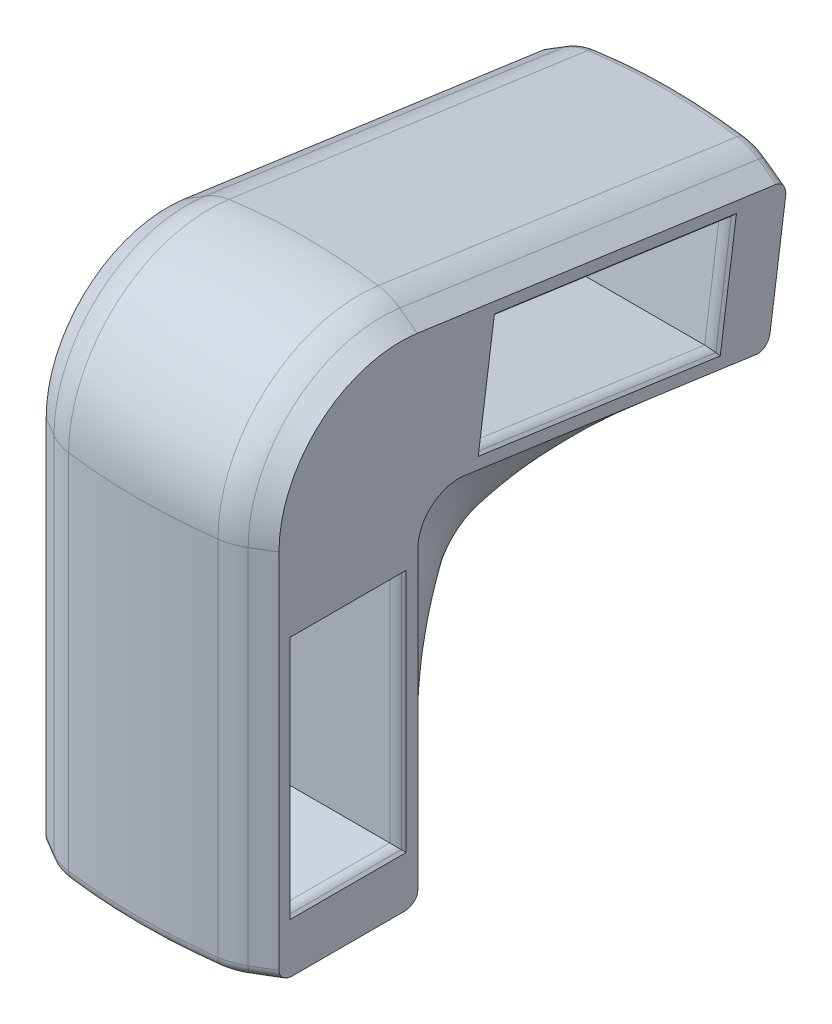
ISO-10303-21;
HEADER;
FILE_DESCRIPTION(('STEP AP214'),'2;1');
FILE_NAME('part.step','',(''),(''),'','','');
FILE_SCHEMA(('AUTOMOTIVE_DESIGN { 1 0 10303 214 1 1 1 1 }'));
ENDSEC;
DATA;
#1=APPLICATION_CONTEXT('core data for automotive mechanical design processes');
#2=APPLICATION_PROTOCOL_DEFINITION('international standard','automotive_design',2000,#1);
#3=PRODUCT_CONTEXT('',#1,'mechanical');
#4=PRODUCT('Part','Part','',(#3));
#5=PRODUCT_RELATED_PRODUCT_CATEGORY('part','',(#4));
#6=PRODUCT_DEFINITION_FORMATION('','',#4);
#7=PRODUCT_DEFINITION_CONTEXT('part definition',#1,'design');
#8=PRODUCT_DEFINITION('design','',#6,#7);
#9=PRODUCT_DEFINITION_SHAPE('','',#8);
#10=(LENGTH_UNIT() NAMED_UNIT(*) SI_UNIT(.MILLI.,.METRE.));
#11=(NAMED_UNIT(*) PLANE_ANGLE_UNIT() SI_UNIT($,.RADIAN.));
#12=(NAMED_UNIT(*) SI_UNIT($,.STERADIAN.) SOLID_ANGLE_UNIT());
#13=UNCERTAINTY_MEASURE_WITH_UNIT(LENGTH_MEASURE(1.E-05),#10,'distance_accuracy_value','');
#14=(GEOMETRIC_REPRESENTATION_CONTEXT(3) GLOBAL_UNCERTAINTY_ASSIGNED_CONTEXT((#13)) GLOBAL_UNIT_ASSIGNED_CONTEXT((#10,
#11,#12)) REPRESENTATION_CONTEXT('',''));
#15=CARTESIAN_POINT('',(0.,0.,0.));
#16=DIRECTION('',(0.,0.,1.));
#17=DIRECTION('',(1.,0.,0.));
#18=AXIS2_PLACEMENT_3D('',#15,#16,#17);
#19=CARTESIAN_POINT('',(567.683533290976,377.4,28.8541260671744));
#20=DIRECTION('',(0.858344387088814,0.,-0.513073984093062));
#21=DIRECTION('',(-0.513073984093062,0.,-0.858344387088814));
#22=AXIS2_PLACEMENT_3D('',#19,#20,#21);
#23=CYLINDRICAL_SURFACE('',#22,2.);
#24=CARTESIAN_POINT('',(600.,377.4,9.53700979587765));
#25=DIRECTION('',(-1.,0.,0.));
#26=DIRECTION('',(0.,0.,-1.));
#27=AXIS2_PLACEMENT_3D('',#24,#25,#26);
#28=ELLIPSE('',#27,2.33006708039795,2.);
#29=CARTESIAN_POINT('',(600.,377.4,11.8670768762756));
#30=VERTEX_POINT('',#29);
#31=CARTESIAN_POINT('',(600.,375.4,9.53700979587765));
#32=VERTEX_POINT('',#31);
#33=EDGE_CURVE('E1285',#30,#32,#28,.F.);
#34=ORIENTED_EDGE('',*,*,#33,.F.);
#35=DIRECTION('',(-0.858344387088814,0.,0.513073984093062));
#36=VECTOR('',#35,1.);
#37=CARTESIAN_POINT('',(600.,377.4,11.8670768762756));
#38=LINE('',#37,#36);
#39=CARTESIAN_POINT('',(596.688557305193,377.4,13.8464864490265));
#40=VERTEX_POINT('',#39);
#41=EDGE_CURVE('E1326',#40,#30,#38,.F.);
#42=ORIENTED_EDGE('',*,*,#41,.F.);
#43=CARTESIAN_POINT('',(595.662409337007,377.4,12.1297976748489));
#44=DIRECTION('',(0.858344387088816,0.,-0.51307398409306));
#45=DIRECTION('',(-0.51307398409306,0.,-0.858344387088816));
#46=AXIS2_PLACEMENT_3D('',#43,#44,#45);
#47=CIRCLE('',#46,2.);
#48=CARTESIAN_POINT('',(595.662409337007,375.4,12.1297976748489));
#49=VERTEX_POINT('',#48);
#50=EDGE_CURVE('E794',#40,#49,#47,.T.);
#51=ORIENTED_EDGE('',*,*,#50,.T.);
#52=DIRECTION('',(0.858344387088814,0.,-0.513073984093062));
#53=VECTOR('',#52,1.);
#54=CARTESIAN_POINT('',(567.683533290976,375.4,28.8541260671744));
#55=LINE('',#54,#53);
#56=EDGE_CURVE('E1312',#32,#49,#55,.F.);
#57=ORIENTED_EDGE('',*,*,#56,.F.);
#58=EDGE_LOOP('',(#34,#42,#51,#57));
#59=FACE_BOUND('',#58,.T.);
#60=ADVANCED_FACE('F49',(#59),#23,.T.);
#61=CARTESIAN_POINT('',(591.557817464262,377.4,5.26304257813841));
#62=DIRECTION('',(0.,-1.,0.));
#63=DIRECTION('',(0.,0.,-1.));
#64=AXIS2_PLACEMENT_3D('',#61,#62,#63);
#65=TOROIDAL_SURFACE('',#64,8.,2.);
#66=CARTESIAN_POINT('',(592.573889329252,377.4,13.1982551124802));
#67=DIRECTION('',(0.991901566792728,0.,-0.127008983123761));
#68=DIRECTION('',(-0.127008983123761,0.,-0.991901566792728));
#69=AXIS2_PLACEMENT_3D('',#66,#67,#68);
#70=CIRCLE('',#69,2.);
#71=CARTESIAN_POINT('',(592.8279072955,377.4,15.1820582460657));
#72=VERTEX_POINT('',#71);
#73=CARTESIAN_POINT('',(592.573889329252,375.4,13.1982551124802));
#74=VERTEX_POINT('',#73);
#75=EDGE_CURVE('E1348',#72,#74,#70,.T.);
#76=ORIENTED_EDGE('',*,*,#75,.T.);
#77=CARTESIAN_POINT('',(591.557817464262,375.4,5.26304257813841));
#78=DIRECTION('',(0.,-1.,0.));
#79=DIRECTION('',(0.,0.,-1.));
#80=AXIS2_PLACEMENT_3D('',#77,#78,#79);
#81=CIRCLE('',#80,8.);
#82=EDGE_CURVE('E1310',#49,#74,#81,.T.);
#83=ORIENTED_EDGE('',*,*,#82,.F.);
#84=ORIENTED_EDGE('',*,*,#50,.F.);
#85=CARTESIAN_POINT('',(591.557817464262,377.4,5.26304257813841));
#86=DIRECTION('',(0.,-1.,0.));
#87=DIRECTION('',(0.,0.,-1.));
#88=AXIS2_PLACEMENT_3D('',#85,#86,#87);
#89=CIRCLE('',#88,10.);
#90=EDGE_CURVE('E1328',#72,#40,#89,.F.);
#91=ORIENTED_EDGE('',*,*,#90,.F.);
#92=EDGE_LOOP('',(#76,#83,#84,#91));
#93=FACE_BOUND('',#92,.T.);
#94=ADVANCED_FACE('F565',(#93),#65,.T.);
#95=CARTESIAN_POINT('',(580.,377.4,-84.9999999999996));
#96=DIRECTION('',(0.,-1.,0.));
#97=DIRECTION('',(0.,0.,-1.));
#98=AXIS2_PLACEMENT_3D('',#95,#96,#97);
#99=TOROIDAL_SURFACE('',#98,98.9999999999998,2.);
#100=CARTESIAN_POINT('',(567.426110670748,377.4,13.1982551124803));
#101=DIRECTION('',(0.991901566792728,0.,0.127008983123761));
#102=DIRECTION('',(0.127008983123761,0.,-0.991901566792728));
#103=AXIS2_PLACEMENT_3D('',#100,#101,#102);
#104=CIRCLE('',#103,2.);
#105=CARTESIAN_POINT('',(567.1720927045,377.4,15.1820582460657));
#106=VERTEX_POINT('',#105);
#107=CARTESIAN_POINT('',(567.426110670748,375.4,13.1982551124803));
#108=VERTEX_POINT('',#107);
#109=EDGE_CURVE('E1351',#106,#108,#104,.T.);
#110=ORIENTED_EDGE('',*,*,#109,.T.);
#111=CARTESIAN_POINT('',(580.,375.4,-84.9999999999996));
#112=DIRECTION('',(0.,-1.,0.));
#113=DIRECTION('',(0.,0.,-1.));
#114=AXIS2_PLACEMENT_3D('',#111,#112,#113);
#115=CIRCLE('',#114,98.9999999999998);
#116=EDGE_CURVE('E1304',#74,#108,#115,.T.);
#117=ORIENTED_EDGE('',*,*,#116,.F.);
#118=ORIENTED_EDGE('',*,*,#75,.F.);
#119=CARTESIAN_POINT('',(580.,377.4,-84.9999999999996));
#120=DIRECTION('',(0.,-1.,0.));
#121=DIRECTION('',(0.,0.,-1.));
#122=AXIS2_PLACEMENT_3D('',#119,#120,#121);
#123=CIRCLE('',#122,101.);
#124=EDGE_CURVE('E1335',#106,#72,#123,.F.);
#125=ORIENTED_EDGE('',*,*,#124,.F.);
#126=EDGE_LOOP('',(#110,#117,#118,#125));
#127=FACE_BOUND('',#126,.T.);
#128=ADVANCED_FACE('F570',(#127),#99,.T.);
#129=CARTESIAN_POINT('',(568.442182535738,377.4,5.26304257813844));
#130=DIRECTION('',(0.,-1.,0.));
#131=DIRECTION('',(0.,0.,-1.));
#132=AXIS2_PLACEMENT_3D('',#129,#130,#131);
#133=TOROIDAL_SURFACE('',#132,8.,2.);
#134=CARTESIAN_POINT('',(564.337590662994,377.4,12.1297976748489));
#135=DIRECTION('',(0.858344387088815,0.,0.51307398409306));
#136=DIRECTION('',(0.51307398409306,0.,-0.858344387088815));
#137=AXIS2_PLACEMENT_3D('',#134,#135,#136);
#138=CIRCLE('',#137,2.);
#139=CARTESIAN_POINT('',(563.311442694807,377.4,13.8464864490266));
#140=VERTEX_POINT('',#139);
#141=CARTESIAN_POINT('',(564.337590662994,375.4,12.129797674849));
#142=VERTEX_POINT('',#141);
#143=EDGE_CURVE('E1354',#140,#142,#138,.T.);
#144=ORIENTED_EDGE('',*,*,#143,.T.);
#145=CARTESIAN_POINT('',(568.442182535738,375.4,5.26304257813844));
#146=DIRECTION('',(0.,-1.,0.));
#147=DIRECTION('',(0.,0.,-1.));
#148=AXIS2_PLACEMENT_3D('',#145,#146,#147);
#149=CIRCLE('',#148,8.);
#150=EDGE_CURVE('E1306',#108,#142,#149,.T.);
#151=ORIENTED_EDGE('',*,*,#150,.F.);
#152=ORIENTED_EDGE('',*,*,#109,.F.);
#153=CARTESIAN_POINT('',(568.442182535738,377.4,5.26304257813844));
#154=DIRECTION('',(0.,-1.,0.));
#155=DIRECTION('',(0.,0.,-1.));
#156=AXIS2_PLACEMENT_3D('',#153,#154,#155);
#157=CIRCLE('',#156,10.);
#158=EDGE_CURVE('E1238',#140,#106,#157,.F.);
#159=ORIENTED_EDGE('',*,*,#158,.F.);
#160=EDGE_LOOP('',(#144,#151,#152,#159));
#161=FACE_BOUND('',#160,.T.);
#162=ADVANCED_FACE('F574',(#161),#133,.T.);
#163=CARTESIAN_POINT('',(562.846263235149,377.4,11.2383590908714));
#164=DIRECTION('',(0.858344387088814,0.,0.513073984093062));
#165=DIRECTION('',(0.513073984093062,0.,-0.858344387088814));
#166=AXIS2_PLACEMENT_3D('',#163,#164,#165);
#167=CYLINDRICAL_SURFACE('',#166,2.);
#168=CARTESIAN_POINT('',(560.,377.4,9.53700979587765));
#169=DIRECTION('',(-1.,0.,0.));
#170=DIRECTION('',(0.,0.,1.));
#171=AXIS2_PLACEMENT_3D('',#168,#169,#170);
#172=ELLIPSE('',#171,2.33006708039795,2.);
#173=CARTESIAN_POINT('',(560.,375.4,9.53700979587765));
#174=VERTEX_POINT('',#173);
#175=CARTESIAN_POINT('',(560.,377.4,11.8670768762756));
#176=VERTEX_POINT('',#175);
#177=EDGE_CURVE('E425',#174,#176,#172,.T.);
#178=ORIENTED_EDGE('',*,*,#177,.F.);
#179=DIRECTION('',(0.858344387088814,0.,0.513073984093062));
#180=VECTOR('',#179,1.);
#181=CARTESIAN_POINT('',(562.846263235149,375.4,11.2383590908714));
#182=LINE('',#181,#180);
#183=EDGE_CURVE('E1308',#142,#174,#182,.F.);
#184=ORIENTED_EDGE('',*,*,#183,.F.);
#185=ORIENTED_EDGE('',*,*,#143,.F.);
#186=DIRECTION('',(-0.858344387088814,0.,-0.513073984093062));
#187=VECTOR('',#186,1.);
#188=CARTESIAN_POINT('',(565.053833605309,377.4,14.8879978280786));
#189=LINE('',#188,#187);
#190=EDGE_CURVE('E1330',#176,#140,#189,.F.);
#191=ORIENTED_EDGE('',*,*,#190,.F.);
#192=EDGE_LOOP('',(#178,#184,#185,#191));
#193=FACE_BOUND('',#192,.T.);
#194=ADVANCED_FACE('F578',(#193),#167,.T.);
#195=CARTESIAN_POINT('',(548.587856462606,377.4,-2.68055619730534));
#196=DIRECTION('',(-0.853358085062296,0.,0.521325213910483));
#197=DIRECTION('',(0.521325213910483,0.,0.853358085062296));
#198=AXIS2_PLACEMENT_3D('',#195,#196,#197);
#199=CYLINDRICAL_SURFACE('',#198,2.);
#200=CARTESIAN_POINT('',(560.,377.4,-9.65235183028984));
#201=DIRECTION('',(-1.,0.,0.));
#202=DIRECTION('',(0.,0.,1.));
#203=AXIS2_PLACEMENT_3D('',#200,#201,#202);
#204=ELLIPSE('',#203,2.34368201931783,2.);
#205=CARTESIAN_POINT('',(560.,377.4,-11.9960338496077));
#206=VERTEX_POINT('',#205);
#207=CARTESIAN_POINT('',(560.,375.4,-9.65235183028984));
#208=VERTEX_POINT('',#207);
#209=EDGE_CURVE('E1298',#206,#208,#204,.T.);
#210=ORIENTED_EDGE('',*,*,#209,.F.);
#211=DIRECTION('',(-0.853358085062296,0.,0.521325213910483));
#212=VECTOR('',#211,1.);
#213=CARTESIAN_POINT('',(560.,377.4,-11.9960338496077));
#214=LINE('',#213,#212);
#215=CARTESIAN_POINT('',(562.871235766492,377.4,-13.7501017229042));
#216=VERTEX_POINT('',#215);
#217=EDGE_CURVE('E1068',#216,#206,#214,.T.);
#218=ORIENTED_EDGE('',*,*,#217,.F.);
#219=CARTESIAN_POINT('',(563.913886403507,377.4,-12.0433852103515));
#220=DIRECTION('',(-0.853358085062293,0.,0.521325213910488));
#221=DIRECTION('',(0.521325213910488,0.,0.853358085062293));
#222=AXIS2_PLACEMENT_3D('',#219,#220,#221);
#223=CIRCLE('',#222,2.);
#224=CARTESIAN_POINT('',(563.913886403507,375.4,-12.0433852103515));
#225=VERTEX_POINT('',#224);
#226=EDGE_CURVE('E1357',#216,#225,#223,.T.);
#227=ORIENTED_EDGE('',*,*,#226,.T.);
#228=DIRECTION('',(-0.853358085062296,0.,0.521325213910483));
#229=VECTOR('',#228,1.);
#230=CARTESIAN_POINT('',(548.587856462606,375.4,-2.68055619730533));
#231=LINE('',#230,#229);
#232=EDGE_CURVE('E1323',#208,#225,#231,.F.);
#233=ORIENTED_EDGE('',*,*,#232,.F.);
#234=EDGE_LOOP('',(#210,#218,#227,#233));
#235=FACE_BOUND('',#234,.T.);
#236=ADVANCED_FACE('F582',(#235),#199,.T.);
#237=CARTESIAN_POINT('',(568.08448811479,377.4,-5.21652052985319));
#238=DIRECTION('',(0.,-1.,0.));
#239=DIRECTION('',(0.,0.,-1.));
#240=AXIS2_PLACEMENT_3D('',#237,#238,#239);
#241=TOROIDAL_SURFACE('',#240,8.,2.);
#242=CARTESIAN_POINT('',(567.03697058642,377.4,-13.1476432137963));
#243=DIRECTION('',(-0.991390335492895,0.,0.130939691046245));
#244=DIRECTION('',(0.130939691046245,0.,0.991390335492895));
#245=AXIS2_PLACEMENT_3D('',#242,#243,#244);
#246=CIRCLE('',#245,2.);
#247=CARTESIAN_POINT('',(566.775091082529,377.4,-15.1304248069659));
#248=VERTEX_POINT('',#247);
#249=CARTESIAN_POINT('',(567.03697058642,375.4,-13.1476432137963));
#250=VERTEX_POINT('',#249);
#251=EDGE_CURVE('E1446',#248,#250,#246,.T.);
#252=ORIENTED_EDGE('',*,*,#251,.T.);
#253=CARTESIAN_POINT('',(568.08448811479,375.4,-5.21652052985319));
#254=DIRECTION('',(0.,-1.,0.));
#255=DIRECTION('',(0.,0.,-1.));
#256=AXIS2_PLACEMENT_3D('',#253,#254,#255);
#257=CIRCLE('',#256,8.);
#258=EDGE_CURVE('E1321',#225,#250,#257,.T.);
#259=ORIENTED_EDGE('',*,*,#258,.F.);
#260=ORIENTED_EDGE('',*,*,#226,.F.);
#261=CARTESIAN_POINT('',(568.08448811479,377.4,-5.21652052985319));
#262=DIRECTION('',(0.,1.,0.));
#263=DIRECTION('',(0.,0.,-1.));
#264=AXIS2_PLACEMENT_3D('',#261,#262,#263);
#265=CIRCLE('',#264,10.);
#266=EDGE_CURVE('E1076',#248,#216,#265,.T.);
#267=ORIENTED_EDGE('',*,*,#266,.F.);
#268=EDGE_LOOP('',(#252,#259,#260,#267));
#269=FACE_BOUND('',#268,.T.);
#270=ADVANCED_FACE('F1443',(#269),#241,.T.);
#271=CARTESIAN_POINT('',(580.,377.4,85.));
#272=DIRECTION('',(0.,-1.,0.));
#273=DIRECTION('',(0.,0.,-1.));
#274=AXIS2_PLACEMENT_3D('',#271,#272,#273);
#275=TOROIDAL_SURFACE('',#274,98.9999999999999,2.);
#276=CARTESIAN_POINT('',(592.96302941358,377.4,-13.1476432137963));
#277=DIRECTION('',(-0.991390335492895,0.,-0.130939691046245));
#278=DIRECTION('',(-0.130939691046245,0.,0.991390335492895));
#279=AXIS2_PLACEMENT_3D('',#276,#277,#278);
#280=CIRCLE('',#279,2.);
#281=CARTESIAN_POINT('',(593.22490891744,377.4,-15.1304248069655));
#282=VERTEX_POINT('',#281);
#283=CARTESIAN_POINT('',(592.96302941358,375.4,-13.1476432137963));
#284=VERTEX_POINT('',#283);
#285=EDGE_CURVE('E1168',#282,#284,#280,.T.);
#286=ORIENTED_EDGE('',*,*,#285,.T.);
#287=CARTESIAN_POINT('',(580.,375.4,85.));
#288=DIRECTION('',(0.,-1.,0.));
#289=DIRECTION('',(0.,0.,-1.));
#290=AXIS2_PLACEMENT_3D('',#287,#288,#289);
#291=CIRCLE('',#290,98.9999999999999);
#292=EDGE_CURVE('E1315',#250,#284,#291,.T.);
#293=ORIENTED_EDGE('',*,*,#292,.F.);
#294=ORIENTED_EDGE('',*,*,#251,.F.);
#295=CARTESIAN_POINT('',(580.,377.4,85.));
#296=DIRECTION('',(0.,-1.,0.));
#297=DIRECTION('',(0.,0.,-1.));
#298=AXIS2_PLACEMENT_3D('',#295,#296,#297);
#299=CIRCLE('',#298,101.);
#300=EDGE_CURVE('E1425',#282,#248,#299,.F.);
#301=ORIENTED_EDGE('',*,*,#300,.F.);
#302=EDGE_LOOP('',(#286,#293,#294,#301));
#303=FACE_BOUND('',#302,.T.);
#304=ADVANCED_FACE('F1484',(#303),#275,.T.);
#305=CARTESIAN_POINT('',(591.915511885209,377.4,-5.21652052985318));
#306=DIRECTION('',(0.,-1.,0.));
#307=DIRECTION('',(0.,0.,-1.));
#308=AXIS2_PLACEMENT_3D('',#305,#306,#307);
#309=TOROIDAL_SURFACE('',#308,8.,2.);
#310=CARTESIAN_POINT('',(596.086113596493,377.4,-12.0433852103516));
#311=DIRECTION('',(-0.853358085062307,0.,-0.521325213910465));
#312=DIRECTION('',(-0.521325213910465,0.,0.853358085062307));
#313=AXIS2_PLACEMENT_3D('',#310,#311,#312);
#314=CIRCLE('',#313,2.);
#315=CARTESIAN_POINT('',(597.128764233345,377.4,-13.7501017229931));
#316=VERTEX_POINT('',#315);
#317=CARTESIAN_POINT('',(596.086113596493,375.4,-12.0433852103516));
#318=VERTEX_POINT('',#317);
#319=EDGE_CURVE('E547',#316,#318,#314,.T.);
#320=ORIENTED_EDGE('',*,*,#319,.T.);
#321=CARTESIAN_POINT('',(591.915511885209,375.4,-5.21652052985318));
#322=DIRECTION('',(0.,-1.,0.));
#323=DIRECTION('',(0.,0.,-1.));
#324=AXIS2_PLACEMENT_3D('',#321,#322,#323);
#325=CIRCLE('',#324,8.);
#326=EDGE_CURVE('E1317',#284,#318,#325,.T.);
#327=ORIENTED_EDGE('',*,*,#326,.F.);
#328=ORIENTED_EDGE('',*,*,#285,.F.);
#329=CARTESIAN_POINT('',(591.915511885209,377.4,-5.21652052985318));
#330=DIRECTION('',(0.,1.,0.));
#331=DIRECTION('',(0.,0.,-1.));
#332=AXIS2_PLACEMENT_3D('',#329,#330,#331);
#333=CIRCLE('',#332,10.);
#334=EDGE_CURVE('E1457',#316,#282,#333,.T.);
#335=ORIENTED_EDGE('',*,*,#334,.F.);
#336=EDGE_LOOP('',(#320,#327,#328,#335));
#337=FACE_BOUND('',#336,.T.);
#338=ADVANCED_FACE('F560',(#337),#309,.T.);
#339=CARTESIAN_POINT('',(582.283342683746,377.4,-20.4756396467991));
#340=DIRECTION('',(-0.853358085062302,0.,-0.521325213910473));
#341=DIRECTION('',(-0.521325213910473,0.,0.853358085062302));
#342=AXIS2_PLACEMENT_3D('',#339,#340,#341);
#343=CYLINDRICAL_SURFACE('',#342,2.);
#344=CARTESIAN_POINT('',(600.,377.4,-9.65235183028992));
#345=DIRECTION('',(-1.,0.,0.));
#346=DIRECTION('',(0.,0.,-1.));
#347=AXIS2_PLACEMENT_3D('',#344,#345,#346);
#348=ELLIPSE('',#347,2.34368201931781,2.);
#349=CARTESIAN_POINT('',(600.,375.4,-9.65235183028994));
#350=VERTEX_POINT('',#349);
#351=CARTESIAN_POINT('',(600.,377.4,-11.9960338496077));
#352=VERTEX_POINT('',#351);
#353=EDGE_CURVE('E1287',#350,#352,#348,.F.);
#354=ORIENTED_EDGE('',*,*,#353,.F.);
#355=DIRECTION('',(-0.853358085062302,0.,-0.521325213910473));
#356=VECTOR('',#355,1.);
#357=CARTESIAN_POINT('',(582.283342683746,375.4,-20.4756396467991));
#358=LINE('',#357,#356);
#359=EDGE_CURVE('E1319',#318,#350,#358,.F.);
#360=ORIENTED_EDGE('',*,*,#359,.F.);
#361=ORIENTED_EDGE('',*,*,#319,.F.);
#362=DIRECTION('',(-0.853358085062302,0.,-0.521325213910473));
#363=VECTOR('',#362,1.);
#364=CARTESIAN_POINT('',(595.371944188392,377.4,-14.8233606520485));
#365=LINE('',#364,#363);
#366=EDGE_CURVE('E541',#352,#316,#365,.T.);
#367=ORIENTED_EDGE('',*,*,#366,.F.);
#368=EDGE_LOOP('',(#354,#360,#361,#367));
#369=FACE_BOUND('',#368,.T.);
#370=ADVANCED_FACE('F549',(#369),#343,.T.);
#371=CARTESIAN_POINT('',(548.587856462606,437.24156366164,-71.5204004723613));
#372=DIRECTION('',(0.853358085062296,-0.516251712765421,0.0725544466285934));
#373=DIRECTION('',(0.517615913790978,0.855613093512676,0.));
#374=AXIS2_PLACEMENT_3D('',#371,#372,#373);
#375=CYLINDRICAL_SURFACE('',#374,2.);
#376=CARTESIAN_POINT('',(563.913886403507,427.969853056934,-70.2173465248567));
#377=DIRECTION('',(-0.853358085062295,0.516251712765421,-0.0725544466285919));
#378=DIRECTION('',(-0.517615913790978,-0.855613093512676,0.));
#379=AXIS2_PLACEMENT_3D('',#376,#377,#378);
#380=CIRCLE('',#379,2.);
#381=CARTESIAN_POINT('',(563.913886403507,427.691506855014,-72.1978826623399));
#382=VERTEX_POINT('',#381);
#383=CARTESIAN_POINT('',(562.871235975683,426.279746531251,-69.9798175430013));
#384=VERTEX_POINT('',#383);
#385=EDGE_CURVE('E1157',#382,#384,#380,.T.);
#386=ORIENTED_EDGE('',*,*,#385,.T.);
#387=DIRECTION('',(-0.853358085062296,0.516251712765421,-0.0725544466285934));
#388=VECTOR('',#387,1.);
#389=CARTESIAN_POINT('',(564.628055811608,425.216932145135,-69.8304487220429));
#390=LINE('',#389,#388);
#391=CARTESIAN_POINT('',(560.,428.01674359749,-70.2239365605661));
#392=VERTEX_POINT('',#391);
#393=EDGE_CURVE('E1202',#384,#392,#390,.T.);
#394=ORIENTED_EDGE('',*,*,#393,.T.);
#395=CARTESIAN_POINT('',(560.,430.337617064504,-70.550114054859));
#396=DIRECTION('',(-1.,0.,0.));
#397=DIRECTION('',(0.,-0.99026806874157,0.139173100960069));
#398=AXIS2_PLACEMENT_3D('',#395,#396,#397);
#399=ELLIPSE('',#398,2.34368201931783,2.);
#400=CARTESIAN_POINT('',(560.,430.059270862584,-72.5306501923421));
#401=VERTEX_POINT('',#400);
#402=EDGE_CURVE('E1302',#401,#392,#399,.T.);
#403=ORIENTED_EDGE('',*,*,#402,.F.);
#404=DIRECTION('',(0.853358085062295,-0.516251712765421,0.0725544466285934));
#405=VECTOR('',#404,1.);
#406=CARTESIAN_POINT('',(548.587856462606,436.96321745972,-73.5009366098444));
#407=LINE('',#406,#405);
#408=EDGE_CURVE('E1271',#382,#401,#407,.F.);
#409=ORIENTED_EDGE('',*,*,#408,.F.);
#410=EDGE_LOOP('',(#386,#394,#403,#409));
#411=FACE_BOUND('',#410,.T.);
#412=ADVANCED_FACE('F559',(#411),#375,.T.);
#413=CARTESIAN_POINT('',(568.084488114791,434.730279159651,-71.1674624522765));
#414=DIRECTION('',(0.,-0.139173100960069,-0.99026806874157));
#415=DIRECTION('',(0.,0.99026806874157,-0.139173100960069));
#416=AXIS2_PLACEMENT_3D('',#413,#414,#415);
#417=TOROIDAL_SURFACE('',#416,8.,2.);
#418=CARTESIAN_POINT('',(567.036970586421,426.87634161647,-70.0636635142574));
#419=DIRECTION('',(-0.991390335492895,0.12966539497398,-0.0182232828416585));
#420=DIRECTION('',(-0.129686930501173,-0.991554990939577,0.));
#421=AXIS2_PLACEMENT_3D('',#418,#419,#420);
#422=CIRCLE('',#421,2.);
#423=CARTESIAN_POINT('',(567.036970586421,426.59799541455,-72.0441996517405));
#424=VERTEX_POINT('',#423);
#425=CARTESIAN_POINT('',(566.775091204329,424.912857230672,-69.7877137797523));
#426=VERTEX_POINT('',#425);
#427=EDGE_CURVE('E1117',#424,#426,#422,.T.);
#428=ORIENTED_EDGE('',*,*,#427,.T.);
#429=CARTESIAN_POINT('',(568.084488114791,434.730279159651,-71.1674624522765));
#430=DIRECTION('',(0.,-0.139173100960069,-0.99026806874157));
#431=DIRECTION('',(0.,0.99026806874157,-0.139173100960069));
#432=AXIS2_PLACEMENT_3D('',#429,#430,#431);
#433=CIRCLE('',#432,10.);
#434=EDGE_CURVE('E1179',#426,#384,#433,.T.);
#435=ORIENTED_EDGE('',*,*,#434,.T.);
#436=ORIENTED_EDGE('',*,*,#385,.F.);
#437=CARTESIAN_POINT('',(568.084488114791,434.451932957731,-73.1479985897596));
#438=DIRECTION('',(0.,-0.139173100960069,-0.99026806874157));
#439=DIRECTION('',(0.,0.99026806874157,-0.139173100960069));
#440=AXIS2_PLACEMENT_3D('',#437,#438,#439);
#441=CIRCLE('',#440,8.);
#442=EDGE_CURVE('E1269',#424,#382,#441,.T.);
#443=ORIENTED_EDGE('',*,*,#442,.F.);
#444=EDGE_LOOP('',(#428,#435,#436,#443));
#445=FACE_BOUND('',#444,.T.);
#446=ADVANCED_FACE('F1130',(#445),#417,.T.);
#447=CARTESIAN_POINT('',(580.,524.068818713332,-83.7231753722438));
#448=DIRECTION('',(0.,-0.139173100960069,-0.99026806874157));
#449=DIRECTION('',(0.,0.99026806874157,-0.139173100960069));
#450=AXIS2_PLACEMENT_3D('',#447,#448,#449);
#451=TOROIDAL_SURFACE('',#450,98.9999999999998,2.);
#452=CARTESIAN_POINT('',(592.96302941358,426.87634161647,-70.0636635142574));
#453=DIRECTION('',(-0.991390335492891,-0.129665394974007,0.0182232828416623));
#454=DIRECTION('',(0.1296869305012,-0.991554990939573,0.));
#455=AXIS2_PLACEMENT_3D('',#452,#453,#454);
#456=CIRCLE('',#455,2.);
#457=CARTESIAN_POINT('',(592.96302941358,426.59799541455,-72.0441996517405));
#458=VERTEX_POINT('',#457);
#459=CARTESIAN_POINT('',(593.224908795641,424.912857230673,-69.7877137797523));
#460=VERTEX_POINT('',#459);
#461=EDGE_CURVE('E1145',#458,#460,#456,.T.);
#462=ORIENTED_EDGE('',*,*,#461,.T.);
#463=CARTESIAN_POINT('',(580.,524.068818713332,-83.7231753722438));
#464=DIRECTION('',(0.,-0.139173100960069,-0.99026806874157));
#465=DIRECTION('',(0.,0.99026806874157,-0.139173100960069));
#466=AXIS2_PLACEMENT_3D('',#463,#464,#465);
#467=CIRCLE('',#466,101.);
#468=EDGE_CURVE('E1111',#460,#426,#467,.T.);
#469=ORIENTED_EDGE('',*,*,#468,.T.);
#470=ORIENTED_EDGE('',*,*,#427,.F.);
#471=CARTESIAN_POINT('',(580.,523.790472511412,-85.703711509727));
#472=DIRECTION('',(0.,-0.139173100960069,-0.99026806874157));
#473=DIRECTION('',(0.,0.99026806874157,-0.139173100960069));
#474=AXIS2_PLACEMENT_3D('',#471,#472,#473);
#475=CIRCLE('',#474,98.9999999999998);
#476=EDGE_CURVE('E1262',#458,#424,#475,.T.);
#477=ORIENTED_EDGE('',*,*,#476,.F.);
#478=EDGE_LOOP('',(#462,#469,#470,#477));
#479=FACE_BOUND('',#478,.T.);
#480=ADVANCED_FACE('F1119',(#479),#451,.T.);
#481=CARTESIAN_POINT('',(591.91551188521,434.730279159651,-71.1674624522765));
#482=DIRECTION('',(0.,-0.139173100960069,-0.99026806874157));
#483=DIRECTION('',(0.,0.99026806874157,-0.139173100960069));
#484=AXIS2_PLACEMENT_3D('',#481,#482,#483);
#485=TOROIDAL_SURFACE('',#484,8.,2.);
#486=CARTESIAN_POINT('',(596.086113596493,427.969853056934,-70.2173465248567));
#487=DIRECTION('',(-0.8533580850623,-0.516251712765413,0.0725544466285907));
#488=DIRECTION('',(0.51761591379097,-0.85561309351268,0.));
#489=AXIS2_PLACEMENT_3D('',#486,#487,#488);
#490=CIRCLE('',#489,2.);
#491=CARTESIAN_POINT('',(596.086113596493,427.691506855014,-72.1978826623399));
#492=VERTEX_POINT('',#491);
#493=CARTESIAN_POINT('',(597.128764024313,426.279746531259,-69.9798175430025));
#494=VERTEX_POINT('',#493);
#495=EDGE_CURVE('E1151',#492,#494,#490,.T.);
#496=ORIENTED_EDGE('',*,*,#495,.T.);
#497=CARTESIAN_POINT('',(591.91551188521,434.730279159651,-71.1674624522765));
#498=DIRECTION('',(0.,-0.139173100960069,-0.99026806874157));
#499=DIRECTION('',(0.,0.99026806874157,-0.139173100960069));
#500=AXIS2_PLACEMENT_3D('',#497,#498,#499);
#501=CIRCLE('',#500,10.);
#502=EDGE_CURVE('E1103',#494,#460,#501,.T.);
#503=ORIENTED_EDGE('',*,*,#502,.T.);
#504=ORIENTED_EDGE('',*,*,#461,.F.);
#505=CARTESIAN_POINT('',(591.91551188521,434.451932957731,-73.1479985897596));
#506=DIRECTION('',(0.,-0.139173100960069,-0.99026806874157));
#507=DIRECTION('',(0.,0.99026806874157,-0.139173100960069));
#508=AXIS2_PLACEMENT_3D('',#505,#506,#507);
#509=CIRCLE('',#508,8.);
#510=EDGE_CURVE('E1264',#492,#458,#509,.T.);
#511=ORIENTED_EDGE('',*,*,#510,.F.);
#512=EDGE_LOOP('',(#496,#503,#504,#511));
#513=FACE_BOUND('',#512,.T.);
#514=ADVANCED_FACE('F1129',(#513),#485,.T.);
#515=CARTESIAN_POINT('',(582.283342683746,419.619660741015,-69.043803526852));
#516=DIRECTION('',(0.853358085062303,0.516251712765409,-0.0725544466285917));
#517=DIRECTION('',(-0.517615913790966,0.855613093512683,0.));
#518=AXIS2_PLACEMENT_3D('',#515,#516,#517);
#519=CYLINDRICAL_SURFACE('',#518,2.);
#520=CARTESIAN_POINT('',(600.,430.337617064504,-70.5501140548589));
#521=DIRECTION('',(-1.,0.,0.));
#522=DIRECTION('',(0.,0.99026806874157,-0.139173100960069));
#523=AXIS2_PLACEMENT_3D('',#520,#521,#522);
#524=ELLIPSE('',#523,2.34368201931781,2.);
#525=CARTESIAN_POINT('',(600.,428.01674359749,-70.2239365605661));
#526=VERTEX_POINT('',#525);
#527=CARTESIAN_POINT('',(600.,430.059270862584,-72.5306501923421));
#528=VERTEX_POINT('',#527);
#529=EDGE_CURVE('E1291',#526,#528,#524,.F.);
#530=ORIENTED_EDGE('',*,*,#529,.F.);
#531=DIRECTION('',(-0.853358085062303,-0.516251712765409,0.0725544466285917));
#532=VECTOR('',#531,1.);
#533=CARTESIAN_POINT('',(600.,428.01674359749,-70.2239365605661));
#534=LINE('',#533,#532);
#535=EDGE_CURVE('E1077',#526,#494,#534,.T.);
#536=ORIENTED_EDGE('',*,*,#535,.T.);
#537=ORIENTED_EDGE('',*,*,#495,.F.);
#538=DIRECTION('',(0.853358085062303,0.516251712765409,-0.0725544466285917));
#539=VECTOR('',#538,1.);
#540=CARTESIAN_POINT('',(582.283342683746,419.341314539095,-71.0243396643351));
#541=LINE('',#540,#539);
#542=EDGE_CURVE('E1267',#528,#492,#541,.F.);
#543=ORIENTED_EDGE('',*,*,#542,.F.);
#544=EDGE_LOOP('',(#530,#536,#537,#543));
#545=FACE_BOUND('',#544,.T.);
#546=ADVANCED_FACE('F1136',(#545),#519,.T.);
#547=CARTESIAN_POINT('',(567.683533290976,468.469352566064,-75.9091799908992));
#548=DIRECTION('',(-0.85834438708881,0.508080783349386,-0.0714060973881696));
#549=DIRECTION('',(-0.509381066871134,-0.860541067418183,0.));
#550=AXIS2_PLACEMENT_3D('',#547,#548,#549);
#551=CYLINDRICAL_SURFACE('',#550,2.);
#552=CARTESIAN_POINT('',(595.662409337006,451.907784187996,-73.5816033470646));
#553=DIRECTION('',(0.858344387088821,-0.508080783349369,0.0714060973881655));
#554=DIRECTION('',(0.509381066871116,0.860541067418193,0.));
#555=AXIS2_PLACEMENT_3D('',#552,#553,#554);
#556=CIRCLE('',#555,2.);
#557=CARTESIAN_POINT('',(595.662409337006,451.629437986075,-75.5621394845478));
#558=VERTEX_POINT('',#557);
#559=CARTESIAN_POINT('',(596.688557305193,453.607766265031,-73.8205202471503));
#560=VERTEX_POINT('',#559);
#561=EDGE_CURVE('E1155',#558,#560,#556,.T.);
#562=ORIENTED_EDGE('',*,*,#561,.T.);
#563=DIRECTION('',(0.85834438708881,-0.508080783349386,0.0714060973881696));
#564=VECTOR('',#563,1.);
#565=CARTESIAN_POINT('',(600.,451.647620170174,-73.5450396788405));
#566=LINE('',#565,#564);
#567=CARTESIAN_POINT('',(600.,451.647620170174,-73.5450396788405));
#568=VERTEX_POINT('',#567);
#569=EDGE_CURVE('E1290',#568,#560,#566,.F.);
#570=ORIENTED_EDGE('',*,*,#569,.F.);
#571=CARTESIAN_POINT('',(600.,449.34022914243,-73.2207570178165));
#572=DIRECTION('',(-1.,0.,0.));
#573=DIRECTION('',(0.,0.99026806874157,-0.139173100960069));
#574=AXIS2_PLACEMENT_3D('',#571,#572,#573);
#575=ELLIPSE('',#574,2.33006708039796,2.);
#576=CARTESIAN_POINT('',(600.,449.06188294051,-75.2012931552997));
#577=VERTEX_POINT('',#576);
#578=EDGE_CURVE('E1288',#577,#568,#575,.F.);
#579=ORIENTED_EDGE('',*,*,#578,.F.);
#580=DIRECTION('',(-0.85834438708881,0.508080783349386,-0.0714060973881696));
#581=VECTOR('',#580,1.);
#582=CARTESIAN_POINT('',(567.683533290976,468.191006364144,-77.8897161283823));
#583=LINE('',#582,#581);
#584=EDGE_CURVE('E1282',#558,#577,#583,.F.);
#585=ORIENTED_EDGE('',*,*,#584,.F.);
#586=EDGE_LOOP('',(#562,#570,#579,#585));
#587=FACE_BOUND('',#586,.T.);
#588=ADVANCED_FACE('F1531',(#587),#551,.T.);
#589=CARTESIAN_POINT('',(591.557817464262,445.107855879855,-72.6259357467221));
#590=DIRECTION('',(0.,-0.139173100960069,-0.99026806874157));
#591=DIRECTION('',(0.,0.99026806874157,-0.139173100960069));
#592=AXIS2_PLACEMENT_3D('',#589,#590,#591);
#593=TOROIDAL_SURFACE('',#592,8.,2.);
#594=CARTESIAN_POINT('',(592.573889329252,452.965843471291,-73.7303038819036));
#595=DIRECTION('',(0.991901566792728,-0.125772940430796,0.0176762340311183));
#596=DIRECTION('',(0.125792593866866,0.992056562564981,0.));
#597=AXIS2_PLACEMENT_3D('',#594,#595,#596);
#598=CIRCLE('',#597,2.);
#599=CARTESIAN_POINT('',(592.573889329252,452.687497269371,-75.7108400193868));
#600=VERTEX_POINT('',#599);
#601=CARTESIAN_POINT('',(592.827907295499,454.930340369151,-74.006395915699));
#602=VERTEX_POINT('',#601);
#603=EDGE_CURVE('E1339',#600,#602,#598,.T.);
#604=ORIENTED_EDGE('',*,*,#603,.T.);
#605=CARTESIAN_POINT('',(591.557817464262,445.107855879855,-72.6259357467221));
#606=DIRECTION('',(0.,-0.139173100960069,-0.99026806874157));
#607=DIRECTION('',(0.,0.99026806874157,-0.139173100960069));
#608=AXIS2_PLACEMENT_3D('',#605,#606,#607);
#609=CIRCLE('',#608,10.);
#610=EDGE_CURVE('E1293',#560,#602,#609,.F.);
#611=ORIENTED_EDGE('',*,*,#610,.F.);
#612=ORIENTED_EDGE('',*,*,#561,.F.);
#613=CARTESIAN_POINT('',(591.557817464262,444.829509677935,-74.6064718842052));
#614=DIRECTION('',(0.,-0.139173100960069,-0.99026806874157));
#615=DIRECTION('',(0.,0.99026806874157,-0.139173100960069));
#616=AXIS2_PLACEMENT_3D('',#613,#614,#615);
#617=CIRCLE('',#616,8.);
#618=EDGE_CURVE('E1280',#600,#558,#617,.T.);
#619=ORIENTED_EDGE('',*,*,#618,.F.);
#620=EDGE_LOOP('',(#604,#611,#612,#619));
#621=FACE_BOUND('',#620,.T.);
#622=ADVANCED_FACE('F1527',(#621),#593,.T.);
#623=CARTESIAN_POINT('',(580.,355.723247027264,-60.0637482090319));
#624=DIRECTION('',(0.,-0.139173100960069,-0.99026806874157));
#625=DIRECTION('',(0.,0.99026806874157,-0.139173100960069));
#626=AXIS2_PLACEMENT_3D('',#623,#624,#625);
#627=TOROIDAL_SURFACE('',#626,98.9999999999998,2.);
#628=CARTESIAN_POINT('',(567.426110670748,452.965843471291,-73.7303038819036));
#629=DIRECTION('',(0.991901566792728,0.125772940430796,-0.0176762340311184));
#630=DIRECTION('',(-0.125792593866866,0.992056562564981,0.));
#631=AXIS2_PLACEMENT_3D('',#628,#629,#630);
#632=CIRCLE('',#631,2.);
#633=CARTESIAN_POINT('',(567.426110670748,452.687497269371,-75.7108400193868));
#634=VERTEX_POINT('',#633);
#635=CARTESIAN_POINT('',(567.1720927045,454.93034036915,-74.006395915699));
#636=VERTEX_POINT('',#635);
#637=EDGE_CURVE('E1342',#634,#636,#632,.T.);
#638=ORIENTED_EDGE('',*,*,#637,.T.);
#639=CARTESIAN_POINT('',(580.,355.723247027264,-60.0637482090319));
#640=DIRECTION('',(0.,-0.139173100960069,-0.99026806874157));
#641=DIRECTION('',(0.,0.99026806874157,-0.139173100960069));
#642=AXIS2_PLACEMENT_3D('',#639,#640,#641);
#643=CIRCLE('',#642,101.);
#644=EDGE_CURVE('E1333',#602,#636,#643,.F.);
#645=ORIENTED_EDGE('',*,*,#644,.F.);
#646=ORIENTED_EDGE('',*,*,#603,.F.);
#647=CARTESIAN_POINT('',(580.,355.444900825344,-62.044284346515));
#648=DIRECTION('',(0.,-0.139173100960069,-0.99026806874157));
#649=DIRECTION('',(0.,0.99026806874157,-0.139173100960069));
#650=AXIS2_PLACEMENT_3D('',#647,#648,#649);
#651=CIRCLE('',#650,98.9999999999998);
#652=EDGE_CURVE('E1274',#634,#600,#651,.T.);
#653=ORIENTED_EDGE('',*,*,#652,.F.);
#654=EDGE_LOOP('',(#638,#645,#646,#653));
#655=FACE_BOUND('',#654,.T.);
#656=ADVANCED_FACE('F1523',(#655),#627,.T.);
#657=CARTESIAN_POINT('',(568.442182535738,445.107855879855,-72.6259357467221));
#658=DIRECTION('',(0.,-0.139173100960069,-0.99026806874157));
#659=DIRECTION('',(0.,0.99026806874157,-0.139173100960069));
#660=AXIS2_PLACEMENT_3D('',#657,#658,#659);
#661=TOROIDAL_SURFACE('',#660,8.,2.);
#662=CARTESIAN_POINT('',(564.337590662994,451.907784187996,-73.5816033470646));
#663=DIRECTION('',(0.858344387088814,0.508080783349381,-0.0714060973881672));
#664=DIRECTION('',(-0.509381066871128,0.860541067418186,0.));
#665=AXIS2_PLACEMENT_3D('',#662,#663,#664);
#666=CIRCLE('',#665,2.);
#667=CARTESIAN_POINT('',(564.337590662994,451.629437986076,-75.5621394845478));
#668=VERTEX_POINT('',#667);
#669=CARTESIAN_POINT('',(563.311442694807,453.607766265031,-73.8205202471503));
#670=VERTEX_POINT('',#669);
#671=EDGE_CURVE('E1259',#668,#670,#666,.T.);
#672=ORIENTED_EDGE('',*,*,#671,.T.);
#673=CARTESIAN_POINT('',(568.442182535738,445.107855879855,-72.6259357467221));
#674=DIRECTION('',(0.,-0.139173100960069,-0.99026806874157));
#675=DIRECTION('',(0.,0.99026806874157,-0.139173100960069));
#676=AXIS2_PLACEMENT_3D('',#673,#674,#675);
#677=CIRCLE('',#676,10.);
#678=EDGE_CURVE('E1301',#636,#670,#677,.F.);
#679=ORIENTED_EDGE('',*,*,#678,.F.);
#680=ORIENTED_EDGE('',*,*,#637,.F.);
#681=CARTESIAN_POINT('',(568.442182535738,444.829509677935,-74.6064718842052));
#682=DIRECTION('',(0.,-0.139173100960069,-0.99026806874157));
#683=DIRECTION('',(0.,0.99026806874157,-0.139173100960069));
#684=AXIS2_PLACEMENT_3D('',#681,#682,#683);
#685=CIRCLE('',#684,8.);
#686=EDGE_CURVE('E1276',#668,#634,#685,.T.);
#687=ORIENTED_EDGE('',*,*,#686,.F.);
#688=EDGE_LOOP('',(#672,#679,#680,#687));
#689=FACE_BOUND('',#688,.T.);
#690=ADVANCED_FACE('F1519',(#689),#661,.T.);
#691=CARTESIAN_POINT('',(562.84626323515,451.025021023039,-73.4575390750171));
#692=DIRECTION('',(-0.858344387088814,-0.50808078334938,0.0714060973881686));
#693=DIRECTION('',(0.509381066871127,-0.860541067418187,0.));
#694=AXIS2_PLACEMENT_3D('',#691,#692,#693);
#695=CYLINDRICAL_SURFACE('',#694,2.);
#696=CARTESIAN_POINT('',(560.,449.34022914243,-73.2207570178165));
#697=DIRECTION('',(-1.,0.,0.));
#698=DIRECTION('',(0.,-0.99026806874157,0.139173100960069));
#699=AXIS2_PLACEMENT_3D('',#696,#697,#698);
#700=ELLIPSE('',#699,2.33006708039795,2.);
#701=CARTESIAN_POINT('',(560.,451.647620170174,-73.5450396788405));
#702=VERTEX_POINT('',#701);
#703=CARTESIAN_POINT('',(560.,449.06188294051,-75.2012931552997));
#704=VERTEX_POINT('',#703);
#705=EDGE_CURVE('E1299',#702,#704,#700,.T.);
#706=ORIENTED_EDGE('',*,*,#705,.F.);
#707=DIRECTION('',(0.858344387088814,0.50808078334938,-0.0714060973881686));
#708=VECTOR('',#707,1.);
#709=CARTESIAN_POINT('',(565.053833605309,454.639141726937,-73.9654706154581));
#710=LINE('',#709,#708);
#711=EDGE_CURVE('E1295',#670,#702,#710,.F.);
#712=ORIENTED_EDGE('',*,*,#711,.F.);
#713=ORIENTED_EDGE('',*,*,#671,.F.);
#714=DIRECTION('',(-0.858344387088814,-0.50808078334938,0.0714060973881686));
#715=VECTOR('',#714,1.);
#716=CARTESIAN_POINT('',(562.84626323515,450.746674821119,-75.4380752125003));
#717=LINE('',#716,#715);
#718=EDGE_CURVE('E1278',#704,#668,#717,.F.);
#719=ORIENTED_EDGE('',*,*,#718,.F.);
#720=EDGE_LOOP('',(#706,#712,#713,#719));
#721=FACE_BOUND('',#720,.T.);
#722=ADVANCED_FACE('F1515',(#721),#695,.T.);
#723=CARTESIAN_POINT('',(591.557817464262,439.646684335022,5.26304257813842));
#724=DIRECTION('',(0.,-1.,0.));
#725=DIRECTION('',(0.,0.,-1.));
#726=AXIS2_PLACEMENT_3D('',#723,#724,#725);
#727=CYLINDRICAL_SURFACE('',#726,10.);
#728=DIRECTION('',(0.,-1.,0.));
#729=VECTOR('',#728,1.);
#730=CARTESIAN_POINT('',(592.8279072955,439.646684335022,15.1820582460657));
#731=LINE('',#730,#729);
#732=CARTESIAN_POINT('',(592.8279072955,439.646684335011,15.1820582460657));
#733=VERTEX_POINT('',#732);
#734=EDGE_CURVE('E1230',#72,#733,#731,.F.);
#735=ORIENTED_EDGE('',*,*,#734,.F.);
#736=ORIENTED_EDGE('',*,*,#90,.T.);
#737=DIRECTION('',(0.,1.,0.));
#738=VECTOR('',#737,1.);
#739=CARTESIAN_POINT('',(596.688557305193,439.646684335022,13.8464864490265));
#740=LINE('',#739,#738);
#741=CARTESIAN_POINT('',(596.688557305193,439.646684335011,13.8464864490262));
#742=VERTEX_POINT('',#741);
#743=EDGE_CURVE('E1578',#742,#40,#740,.F.);
#744=ORIENTED_EDGE('',*,*,#743,.F.);
#745=CARTESIAN_POINT('',(591.557817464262,439.646684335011,5.2630425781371));
#746=DIRECTION('',(0.,-1.,0.));
#747=DIRECTION('',(0.,0.,-1.));
#748=AXIS2_PLACEMENT_3D('',#745,#746,#747);
#749=CIRCLE('',#748,10.);
#750=EDGE_CURVE('E1257',#742,#733,#749,.T.);
#751=ORIENTED_EDGE('',*,*,#750,.T.);
#752=EDGE_LOOP('',(#735,#736,#744,#751));
#753=FACE_BOUND('',#752,.T.);
#754=ADVANCED_FACE('F1518',(#753),#727,.T.);
#755=CARTESIAN_POINT('',(591.557817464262,439.646684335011,-8.99999999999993));
#756=DIRECTION('',(1.,0.,0.));
#757=DIRECTION('',(0.,0.,-1.));
#758=AXIS2_PLACEMENT_3D('',#755,#756,#757);
#759=TOROIDAL_SURFACE('',#758,14.263042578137,10.);
#760=CARTESIAN_POINT('',(591.557817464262,453.770919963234,-10.9850318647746));
#761=DIRECTION('',(0.,0.139173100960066,0.99026806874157));
#762=DIRECTION('',(0.,-0.99026806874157,0.139173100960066));
#763=AXIS2_PLACEMENT_3D('',#760,#761,#762);
#764=CIRCLE('',#763,10.);
#765=CARTESIAN_POINT('',(596.688557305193,462.270830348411,-12.1796163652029));
#766=VERTEX_POINT('',#765);
#767=CARTESIAN_POINT('',(592.8279072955,463.59340445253,-12.3654920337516));
#768=VERTEX_POINT('',#767);
#769=EDGE_CURVE('E1253',#766,#768,#764,.T.);
#770=ORIENTED_EDGE('',*,*,#769,.T.);
#771=CARTESIAN_POINT('',(592.8279072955,439.646684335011,-8.99999999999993));
#772=DIRECTION('',(-1.,0.,0.));
#773=DIRECTION('',(0.,0.,1.));
#774=AXIS2_PLACEMENT_3D('',#771,#772,#773);
#775=CIRCLE('',#774,24.1820582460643);
#776=EDGE_CURVE('E1586',#733,#768,#775,.T.);
#777=ORIENTED_EDGE('',*,*,#776,.F.);
#778=ORIENTED_EDGE('',*,*,#750,.F.);
#779=CARTESIAN_POINT('',(596.688557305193,439.646684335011,-8.99999999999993));
#780=DIRECTION('',(1.,0.,0.));
#781=DIRECTION('',(0.,0.,-1.));
#782=AXIS2_PLACEMENT_3D('',#779,#780,#781);
#783=CIRCLE('',#782,22.8464864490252);
#784=EDGE_CURVE('E1265',#766,#742,#783,.T.);
#785=ORIENTED_EDGE('',*,*,#784,.F.);
#786=EDGE_LOOP('',(#770,#777,#778,#785));
#787=FACE_BOUND('',#786,.T.);
#788=ADVANCED_FACE('F1540',(#787),#759,.T.);
#789=CARTESIAN_POINT('',(591.557817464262,444.690336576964,-75.5967399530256));
#790=DIRECTION('',(0.,0.139173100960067,0.99026806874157));
#791=DIRECTION('',(0.,-0.99026806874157,0.139173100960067));
#792=AXIS2_PLACEMENT_3D('',#789,#790,#791);
#793=CYLINDRICAL_SURFACE('',#792,10.);
#794=DIRECTION('',(0.,-0.139173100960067,-0.99026806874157));
#795=VECTOR('',#794,1.);
#796=CARTESIAN_POINT('',(596.688557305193,453.19024696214,-76.7913244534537));
#797=LINE('',#796,#795);
#798=EDGE_CURVE('E1581',#560,#766,#797,.F.);
#799=ORIENTED_EDGE('',*,*,#798,.F.);
#800=ORIENTED_EDGE('',*,*,#610,.T.);
#801=DIRECTION('',(0.,0.139173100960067,0.99026806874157));
#802=VECTOR('',#801,1.);
#803=CARTESIAN_POINT('',(592.827907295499,454.512821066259,-76.9772001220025));
#804=LINE('',#803,#802);
#805=EDGE_CURVE('E1608',#768,#602,#804,.F.);
#806=ORIENTED_EDGE('',*,*,#805,.F.);
#807=ORIENTED_EDGE('',*,*,#769,.F.);
#808=EDGE_LOOP('',(#799,#800,#806,#807));
#809=FACE_BOUND('',#808,.T.);
#810=ADVANCED_FACE('F1536',(#809),#793,.T.);
#811=CARTESIAN_POINT('',(568.442182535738,444.690336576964,-75.5967399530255));
#812=DIRECTION('',(0.,0.139173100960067,0.99026806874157));
#813=DIRECTION('',(0.,-0.99026806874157,0.139173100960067));
#814=AXIS2_PLACEMENT_3D('',#811,#812,#813);
#815=CYLINDRICAL_SURFACE('',#814,10.);
#816=DIRECTION('',(0.,0.139173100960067,0.99026806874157));
#817=VECTOR('',#816,1.);
#818=CARTESIAN_POINT('',(567.1720927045,454.512821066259,-76.9772001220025));
#819=LINE('',#818,#817);
#820=CARTESIAN_POINT('',(567.1720927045,463.59340445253,-12.3654920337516));
#821=VERTEX_POINT('',#820);
#822=EDGE_CURVE('E1611',#636,#821,#819,.T.);
#823=ORIENTED_EDGE('',*,*,#822,.F.);
#824=ORIENTED_EDGE('',*,*,#678,.T.);
#825=DIRECTION('',(0.,-0.139173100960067,-0.99026806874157));
#826=VECTOR('',#825,1.);
#827=CARTESIAN_POINT('',(563.311442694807,453.19024696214,-76.7913244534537));
#828=LINE('',#827,#826);
#829=CARTESIAN_POINT('',(563.311442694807,462.270830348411,-12.1796163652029));
#830=VERTEX_POINT('',#829);
#831=EDGE_CURVE('E1616',#830,#670,#828,.T.);
#832=ORIENTED_EDGE('',*,*,#831,.F.);
#833=CARTESIAN_POINT('',(568.442182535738,453.770919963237,-10.9850318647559));
#834=DIRECTION('',(6.32338847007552E-13,-0.139173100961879,-0.990268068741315));
#835=DIRECTION('',(0.,0.990268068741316,-0.139173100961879));
#836=AXIS2_PLACEMENT_3D('',#833,#834,#835);
#837=CIRCLE('',#836,10.);
#838=EDGE_CURVE('E1247',#830,#821,#837,.T.);
#839=ORIENTED_EDGE('',*,*,#838,.T.);
#840=EDGE_LOOP('',(#823,#824,#832,#839));
#841=FACE_BOUND('',#840,.T.);
#842=ADVANCED_FACE('F1539',(#841),#815,.T.);
#843=CARTESIAN_POINT('',(568.442182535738,439.646684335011,-8.99999999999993));
#844=DIRECTION('',(-1.,0.,0.));
#845=DIRECTION('',(0.,0.,1.));
#846=AXIS2_PLACEMENT_3D('',#843,#844,#845);
#847=TOROIDAL_SURFACE('',#846,14.263042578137,10.);
#848=CARTESIAN_POINT('',(568.442182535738,439.646684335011,5.26304257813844));
#849=DIRECTION('',(0.,1.,0.));
#850=DIRECTION('',(-1.,0.,0.));
#851=AXIS2_PLACEMENT_3D('',#848,#849,#850);
#852=CIRCLE('',#851,10.);
#853=CARTESIAN_POINT('',(563.311442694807,439.646684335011,13.8464864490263));
#854=VERTEX_POINT('',#853);
#855=CARTESIAN_POINT('',(567.1720927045,439.646684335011,15.1820582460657));
#856=VERTEX_POINT('',#855);
#857=EDGE_CURVE('E1235',#854,#856,#852,.T.);
#858=ORIENTED_EDGE('',*,*,#857,.T.);
#859=CARTESIAN_POINT('',(567.1720927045,439.646684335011,-8.99999999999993));
#860=DIRECTION('',(1.,0.,0.));
#861=DIRECTION('',(0.,0.,-1.));
#862=AXIS2_PLACEMENT_3D('',#859,#860,#861);
#863=CIRCLE('',#862,24.1820582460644);
#864=EDGE_CURVE('E1244',#821,#856,#863,.T.);
#865=ORIENTED_EDGE('',*,*,#864,.F.);
#866=ORIENTED_EDGE('',*,*,#838,.F.);
#867=CARTESIAN_POINT('',(563.311442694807,439.646684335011,-8.99999999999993));
#868=DIRECTION('',(-1.,0.,0.));
#869=DIRECTION('',(0.,0.,1.));
#870=AXIS2_PLACEMENT_3D('',#867,#868,#869);
#871=CIRCLE('',#870,22.8464864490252);
#872=EDGE_CURVE('E1245',#854,#830,#871,.T.);
#873=ORIENTED_EDGE('',*,*,#872,.F.);
#874=EDGE_LOOP('',(#858,#865,#866,#873));
#875=FACE_BOUND('',#874,.T.);
#876=ADVANCED_FACE('F1242',(#875),#847,.T.);
#877=CARTESIAN_POINT('',(568.442182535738,439.646684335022,5.26304257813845));
#878=DIRECTION('',(0.,-1.,0.));
#879=DIRECTION('',(0.,0.,-1.));
#880=AXIS2_PLACEMENT_3D('',#877,#878,#879);
#881=CYLINDRICAL_SURFACE('',#880,10.);
#882=DIRECTION('',(0.,1.,0.));
#883=VECTOR('',#882,1.);
#884=CARTESIAN_POINT('',(563.311442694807,439.646684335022,13.8464864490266));
#885=LINE('',#884,#883);
#886=EDGE_CURVE('E434',#140,#854,#885,.T.);
#887=ORIENTED_EDGE('',*,*,#886,.F.);
#888=ORIENTED_EDGE('',*,*,#158,.T.);
#889=DIRECTION('',(0.,-1.,0.));
#890=VECTOR('',#889,1.);
#891=CARTESIAN_POINT('',(567.1720927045,439.646684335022,15.1820582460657));
#892=LINE('',#891,#890);
#893=EDGE_CURVE('E1227',#856,#106,#892,.T.);
#894=ORIENTED_EDGE('',*,*,#893,.F.);
#895=ORIENTED_EDGE('',*,*,#857,.F.);
#896=EDGE_LOOP('',(#887,#888,#894,#895));
#897=FACE_BOUND('',#896,.T.);
#898=ADVANCED_FACE('F1234',(#897),#881,.T.);
#899=CARTESIAN_POINT('',(600.,451.230100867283,-76.515843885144));
#900=DIRECTION('',(-0.513073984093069,-0.849991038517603,0.119458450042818));
#901=DIRECTION('',(0.,0.139173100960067,0.99026806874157));
#902=AXIS2_PLACEMENT_3D('',#899,#900,#901);
#903=PLANE('',#902);
#904=DIRECTION('',(0.,0.139173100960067,0.99026806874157));
#905=VECTOR('',#904,1.);
#906=CARTESIAN_POINT('',(600.,460.310684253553,-11.9041357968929));
#907=LINE('',#906,#905);
#908=CARTESIAN_POINT('',(600.,460.310684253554,-11.9041357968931));
#909=VERTEX_POINT('',#908);
#910=EDGE_CURVE('E1614',#568,#909,#907,.T.);
#911=ORIENTED_EDGE('',*,*,#910,.F.);
#912=ORIENTED_EDGE('',*,*,#569,.T.);
#913=ORIENTED_EDGE('',*,*,#798,.T.);
#914=DIRECTION('',(0.858344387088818,-0.508080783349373,0.0714060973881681));
#915=VECTOR('',#914,1.);
#916=CARTESIAN_POINT('',(594.946166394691,463.302205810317,-12.3245667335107));
#917=LINE('',#916,#915);
#918=EDGE_CURVE('E1246',#766,#909,#917,.T.);
#919=ORIENTED_EDGE('',*,*,#918,.T.);
#920=EDGE_LOOP('',(#911,#912,#913,#919));
#921=FACE_BOUND('',#920,.T.);
#922=ADVANCED_FACE('F1550',(#921),#903,.F.);
#923=CARTESIAN_POINT('',(600.,439.646684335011,-8.99999999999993));
#924=DIRECTION('',(-1.,0.,0.));
#925=DIRECTION('',(0.,0.,1.));
#926=AXIS2_PLACEMENT_3D('',#923,#924,#925);
#927=CONICAL_SURFACE('',#926,20.8670768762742,0.538762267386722);
#928=ORIENTED_EDGE('',*,*,#918,.F.);
#929=ORIENTED_EDGE('',*,*,#784,.T.);
#930=DIRECTION('',(0.858344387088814,0.,-0.513073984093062));
#931=VECTOR('',#930,1.);
#932=CARTESIAN_POINT('',(594.946166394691,439.646684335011,14.8879978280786));
#933=LINE('',#932,#931);
#934=CARTESIAN_POINT('',(600.,439.646684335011,11.8670768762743));
#935=VERTEX_POINT('',#934);
#936=EDGE_CURVE('E1250',#742,#935,#933,.T.);
#937=ORIENTED_EDGE('',*,*,#936,.T.);
#938=CARTESIAN_POINT('',(600.,439.646684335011,-8.99999999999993));
#939=DIRECTION('',(-1.,0.,0.));
#940=DIRECTION('',(0.,0.,1.));
#941=AXIS2_PLACEMENT_3D('',#938,#939,#940);
#942=CIRCLE('',#941,20.8670768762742);
#943=EDGE_CURVE('E455',#909,#935,#942,.F.);
#944=ORIENTED_EDGE('',*,*,#943,.F.);
#945=EDGE_LOOP('',(#928,#929,#937,#944));
#946=FACE_BOUND('',#945,.T.);
#947=ADVANCED_FACE('F1560',(#946),#927,.T.);
#948=CARTESIAN_POINT('',(600.,439.646684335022,11.8670768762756));
#949=DIRECTION('',(-0.513073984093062,0.,-0.858344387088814));
#950=DIRECTION('',(0.,-1.,0.));
#951=AXIS2_PLACEMENT_3D('',#948,#949,#950);
#952=PLANE('',#951);
#953=ORIENTED_EDGE('',*,*,#743,.T.);
#954=ORIENTED_EDGE('',*,*,#41,.T.);
#955=DIRECTION('',(0.,-1.,0.));
#956=VECTOR('',#955,1.);
#957=CARTESIAN_POINT('',(600.,375.4,11.8670768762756));
#958=LINE('',#957,#956);
#959=EDGE_CURVE('E1600',#935,#30,#958,.T.);
#960=ORIENTED_EDGE('',*,*,#959,.F.);
#961=ORIENTED_EDGE('',*,*,#936,.F.);
#962=EDGE_LOOP('',(#953,#954,#960,#961));
#963=FACE_BOUND('',#962,.T.);
#964=ADVANCED_FACE('F1556',(#963),#952,.F.);
#965=CARTESIAN_POINT('',(565.053833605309,454.221622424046,-76.9362748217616));
#966=DIRECTION('',(0.513073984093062,-0.849991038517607,0.119458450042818));
#967=DIRECTION('',(0.,0.139173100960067,0.99026806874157));
#968=AXIS2_PLACEMENT_3D('',#965,#966,#967);
#969=PLANE('',#968);
#970=ORIENTED_EDGE('',*,*,#831,.T.);
#971=ORIENTED_EDGE('',*,*,#711,.T.);
#972=DIRECTION('',(0.,-0.139173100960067,-0.99026806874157));
#973=VECTOR('',#972,1.);
#974=CARTESIAN_POINT('',(560.,453.035468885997,-63.6699829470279));
#975=LINE('',#974,#973);
#976=CARTESIAN_POINT('',(560.,460.310684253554,-11.9041357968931));
#977=VERTEX_POINT('',#976);
#978=EDGE_CURVE('E428',#977,#702,#975,.T.);
#979=ORIENTED_EDGE('',*,*,#978,.F.);
#980=DIRECTION('',(0.858344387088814,0.50808078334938,-0.0714060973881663));
#981=VECTOR('',#980,1.);
#982=CARTESIAN_POINT('',(560.,460.310684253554,-11.9041357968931));
#983=LINE('',#982,#981);
#984=EDGE_CURVE('E438',#977,#830,#983,.T.);
#985=ORIENTED_EDGE('',*,*,#984,.T.);
#986=EDGE_LOOP('',(#970,#971,#979,#985));
#987=FACE_BOUND('',#986,.T.);
#988=ADVANCED_FACE('F1559',(#987),#969,.F.);
#989=CARTESIAN_POINT('',(565.053833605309,439.646684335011,-8.99999999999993));
#990=DIRECTION('',(1.,0.,0.));
#991=DIRECTION('',(0.,0.,-1.));
#992=AXIS2_PLACEMENT_3D('',#989,#990,#991);
#993=CONICAL_SURFACE('',#992,23.8879978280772,0.538762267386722);
#994=DIRECTION('',(0.858344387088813,0.,0.513073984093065));
#995=VECTOR('',#994,1.);
#996=CARTESIAN_POINT('',(560.,439.646684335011,11.8670768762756));
#997=LINE('',#996,#995);
#998=CARTESIAN_POINT('',(560.,439.646684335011,11.8670768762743));
#999=VERTEX_POINT('',#998);
#1000=EDGE_CURVE('E431',#999,#854,#997,.T.);
#1001=ORIENTED_EDGE('',*,*,#1000,.T.);
#1002=ORIENTED_EDGE('',*,*,#872,.T.);
#1003=ORIENTED_EDGE('',*,*,#984,.F.);
#1004=CARTESIAN_POINT('',(560.,439.646684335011,-8.99999999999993));
#1005=DIRECTION('',(-1.,0.,0.));
#1006=DIRECTION('',(0.,0.,1.));
#1007=AXIS2_PLACEMENT_3D('',#1004,#1005,#1006);
#1008=CIRCLE('',#1007,20.8670768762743);
#1009=EDGE_CURVE('E421',#999,#977,#1008,.T.);
#1010=ORIENTED_EDGE('',*,*,#1009,.F.);
#1011=EDGE_LOOP('',(#1001,#1002,#1003,#1010));
#1012=FACE_BOUND('',#1011,.T.);
#1013=ADVANCED_FACE('F441',(#1012),#993,.T.);
#1014=CARTESIAN_POINT('',(565.053833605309,439.646684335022,14.8879978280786));
#1015=DIRECTION('',(0.513073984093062,0.,-0.858344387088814));
#1016=DIRECTION('',(0.,-1.,0.));
#1017=AXIS2_PLACEMENT_3D('',#1014,#1015,#1016);
#1018=PLANE('',#1017);
#1019=DIRECTION('',(0.,1.,0.));
#1020=VECTOR('',#1019,1.);
#1021=CARTESIAN_POINT('',(560.,0.,11.8670768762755));
#1022=LINE('',#1021,#1020);
#1023=EDGE_CURVE('E416',#176,#999,#1022,.T.);
#1024=ORIENTED_EDGE('',*,*,#1023,.F.);
#1025=ORIENTED_EDGE('',*,*,#190,.T.);
#1026=ORIENTED_EDGE('',*,*,#886,.T.);
#1027=ORIENTED_EDGE('',*,*,#1000,.F.);
#1028=EDGE_LOOP('',(#1024,#1025,#1026,#1027));
#1029=FACE_BOUND('',#1028,.T.);
#1030=ADVANCED_FACE('F432',(#1029),#1018,.F.);
#1031=CARTESIAN_POINT('',(560.,0.,0.));
#1032=DIRECTION('',(-1.,0.,0.));
#1033=DIRECTION('',(0.,0.,1.));
#1034=AXIS2_PLACEMENT_3D('',#1031,#1032,#1033);
#1035=PLANE('',#1034);
#1036=DIRECTION('',(0.,-1.,0.));
#1037=VECTOR('',#1036,1.);
#1038=CARTESIAN_POINT('',(560.,385.,10.));
#1039=LINE('',#1038,#1037);
#1040=CARTESIAN_POINT('',(560.,426.,10.));
#1041=VERTEX_POINT('',#1040);
#1042=CARTESIAN_POINT('',(560.,384.,10.));
#1043=VERTEX_POINT('',#1042);
#1044=EDGE_CURVE('E733',#1041,#1043,#1039,.T.);
#1045=ORIENTED_EDGE('',*,*,#1044,.T.);
#1046=DIRECTION('',(0.,0.,-1.));
#1047=VECTOR('',#1046,1.);
#1048=CARTESIAN_POINT('',(560.,384.,-8.99999999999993));
#1049=LINE('',#1048,#1047);
#1050=CARTESIAN_POINT('',(560.,384.,-9.99999999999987));
#1051=VERTEX_POINT('',#1050);
#1052=EDGE_CURVE('E760',#1043,#1051,#1049,.T.);
#1053=ORIENTED_EDGE('',*,*,#1052,.T.);
#1054=DIRECTION('',(0.,1.,0.));
#1055=VECTOR('',#1054,1.);
#1056=CARTESIAN_POINT('',(560.,425.,-9.99999999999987));
#1057=LINE('',#1056,#1055);
#1058=CARTESIAN_POINT('',(560.,426.,-9.99999999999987));
#1059=VERTEX_POINT('',#1058);
#1060=EDGE_CURVE('E757',#1051,#1059,#1057,.T.);
#1061=ORIENTED_EDGE('',*,*,#1060,.T.);
#1062=DIRECTION('',(0.,0.,1.));
#1063=VECTOR('',#1062,1.);
#1064=CARTESIAN_POINT('',(560.,426.,9.00000000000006));
#1065=LINE('',#1064,#1063);
#1066=EDGE_CURVE('E751',#1059,#1041,#1065,.T.);
#1067=ORIENTED_EDGE('',*,*,#1066,.T.);
#1068=EDGE_LOOP('',(#1045,#1053,#1061,#1067));
#1069=FACE_BOUND('',#1068,.T.);
#1070=DIRECTION('',(0.,0.99026806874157,-0.139173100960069));
#1071=VECTOR('',#1070,1.);
#1072=CARTESIAN_POINT('',(560.,449.72698795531,-66.6102504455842));
#1073=LINE('',#1072,#1071);
#1074=CARTESIAN_POINT('',(560.,430.91189464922,-63.9659615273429));
#1075=VERTEX_POINT('',#1074);
#1076=CARTESIAN_POINT('',(560.,450.717256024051,-66.7494235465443));
#1077=VERTEX_POINT('',#1076);
#1078=EDGE_CURVE('E737',#1075,#1077,#1073,.T.);
#1079=ORIENTED_EDGE('',*,*,#1078,.T.);
#1080=DIRECTION('',(0.,0.139173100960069,0.99026806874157));
#1081=VECTOR('',#1080,1.);
#1082=CARTESIAN_POINT('',(560.,456.423353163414,-26.14843272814));
#1083=LINE('',#1082,#1081);
#1084=CARTESIAN_POINT('',(560.,456.562526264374,-25.1581646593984));
#1085=VERTEX_POINT('',#1084);
#1086=EDGE_CURVE('E740',#1077,#1085,#1083,.T.);
#1087=ORIENTED_EDGE('',*,*,#1086,.T.);
#1088=DIRECTION('',(0.,-0.99026806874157,0.139173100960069));
#1089=VECTOR('',#1088,1.);
#1090=CARTESIAN_POINT('',(560.,437.747432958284,-22.5138757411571));
#1091=LINE('',#1090,#1089);
#1092=CARTESIAN_POINT('',(560.,436.757164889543,-22.374702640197));
#1093=VERTEX_POINT('',#1092);
#1094=EDGE_CURVE('E1407',#1085,#1093,#1091,.T.);
#1095=ORIENTED_EDGE('',*,*,#1094,.T.);
#1096=DIRECTION('',(0.,-0.139173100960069,-0.99026806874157));
#1097=VECTOR('',#1096,1.);
#1098=CARTESIAN_POINT('',(560.,431.05106775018,-62.9756934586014));
#1099=LINE('',#1098,#1097);
#1100=EDGE_CURVE('E742',#1093,#1075,#1099,.T.);
#1101=ORIENTED_EDGE('',*,*,#1100,.T.);
#1102=EDGE_LOOP('',(#1079,#1087,#1095,#1101));
#1103=FACE_BOUND('',#1102,.T.);
#1104=ORIENTED_EDGE('',*,*,#978,.T.);
#1105=ORIENTED_EDGE('',*,*,#705,.T.);
#1106=DIRECTION('',(0.,0.99026806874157,-0.139173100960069));
#1107=VECTOR('',#1106,1.);
#1108=CARTESIAN_POINT('',(560.,455.461975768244,-76.1007675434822));
#1109=LINE('',#1108,#1107);
#1110=EDGE_CURVE('E443',#401,#704,#1109,.T.);
#1111=ORIENTED_EDGE('',*,*,#1110,.F.);
#1112=ORIENTED_EDGE('',*,*,#402,.T.);
#1113=DIRECTION('',(0.,0.139173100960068,0.99026806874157));
#1114=VECTOR('',#1113,1.);
#1115=CARTESIAN_POINT('',(560.,433.305321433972,-32.5937499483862));
#1116=LINE('',#1115,#1114);
#1117=CARTESIAN_POINT('',(560.,433.30531759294,-32.593749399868));
#1118=VERTEX_POINT('',#1117);
#1119=EDGE_CURVE('E1009',#392,#1118,#1116,.T.);
#1120=ORIENTED_EDGE('',*,*,#1119,.T.);
#1121=CARTESIAN_POINT('',(560.,428.01674359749,-70.2239365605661));
#1122=CARTESIAN_POINT('',(560.,428.457450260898,-67.0881457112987));
#1123=CARTESIAN_POINT('',(560.,429.341017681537,-60.8012368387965));
#1124=CARTESIAN_POINT('',(560.,430.668017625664,-51.3591416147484));
#1125=CARTESIAN_POINT('',(560.000000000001,431.991742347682,-41.940234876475));
#1126=CARTESIAN_POINT('',(560.,433.01592952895,-34.6530432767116));
#1127=CARTESIAN_POINT('',(560.,433.743873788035,-29.4729853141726));
#1128=CARTESIAN_POINT('',(560.,434.183151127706,-26.34505294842));
#1129=CARTESIAN_POINT('',(560.,434.626400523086,-23.1898777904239));
#1130=CARTESIAN_POINT('',(560.,434.926382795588,-21.0541818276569));
#1131=CARTESIAN_POINT('',(560.,435.215122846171,-18.9994893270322));
#1132=CARTESIAN_POINT('',(560.000000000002,435.071912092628,-16.9706241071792));
#1133=CARTESIAN_POINT('',(559.999999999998,433.596225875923,-14.2595925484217));
#1134=CARTESIAN_POINT('',(560.000000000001,431.11691364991,-12.4209971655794));
#1135=CARTESIAN_POINT('',(560.,429.127755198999,-11.9967703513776));
#1136=CARTESIAN_POINT('',(560.,427.052873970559,-11.9967431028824));
#1137=CARTESIAN_POINT('',(560.,424.896212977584,-11.9965750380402));
#1138=CARTESIAN_POINT('',(560.,421.710055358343,-11.996396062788));
#1139=CARTESIAN_POINT('',(560.,418.551428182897,-11.9960628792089));
#1140=CARTESIAN_POINT('',(560.,413.320471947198,-11.9960073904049));
#1141=CARTESIAN_POINT('',(560.,405.961659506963,-11.9960513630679));
#1142=CARTESIAN_POINT('',(560.,396.450173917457,-11.9960338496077));
#1143=CARTESIAN_POINT('',(560.,386.915301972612,-11.9960338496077));
#1144=CARTESIAN_POINT('',(560.,380.566608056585,-11.9960338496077));
#1145=CARTESIAN_POINT('',(560.,377.4,-11.9960338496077));
#1146=B_SPLINE_CURVE_WITH_KNOTS('',3,(#1121,#1122,#1123,#1124,#1125,#1126,#1127,#1128,#1129,
#1130,#1131,#1132,#1133,#1134,#1135,#1136,#1137,#1138,#1139,#1140,#1141,#1142,#1143,#1144,
#1145),.UNSPECIFIED.,.F.,.F.,(4,1,1,1,1,1,1,1,2,1,1,1,2,1,1,1,1,1,1,1,4),(0.,0.084075,0.16815,
0.252225,0.3363,0.364491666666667,0.392683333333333,0.420875,0.449066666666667,
0.474533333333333,0.5,0.525466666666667,0.550933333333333,0.579125,0.607316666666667,
0.635508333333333,0.6637,0.747775,0.83185,0.915925,1.),.UNSPECIFIED.);
#1147=CARTESIAN_POINT('',(560.,435.078084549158,-19.9746625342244));
#1148=VERTEX_POINT('',#1147);
#1149=EDGE_CURVE('E1006',#1118,#1148,#1146,.T.);
#1150=ORIENTED_EDGE('',*,*,#1149,.T.);
#1151=CARTESIAN_POINT('',(560.,428.143000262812,-11.9967574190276));
#1152=VERTEX_POINT('',#1151);
#1153=EDGE_CURVE('E997',#1148,#1152,#1146,.T.);
#1154=ORIENTED_EDGE('',*,*,#1153,.T.);
#1155=CARTESIAN_POINT('',(560.,415.399999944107,-11.9960377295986));
#1156=VERTEX_POINT('',#1155);
#1157=EDGE_CURVE('E985',#1152,#1156,#1146,.T.);
#1158=ORIENTED_EDGE('',*,*,#1157,.T.);
#1159=DIRECTION('',(0.,-1.,0.));
#1160=VECTOR('',#1159,1.);
#1161=CARTESIAN_POINT('',(560.,0.,-11.9960338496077));
#1162=LINE('',#1161,#1160);
#1163=EDGE_CURVE('E1040',#1156,#206,#1162,.T.);
#1164=ORIENTED_EDGE('',*,*,#1163,.T.);
#1165=ORIENTED_EDGE('',*,*,#209,.T.);
#1166=DIRECTION('',(0.,0.,-1.));
#1167=VECTOR('',#1166,1.);
#1168=CARTESIAN_POINT('',(560.,375.4,16.0000000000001));
#1169=LINE('',#1168,#1167);
#1170=EDGE_CURVE('E446',#174,#208,#1169,.T.);
#1171=ORIENTED_EDGE('',*,*,#1170,.F.);
#1172=ORIENTED_EDGE('',*,*,#177,.T.);
#1173=ORIENTED_EDGE('',*,*,#1023,.T.);
#1174=ORIENTED_EDGE('',*,*,#1009,.T.);
#1175=EDGE_LOOP('',(#1104,#1105,#1111,#1112,#1120,#1150,#1154,#1158,#1164,#1165,#1171,#1172,
#1173,#1174));
#1176=FACE_BOUND('',#1175,.T.);
#1177=ADVANCED_FACE('F419',(#1069,#1103,#1176),#1035,.T.);
#1178=CARTESIAN_POINT('',(560.,455.461975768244,-76.1007675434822));
#1179=DIRECTION('',(0.,-0.139173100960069,-0.99026806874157));
#1180=DIRECTION('',(0.,0.99026806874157,-0.139173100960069));
#1181=AXIS2_PLACEMENT_3D('',#1178,#1179,#1180);
#1182=PLANE('',#1181);
#1183=ORIENTED_EDGE('',*,*,#618,.T.);
#1184=ORIENTED_EDGE('',*,*,#584,.T.);
#1185=DIRECTION('',(0.,0.99026806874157,-0.139173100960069));
#1186=VECTOR('',#1185,1.);
#1187=CARTESIAN_POINT('',(600.,455.461975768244,-76.1007675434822));
#1188=LINE('',#1187,#1186);
#1189=EDGE_CURVE('E977',#528,#577,#1188,.T.);
#1190=ORIENTED_EDGE('',*,*,#1189,.F.);
#1191=ORIENTED_EDGE('',*,*,#542,.T.);
#1192=ORIENTED_EDGE('',*,*,#510,.T.);
#1193=ORIENTED_EDGE('',*,*,#476,.T.);
#1194=ORIENTED_EDGE('',*,*,#442,.T.);
#1195=ORIENTED_EDGE('',*,*,#408,.T.);
#1196=ORIENTED_EDGE('',*,*,#1110,.T.);
#1197=ORIENTED_EDGE('',*,*,#718,.T.);
#1198=ORIENTED_EDGE('',*,*,#686,.T.);
#1199=ORIENTED_EDGE('',*,*,#652,.T.);
#1200=EDGE_LOOP('',(#1183,#1184,#1190,#1191,#1192,#1193,#1194,#1195,#1196,#1197,#1198,#1199));
#1201=FACE_BOUND('',#1200,.T.);
#1202=ADVANCED_FACE('F480',(#1201),#1182,.T.);
#1203=CARTESIAN_POINT('',(560.,375.4,16.0000000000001));
#1204=DIRECTION('',(0.,-1.,0.));
#1205=DIRECTION('',(0.,0.,-1.));
#1206=AXIS2_PLACEMENT_3D('',#1203,#1204,#1205);
#1207=PLANE('',#1206);
#1208=ORIENTED_EDGE('',*,*,#1170,.T.);
#1209=ORIENTED_EDGE('',*,*,#232,.T.);
#1210=ORIENTED_EDGE('',*,*,#258,.T.);
#1211=ORIENTED_EDGE('',*,*,#292,.T.);
#1212=ORIENTED_EDGE('',*,*,#326,.T.);
#1213=ORIENTED_EDGE('',*,*,#359,.T.);
#1214=DIRECTION('',(0.,0.,-1.));
#1215=VECTOR('',#1214,1.);
#1216=CARTESIAN_POINT('',(600.,375.4,16.0000000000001));
#1217=LINE('',#1216,#1215);
#1218=EDGE_CURVE('E970',#32,#350,#1217,.T.);
#1219=ORIENTED_EDGE('',*,*,#1218,.F.);
#1220=ORIENTED_EDGE('',*,*,#56,.T.);
#1221=ORIENTED_EDGE('',*,*,#82,.T.);
#1222=ORIENTED_EDGE('',*,*,#116,.T.);
#1223=ORIENTED_EDGE('',*,*,#150,.T.);
#1224=ORIENTED_EDGE('',*,*,#183,.T.);
#1225=EDGE_LOOP('',(#1208,#1209,#1210,#1211,#1212,#1213,#1219,#1220,#1221,#1222,#1223,#1224));
#1226=FACE_BOUND('',#1225,.T.);
#1227=ADVANCED_FACE('F476',(#1226),#1207,.T.);
#1228=CARTESIAN_POINT('',(600.,0.,0.));
#1229=DIRECTION('',(-1.,0.,0.));
#1230=DIRECTION('',(0.,0.,1.));
#1231=AXIS2_PLACEMENT_3D('',#1228,#1229,#1230);
#1232=PLANE('',#1231);
#1233=DIRECTION('',(0.,-1.,0.));
#1234=VECTOR('',#1233,1.);
#1235=CARTESIAN_POINT('',(600.,0.,-9.9999999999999));
#1236=LINE('',#1235,#1234);
#1237=CARTESIAN_POINT('',(600.,426.,-9.99999999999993));
#1238=VERTEX_POINT('',#1237);
#1239=CARTESIAN_POINT('',(600.,384.,-9.99999999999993));
#1240=VERTEX_POINT('',#1239);
#1241=EDGE_CURVE('E774',#1238,#1240,#1236,.T.);
#1242=ORIENTED_EDGE('',*,*,#1241,.T.);
#1243=DIRECTION('',(0.,0.,1.));
#1244=VECTOR('',#1243,1.);
#1245=CARTESIAN_POINT('',(600.,384.,0.));
#1246=LINE('',#1245,#1244);
#1247=CARTESIAN_POINT('',(600.,384.,10.0000000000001));
#1248=VERTEX_POINT('',#1247);
#1249=EDGE_CURVE('E779',#1240,#1248,#1246,.T.);
#1250=ORIENTED_EDGE('',*,*,#1249,.T.);
#1251=DIRECTION('',(0.,1.,0.));
#1252=VECTOR('',#1251,1.);
#1253=CARTESIAN_POINT('',(600.,0.,10.));
#1254=LINE('',#1253,#1252);
#1255=CARTESIAN_POINT('',(600.,426.,10.0000000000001));
#1256=VERTEX_POINT('',#1255);
#1257=EDGE_CURVE('E776',#1248,#1256,#1254,.T.);
#1258=ORIENTED_EDGE('',*,*,#1257,.T.);
#1259=DIRECTION('',(0.,0.,-1.));
#1260=VECTOR('',#1259,1.);
#1261=CARTESIAN_POINT('',(600.,426.,0.));
#1262=LINE('',#1261,#1260);
#1263=EDGE_CURVE('E772',#1256,#1238,#1262,.T.);
#1264=ORIENTED_EDGE('',*,*,#1263,.T.);
#1265=EDGE_LOOP('',(#1242,#1250,#1258,#1264));
#1266=FACE_BOUND('',#1265,.T.);
#1267=DIRECTION('',(0.,0.139173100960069,0.99026806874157));
#1268=VECTOR('',#1267,1.);
#1269=CARTESIAN_POINT('',(600.,431.381200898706,-60.6266740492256));
#1270=LINE('',#1269,#1268);
#1271=CARTESIAN_POINT('',(600.,430.91189464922,-63.9659615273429));
#1272=VERTEX_POINT('',#1271);
#1273=CARTESIAN_POINT('',(600.,436.757164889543,-22.374702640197));
#1274=VERTEX_POINT('',#1273);
#1275=EDGE_CURVE('E762',#1272,#1274,#1270,.T.);
#1276=ORIENTED_EDGE('',*,*,#1275,.T.);
#1277=DIRECTION('',(0.,0.99026806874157,-0.139173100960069));
#1278=VECTOR('',#1277,1.);
#1279=CARTESIAN_POINT('',(600.,5.37596399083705,38.2519714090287));
#1280=LINE('',#1279,#1278);
#1281=CARTESIAN_POINT('',(600.,456.562526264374,-25.1581646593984));
#1282=VERTEX_POINT('',#1281);
#1283=EDGE_CURVE('E769',#1274,#1282,#1280,.T.);
#1284=ORIENTED_EDGE('',*,*,#1283,.T.);
#1285=DIRECTION('',(0.,-0.139173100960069,-0.99026806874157));
#1286=VECTOR('',#1285,1.);
#1287=CARTESIAN_POINT('',(600.,451.186562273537,-63.410136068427));
#1288=LINE('',#1287,#1286);
#1289=CARTESIAN_POINT('',(600.,450.717256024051,-66.7494235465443));
#1290=VERTEX_POINT('',#1289);
#1291=EDGE_CURVE('E766',#1282,#1290,#1288,.T.);
#1292=ORIENTED_EDGE('',*,*,#1291,.T.);
#1293=DIRECTION('',(0.,-0.99026806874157,0.139173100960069));
#1294=VECTOR('',#1293,1.);
#1295=CARTESIAN_POINT('',(600.,-0.46930624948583,-3.33928747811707));
#1296=LINE('',#1295,#1294);
#1297=EDGE_CURVE('E764',#1290,#1272,#1296,.T.);
#1298=ORIENTED_EDGE('',*,*,#1297,.T.);
#1299=EDGE_LOOP('',(#1276,#1284,#1292,#1298));
#1300=FACE_BOUND('',#1299,.T.);
#1301=ORIENTED_EDGE('',*,*,#1189,.T.);
#1302=ORIENTED_EDGE('',*,*,#578,.T.);
#1303=ORIENTED_EDGE('',*,*,#910,.T.);
#1304=ORIENTED_EDGE('',*,*,#943,.T.);
#1305=ORIENTED_EDGE('',*,*,#959,.T.);
#1306=ORIENTED_EDGE('',*,*,#33,.T.);
#1307=ORIENTED_EDGE('',*,*,#1218,.T.);
#1308=ORIENTED_EDGE('',*,*,#353,.T.);
#1309=DIRECTION('',(0.,-1.,0.));
#1310=VECTOR('',#1309,1.);
#1311=CARTESIAN_POINT('',(600.,415.4,-11.9960338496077));
#1312=LINE('',#1311,#1310);
#1313=CARTESIAN_POINT('',(600.,415.399999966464,-11.9960377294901));
#1314=VERTEX_POINT('',#1313);
#1315=EDGE_CURVE('E533',#1314,#352,#1312,.T.);
#1316=ORIENTED_EDGE('',*,*,#1315,.F.);
#1317=CARTESIAN_POINT('',(600.,428.01674359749,-70.2239365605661));
#1318=CARTESIAN_POINT('',(600.,428.457450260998,-67.0881457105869));
#1319=CARTESIAN_POINT('',(600.,429.341017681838,-60.8012368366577));
#1320=CARTESIAN_POINT('',(600.,430.668017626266,-51.3591416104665));
#1321=CARTESIAN_POINT('',(600.000000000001,431.99174287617,-41.940231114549));
#1322=CARTESIAN_POINT('',(600.,433.015928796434,-34.6530484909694));
#1323=CARTESIAN_POINT('',(600.,433.743874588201,-29.4729796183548));
#1324=CARTESIAN_POINT('',(600.,434.183162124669,-26.3449746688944));
#1325=CARTESIAN_POINT('',(600.,434.626417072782,-23.1897599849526));
#1326=CARTESIAN_POINT('',(600.,434.926416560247,-21.0540202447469));
#1327=CARTESIAN_POINT('',(600.,435.215134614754,-18.9993344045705));
#1328=CARTESIAN_POINT('',(599.999999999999,435.071835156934,-16.9705680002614));
#1329=CARTESIAN_POINT('',(600.000000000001,433.596203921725,-14.2595849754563));
#1330=CARTESIAN_POINT('',(600.,431.117005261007,-12.4209998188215));
#1331=CARTESIAN_POINT('',(600.,429.12789855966,-11.9967799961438));
#1332=CARTESIAN_POINT('',(600.,427.053027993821,-11.9967324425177));
#1333=CARTESIAN_POINT('',(600.,424.896323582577,-11.9965750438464));
#1334=CARTESIAN_POINT('',(600.,421.710128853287,-11.9963960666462));
#1335=CARTESIAN_POINT('',(600.,418.551433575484,-11.9960628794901));
#1336=CARTESIAN_POINT('',(600.,413.320467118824,-11.9960073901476));
#1337=CARTESIAN_POINT('',(600.000000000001,405.961663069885,-11.9960513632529));
#1338=CARTESIAN_POINT('',(600.,396.450173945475,-11.9960338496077));
#1339=CARTESIAN_POINT('',(600.,386.915301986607,-11.9960338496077));
#1340=CARTESIAN_POINT('',(600.,380.566608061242,-11.9960338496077));
#1341=CARTESIAN_POINT('',(600.,377.4,-11.9960338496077));
#1342=B_SPLINE_CURVE_WITH_KNOTS('',3,(#1317,#1318,#1319,#1320,#1321,#1322,#1323,#1324,#1325,
#1326,#1327,#1328,#1329,#1330,#1331,#1332,#1333,#1334,#1335,#1336,#1337,#1338,#1339,#1340,
#1341),.UNSPECIFIED.,.F.,.F.,(4,1,1,1,1,1,1,1,2,1,1,1,2,1,1,1,1,1,1,1,4),(0.,0.084075,0.16815,
0.252225,0.3363,0.364491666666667,0.392683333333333,0.420875,0.449066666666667,
0.474533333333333,0.5,0.525466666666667,0.550933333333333,0.579125,0.607316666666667,
0.635508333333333,0.6637,0.747775,0.83185,0.915925,1.),.UNSPECIFIED.);
#1343=CARTESIAN_POINT('',(600.,428.143148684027,-11.9967574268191));
#1344=VERTEX_POINT('',#1343);
#1345=EDGE_CURVE('E528',#1344,#1314,#1342,.T.);
#1346=ORIENTED_EDGE('',*,*,#1345,.F.);
#1347=CARTESIAN_POINT('',(600.,435.078106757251,-19.9745044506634));
#1348=VERTEX_POINT('',#1347);
#1349=EDGE_CURVE('E509',#1348,#1344,#1342,.T.);
#1350=ORIENTED_EDGE('',*,*,#1349,.F.);
#1351=CARTESIAN_POINT('',(600.,433.30531759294,-32.5937493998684));
#1352=VERTEX_POINT('',#1351);
#1353=EDGE_CURVE('E459',#1352,#1348,#1342,.T.);
#1354=ORIENTED_EDGE('',*,*,#1353,.F.);
#1355=DIRECTION('',(0.,0.139173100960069,0.99026806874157));
#1356=VECTOR('',#1355,1.);
#1357=CARTESIAN_POINT('',(600.,429.404592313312,-60.3488798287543));
#1358=LINE('',#1357,#1356);
#1359=EDGE_CURVE('E508',#526,#1352,#1358,.T.);
#1360=ORIENTED_EDGE('',*,*,#1359,.F.);
#1361=ORIENTED_EDGE('',*,*,#529,.T.);
#1362=EDGE_LOOP('',(#1301,#1302,#1303,#1304,#1305,#1306,#1307,#1308,#1316,#1346,#1350,#1354,
#1360,#1361));
#1363=FACE_BOUND('',#1362,.T.);
#1364=ADVANCED_FACE('F466',(#1266,#1300,#1363),#1232,.F.);
#1365=CARTESIAN_POINT('',(560.,455.433085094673,-26.0092596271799));
#1366=DIRECTION('',(0.,0.139173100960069,0.99026806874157));
#1367=DIRECTION('',(0.,-0.99026806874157,0.139173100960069));
#1368=AXIS2_PLACEMENT_3D('',#1365,#1366,#1367);
#1369=PLANE('',#1368);
#1370=DIRECTION('',(1.,0.,0.));
#1371=VECTOR('',#1370,1.);
#1372=CARTESIAN_POINT('',(560.,455.433085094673,-26.0092596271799));
#1373=LINE('',#1372,#1371);
#1374=CARTESIAN_POINT('',(561.828427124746,455.433085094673,-26.0092596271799));
#1375=VERTEX_POINT('',#1374);
#1376=CARTESIAN_POINT('',(598.171572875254,455.433085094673,-26.0092596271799));
#1377=VERTEX_POINT('',#1376);
#1378=EDGE_CURVE('E967',#1375,#1377,#1373,.T.);
#1379=ORIENTED_EDGE('',*,*,#1378,.T.);
#1380=DIRECTION('',(0.,0.99026806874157,-0.139173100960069));
#1381=VECTOR('',#1380,1.);
#1382=CARTESIAN_POINT('',(598.171572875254,437.608259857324,-23.5041438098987));
#1383=LINE('',#1382,#1381);
#1384=CARTESIAN_POINT('',(598.171572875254,437.608259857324,-23.5041438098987));
#1385=VERTEX_POINT('',#1384);
#1386=EDGE_CURVE('E821',#1377,#1385,#1383,.F.);
#1387=ORIENTED_EDGE('',*,*,#1386,.T.);
#1388=DIRECTION('',(1.,0.,0.));
#1389=VECTOR('',#1388,1.);
#1390=CARTESIAN_POINT('',(560.,437.608259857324,-23.5041438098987));
#1391=LINE('',#1390,#1389);
#1392=CARTESIAN_POINT('',(561.828427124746,437.608259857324,-23.5041438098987));
#1393=VERTEX_POINT('',#1392);
#1394=EDGE_CURVE('E952',#1393,#1385,#1391,.T.);
#1395=ORIENTED_EDGE('',*,*,#1394,.F.);
#1396=DIRECTION('',(0.,0.99026806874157,-0.139173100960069));
#1397=VECTOR('',#1396,1.);
#1398=CARTESIAN_POINT('',(561.828427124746,455.433085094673,-26.0092596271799));
#1399=LINE('',#1398,#1397);
#1400=EDGE_CURVE('E782',#1393,#1375,#1399,.T.);
#1401=ORIENTED_EDGE('',*,*,#1400,.T.);
#1402=EDGE_LOOP('',(#1379,#1387,#1395,#1401));
#1403=FACE_BOUND('',#1402,.T.);
#1404=ADVANCED_FACE('F475',(#1403),#1369,.F.);
#1405=CARTESIAN_POINT('',(560.,455.433085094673,-26.0092596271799));
#1406=DIRECTION('',(0.,0.99026806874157,-0.139173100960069));
#1407=DIRECTION('',(0.,0.139173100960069,0.99026806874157));
#1408=AXIS2_PLACEMENT_3D('',#1405,#1406,#1407);
#1409=PLANE('',#1408);
#1410=DIRECTION('',(1.,0.,0.));
#1411=VECTOR('',#1410,1.);
#1412=CARTESIAN_POINT('',(560.,449.86616105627,-65.6199823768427));
#1413=LINE('',#1412,#1411);
#1414=CARTESIAN_POINT('',(561.828427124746,449.86616105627,-65.6199823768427));
#1415=VERTEX_POINT('',#1414);
#1416=CARTESIAN_POINT('',(598.171572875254,449.86616105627,-65.6199823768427));
#1417=VERTEX_POINT('',#1416);
#1418=EDGE_CURVE('E971',#1415,#1417,#1413,.T.);
#1419=ORIENTED_EDGE('',*,*,#1418,.T.);
#1420=DIRECTION('',(0.,-0.139173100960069,-0.99026806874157));
#1421=VECTOR('',#1420,1.);
#1422=CARTESIAN_POINT('',(598.171572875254,455.433085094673,-26.0092596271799));
#1423=LINE('',#1422,#1421);
#1424=EDGE_CURVE('E829',#1417,#1377,#1423,.F.);
#1425=ORIENTED_EDGE('',*,*,#1424,.T.);
#1426=ORIENTED_EDGE('',*,*,#1378,.F.);
#1427=DIRECTION('',(0.,-0.139173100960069,-0.99026806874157));
#1428=VECTOR('',#1427,1.);
#1429=CARTESIAN_POINT('',(561.828427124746,449.86616105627,-65.6199823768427));
#1430=LINE('',#1429,#1428);
#1431=EDGE_CURVE('E827',#1375,#1415,#1430,.T.);
#1432=ORIENTED_EDGE('',*,*,#1431,.T.);
#1433=EDGE_LOOP('',(#1419,#1425,#1426,#1432));
#1434=FACE_BOUND('',#1433,.T.);
#1435=ADVANCED_FACE('F1697',(#1434),#1409,.F.);
#1436=CARTESIAN_POINT('',(560.,432.041335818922,-63.1148665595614));
#1437=DIRECTION('',(0.,-0.139173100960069,-0.99026806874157));
#1438=DIRECTION('',(0.,0.99026806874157,-0.139173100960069));
#1439=AXIS2_PLACEMENT_3D('',#1436,#1437,#1438);
#1440=PLANE('',#1439);
#1441=DIRECTION('',(1.,0.,0.));
#1442=VECTOR('',#1441,1.);
#1443=CARTESIAN_POINT('',(560.,432.041335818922,-63.1148665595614));
#1444=LINE('',#1443,#1442);
#1445=CARTESIAN_POINT('',(561.828427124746,432.041335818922,-63.1148665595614));
#1446=VERTEX_POINT('',#1445);
#1447=CARTESIAN_POINT('',(598.171572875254,432.041335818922,-63.1148665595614));
#1448=VERTEX_POINT('',#1447);
#1449=EDGE_CURVE('E956',#1446,#1448,#1444,.T.);
#1450=ORIENTED_EDGE('',*,*,#1449,.T.);
#1451=DIRECTION('',(0.,-0.99026806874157,0.139173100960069));
#1452=VECTOR('',#1451,1.);
#1453=CARTESIAN_POINT('',(598.171572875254,449.86616105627,-65.6199823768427));
#1454=LINE('',#1453,#1452);
#1455=EDGE_CURVE('E841',#1448,#1417,#1454,.F.);
#1456=ORIENTED_EDGE('',*,*,#1455,.T.);
#1457=ORIENTED_EDGE('',*,*,#1418,.F.);
#1458=DIRECTION('',(0.,-0.99026806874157,0.139173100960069));
#1459=VECTOR('',#1458,1.);
#1460=CARTESIAN_POINT('',(561.828427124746,432.041335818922,-63.1148665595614));
#1461=LINE('',#1460,#1459);
#1462=EDGE_CURVE('E839',#1415,#1446,#1461,.T.);
#1463=ORIENTED_EDGE('',*,*,#1462,.T.);
#1464=EDGE_LOOP('',(#1450,#1456,#1457,#1463));
#1465=FACE_BOUND('',#1464,.T.);
#1466=ADVANCED_FACE('F1691',(#1465),#1440,.F.);
#1467=CARTESIAN_POINT('',(560.,437.608259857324,-23.5041438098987));
#1468=DIRECTION('',(0.,-0.99026806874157,0.139173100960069));
#1469=DIRECTION('',(0.,-0.139173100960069,-0.99026806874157));
#1470=AXIS2_PLACEMENT_3D('',#1467,#1468,#1469);
#1471=PLANE('',#1470);
#1472=ORIENTED_EDGE('',*,*,#1394,.T.);
#1473=DIRECTION('',(0.,0.139173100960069,0.99026806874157));
#1474=VECTOR('',#1473,1.);
#1475=CARTESIAN_POINT('',(598.171572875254,432.041335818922,-63.1148665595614));
#1476=LINE('',#1475,#1474);
#1477=EDGE_CURVE('E835',#1385,#1448,#1476,.F.);
#1478=ORIENTED_EDGE('',*,*,#1477,.T.);
#1479=ORIENTED_EDGE('',*,*,#1449,.F.);
#1480=DIRECTION('',(0.,0.139173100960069,0.99026806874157));
#1481=VECTOR('',#1480,1.);
#1482=CARTESIAN_POINT('',(561.828427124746,437.608259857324,-23.5041438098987));
#1483=LINE('',#1482,#1481);
#1484=EDGE_CURVE('E833',#1446,#1393,#1483,.T.);
#1485=ORIENTED_EDGE('',*,*,#1484,.T.);
#1486=EDGE_LOOP('',(#1472,#1478,#1479,#1485));
#1487=FACE_BOUND('',#1486,.T.);
#1488=ADVANCED_FACE('F1678',(#1487),#1471,.F.);
#1489=CARTESIAN_POINT('',(560.,425.,9.00000000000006));
#1490=DIRECTION('',(0.,0.,1.));
#1491=DIRECTION('',(0.,-1.,0.));
#1492=AXIS2_PLACEMENT_3D('',#1489,#1490,#1491);
#1493=PLANE('',#1492);
#1494=DIRECTION('',(1.,0.,0.));
#1495=VECTOR('',#1494,1.);
#1496=CARTESIAN_POINT('',(560.,425.,9.00000000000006));
#1497=LINE('',#1496,#1495);
#1498=CARTESIAN_POINT('',(561.828427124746,425.,9.00000000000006));
#1499=VERTEX_POINT('',#1498);
#1500=CARTESIAN_POINT('',(598.171572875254,425.,9.00000000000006));
#1501=VERTEX_POINT('',#1500);
#1502=EDGE_CURVE('E946',#1499,#1501,#1497,.T.);
#1503=ORIENTED_EDGE('',*,*,#1502,.T.);
#1504=DIRECTION('',(0.,1.,0.));
#1505=VECTOR('',#1504,1.);
#1506=CARTESIAN_POINT('',(598.171572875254,385.,9.00000000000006));
#1507=LINE('',#1506,#1505);
#1508=CARTESIAN_POINT('',(598.171572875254,385.,9.00000000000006));
#1509=VERTEX_POINT('',#1508);
#1510=EDGE_CURVE('E868',#1501,#1509,#1507,.F.);
#1511=ORIENTED_EDGE('',*,*,#1510,.T.);
#1512=DIRECTION('',(1.,0.,0.));
#1513=VECTOR('',#1512,1.);
#1514=CARTESIAN_POINT('',(560.,385.,9.00000000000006));
#1515=LINE('',#1514,#1513);
#1516=CARTESIAN_POINT('',(561.828427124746,385.,9.00000000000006));
#1517=VERTEX_POINT('',#1516);
#1518=EDGE_CURVE('E949',#1517,#1509,#1515,.T.);
#1519=ORIENTED_EDGE('',*,*,#1518,.F.);
#1520=DIRECTION('',(0.,1.,0.));
#1521=VECTOR('',#1520,1.);
#1522=CARTESIAN_POINT('',(561.828427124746,425.,9.00000000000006));
#1523=LINE('',#1522,#1521);
#1524=EDGE_CURVE('E865',#1517,#1499,#1523,.T.);
#1525=ORIENTED_EDGE('',*,*,#1524,.T.);
#1526=EDGE_LOOP('',(#1503,#1511,#1519,#1525));
#1527=FACE_BOUND('',#1526,.T.);
#1528=ADVANCED_FACE('F945',(#1527),#1493,.F.);
#1529=CARTESIAN_POINT('',(560.,425.,9.00000000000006));
#1530=DIRECTION('',(0.,1.,0.));
#1531=DIRECTION('',(0.,0.,1.));
#1532=AXIS2_PLACEMENT_3D('',#1529,#1530,#1531);
#1533=PLANE('',#1532);
#1534=DIRECTION('',(1.,0.,0.));
#1535=VECTOR('',#1534,1.);
#1536=CARTESIAN_POINT('',(560.,425.,-8.99999999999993));
#1537=LINE('',#1536,#1535);
#1538=CARTESIAN_POINT('',(561.828427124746,425.,-8.99999999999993));
#1539=VERTEX_POINT('',#1538);
#1540=CARTESIAN_POINT('',(598.171572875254,425.,-8.99999999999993));
#1541=VERTEX_POINT('',#1540);
#1542=EDGE_CURVE('E953',#1539,#1541,#1537,.T.);
#1543=ORIENTED_EDGE('',*,*,#1542,.T.);
#1544=DIRECTION('',(0.,0.,-1.));
#1545=VECTOR('',#1544,1.);
#1546=CARTESIAN_POINT('',(598.171572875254,425.,9.00000000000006));
#1547=LINE('',#1546,#1545);
#1548=EDGE_CURVE('E861',#1541,#1501,#1547,.F.);
#1549=ORIENTED_EDGE('',*,*,#1548,.T.);
#1550=ORIENTED_EDGE('',*,*,#1502,.F.);
#1551=DIRECTION('',(0.,0.,-1.));
#1552=VECTOR('',#1551,1.);
#1553=CARTESIAN_POINT('',(561.828427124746,425.,-8.99999999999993));
#1554=LINE('',#1553,#1552);
#1555=EDGE_CURVE('E859',#1499,#1539,#1554,.T.);
#1556=ORIENTED_EDGE('',*,*,#1555,.T.);
#1557=EDGE_LOOP('',(#1543,#1549,#1550,#1556));
#1558=FACE_BOUND('',#1557,.T.);
#1559=ADVANCED_FACE('F950',(#1558),#1533,.F.);
#1560=CARTESIAN_POINT('',(560.,425.,-8.99999999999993));
#1561=DIRECTION('',(0.,0.,-1.));
#1562=DIRECTION('',(0.,1.,0.));
#1563=AXIS2_PLACEMENT_3D('',#1560,#1561,#1562);
#1564=PLANE('',#1563);
#1565=DIRECTION('',(1.,0.,0.));
#1566=VECTOR('',#1565,1.);
#1567=CARTESIAN_POINT('',(560.,385.,-8.99999999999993));
#1568=LINE('',#1567,#1566);
#1569=CARTESIAN_POINT('',(561.828427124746,385.,-8.99999999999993));
#1570=VERTEX_POINT('',#1569);
#1571=CARTESIAN_POINT('',(598.171572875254,385.,-8.99999999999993));
#1572=VERTEX_POINT('',#1571);
#1573=EDGE_CURVE('E958',#1570,#1572,#1568,.T.);
#1574=ORIENTED_EDGE('',*,*,#1573,.T.);
#1575=DIRECTION('',(0.,-1.,0.));
#1576=VECTOR('',#1575,1.);
#1577=CARTESIAN_POINT('',(598.171572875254,425.,-8.99999999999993));
#1578=LINE('',#1577,#1576);
#1579=EDGE_CURVE('E847',#1572,#1541,#1578,.F.);
#1580=ORIENTED_EDGE('',*,*,#1579,.T.);
#1581=ORIENTED_EDGE('',*,*,#1542,.F.);
#1582=DIRECTION('',(0.,-1.,0.));
#1583=VECTOR('',#1582,1.);
#1584=CARTESIAN_POINT('',(561.828427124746,385.,-8.99999999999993));
#1585=LINE('',#1584,#1583);
#1586=EDGE_CURVE('E845',#1539,#1570,#1585,.T.);
#1587=ORIENTED_EDGE('',*,*,#1586,.T.);
#1588=EDGE_LOOP('',(#1574,#1580,#1581,#1587));
#1589=FACE_BOUND('',#1588,.T.);
#1590=ADVANCED_FACE('F1718',(#1589),#1564,.F.);
#1591=CARTESIAN_POINT('',(560.,385.,9.00000000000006));
#1592=DIRECTION('',(0.,-1.,0.));
#1593=DIRECTION('',(0.,0.,-1.));
#1594=AXIS2_PLACEMENT_3D('',#1591,#1592,#1593);
#1595=PLANE('',#1594);
#1596=ORIENTED_EDGE('',*,*,#1518,.T.);
#1597=DIRECTION('',(0.,0.,1.));
#1598=VECTOR('',#1597,1.);
#1599=CARTESIAN_POINT('',(598.171572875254,385.,-8.99999999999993));
#1600=LINE('',#1599,#1598);
#1601=EDGE_CURVE('E855',#1509,#1572,#1600,.F.);
#1602=ORIENTED_EDGE('',*,*,#1601,.T.);
#1603=ORIENTED_EDGE('',*,*,#1573,.F.);
#1604=DIRECTION('',(0.,0.,1.));
#1605=VECTOR('',#1604,1.);
#1606=CARTESIAN_POINT('',(561.828427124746,385.,9.00000000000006));
#1607=LINE('',#1606,#1605);
#1608=EDGE_CURVE('E853',#1570,#1517,#1607,.T.);
#1609=ORIENTED_EDGE('',*,*,#1608,.T.);
#1610=EDGE_LOOP('',(#1596,#1602,#1603,#1609));
#1611=FACE_BOUND('',#1610,.T.);
#1612=ADVANCED_FACE('F1723',(#1611),#1595,.F.);
#1613=CARTESIAN_POINT('',(580.,355.305727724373,-63.0345524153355));
#1614=DIRECTION('',(0.,0.139173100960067,0.99026806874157));
#1615=DIRECTION('',(0.,-0.99026806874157,0.139173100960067));
#1616=AXIS2_PLACEMENT_3D('',#1613,#1614,#1615);
#1617=CYLINDRICAL_SURFACE('',#1616,101.);
#1618=ORIENTED_EDGE('',*,*,#805,.T.);
#1619=ORIENTED_EDGE('',*,*,#644,.T.);
#1620=ORIENTED_EDGE('',*,*,#822,.T.);
#1621=CARTESIAN_POINT('',(580.,364.386311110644,1.5771556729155));
#1622=DIRECTION('',(0.,0.139173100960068,0.99026806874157));
#1623=DIRECTION('',(0.,-0.99026806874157,0.139173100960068));
#1624=AXIS2_PLACEMENT_3D('',#1621,#1622,#1623);
#1625=CIRCLE('',#1624,101.);
#1626=EDGE_CURVE('E437',#768,#821,#1625,.T.);
#1627=ORIENTED_EDGE('',*,*,#1626,.F.);
#1628=EDGE_LOOP('',(#1618,#1619,#1620,#1627));
#1629=FACE_BOUND('',#1628,.T.);
#1630=ADVANCED_FACE('F1607',(#1629),#1617,.T.);
#1631=CARTESIAN_POINT('',(580.,439.646684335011,-8.99999999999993));
#1632=DIRECTION('',(1.,0.,0.));
#1633=DIRECTION('',(0.,0.,-1.));
#1634=AXIS2_PLACEMENT_3D('',#1631,#1632,#1633);
#1635=DEGENERATE_TOROIDAL_SURFACE('',#1634,76.000000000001,101.,.F.);
#1636=ORIENTED_EDGE('',*,*,#1626,.T.);
#1637=ORIENTED_EDGE('',*,*,#864,.T.);
#1638=CARTESIAN_POINT('',(580.,439.646684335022,-84.9999999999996));
#1639=DIRECTION('',(0.,-1.,-1.10189635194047E-13));
#1640=DIRECTION('',(0.,1.10161879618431E-13,-1.));
#1641=AXIS2_PLACEMENT_3D('',#1638,#1639,#1640);
#1642=CIRCLE('',#1641,101.);
#1643=EDGE_CURVE('E961',#733,#856,#1642,.T.);
#1644=ORIENTED_EDGE('',*,*,#1643,.F.);
#1645=ORIENTED_EDGE('',*,*,#776,.T.);
#1646=EDGE_LOOP('',(#1636,#1637,#1644,#1645));
#1647=FACE_BOUND('',#1646,.T.);
#1648=ADVANCED_FACE('F715',(#1647),#1635,.F.);
#1649=CARTESIAN_POINT('',(580.,439.646684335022,-84.9999999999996));
#1650=DIRECTION('',(0.,-1.,0.));
#1651=DIRECTION('',(0.,0.,-1.));
#1652=AXIS2_PLACEMENT_3D('',#1649,#1650,#1651);
#1653=CYLINDRICAL_SURFACE('',#1652,101.);
#1654=ORIENTED_EDGE('',*,*,#893,.T.);
#1655=ORIENTED_EDGE('',*,*,#124,.T.);
#1656=ORIENTED_EDGE('',*,*,#734,.T.);
#1657=ORIENTED_EDGE('',*,*,#1643,.T.);
#1658=EDGE_LOOP('',(#1654,#1655,#1656,#1657));
#1659=FACE_BOUND('',#1658,.T.);
#1660=ADVANCED_FACE('F710',(#1659),#1653,.T.);
#1661=CARTESIAN_POINT('',(600.,428.01674359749,-70.2239365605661));
#1662=CARTESIAN_POINT('',(599.760730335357,427.87199384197,-70.2035933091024));
#1663=CARTESIAN_POINT('',(599.28219100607,427.582494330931,-70.162906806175));
#1664=CARTESIAN_POINT('',(598.564382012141,427.148245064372,-70.1018770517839));
#1665=CARTESIAN_POINT('',(597.846573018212,426.713995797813,-70.0408472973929));
#1666=CARTESIAN_POINT('',(597.368012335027,426.424483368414,-70.0001589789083));
#1667=CARTESIAN_POINT('',(596.832143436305,426.100301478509,-69.9545981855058));
#1668=CARTESIAN_POINT('',(596.22004516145,425.772094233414,-69.9084716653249));
#1669=CARTESIAN_POINT('',(595.255108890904,425.37708448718,-69.8529566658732));
#1670=CARTESIAN_POINT('',(594.253897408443,425.083670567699,-69.8117200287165));
#1671=CARTESIAN_POINT('',(593.569631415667,424.957944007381,-69.794050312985));
#1672=CARTESIAN_POINT('',(592.129220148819,424.769550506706,-69.7675733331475));
#1673=CARTESIAN_POINT('',(589.932956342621,424.518543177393,-69.7322965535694));
#1674=CARTESIAN_POINT('',(586.627923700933,424.24932758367,-69.6944607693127));
#1675=CARTESIAN_POINT('',(583.315748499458,424.087675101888,-69.6717419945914));
#1676=CARTESIAN_POINT('',(580.000000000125,424.033778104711,-69.6641672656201));
#1677=CARTESIAN_POINT('',(576.684251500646,424.087675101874,-69.6717419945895));
#1678=CARTESIAN_POINT('',(573.372076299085,424.249327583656,-69.6944607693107));
#1679=CARTESIAN_POINT('',(570.067043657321,424.518543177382,-69.7322965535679));
#1680=CARTESIAN_POINT('',(567.870779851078,424.769550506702,-69.7675733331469));
#1681=CARTESIAN_POINT('',(566.430368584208,424.957944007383,-69.7940503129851));
#1682=CARTESIAN_POINT('',(565.74610259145,425.083670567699,-69.8117200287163));
#1683=CARTESIAN_POINT('',(564.744891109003,425.37708448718,-69.8529566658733));
#1684=CARTESIAN_POINT('',(563.779954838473,425.772094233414,-69.9084716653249));
#1685=CARTESIAN_POINT('',(563.16785656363,426.100301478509,-69.9545981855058));
#1686=CARTESIAN_POINT('',(562.631987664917,426.424483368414,-70.0001589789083));
#1687=CARTESIAN_POINT('',(562.153426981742,426.713995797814,-70.040847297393));
#1688=CARTESIAN_POINT('',(561.435617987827,427.148245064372,-70.1018770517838));
#1689=CARTESIAN_POINT('',(560.717808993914,427.582494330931,-70.1629068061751));
#1690=CARTESIAN_POINT('',(560.239269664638,427.87199384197,-70.2035933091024));
#1691=CARTESIAN_POINT('',(560.,428.01674359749,-70.2239365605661));
#1692=CARTESIAN_POINT('',(600.,428.457450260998,-67.0881457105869));
#1693=CARTESIAN_POINT('',(599.760730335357,428.310528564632,-67.0928952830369));
#1694=CARTESIAN_POINT('',(599.282191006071,428.016953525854,-67.1015870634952));
#1695=CARTESIAN_POINT('',(598.564382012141,427.577396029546,-67.1122026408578));
#1696=CARTESIAN_POINT('',(597.846573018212,427.1386435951,-67.1203961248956));
#1697=CARTESIAN_POINT('',(597.368012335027,426.846666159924,-67.1242423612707));
#1698=CARTESIAN_POINT('',(596.832143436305,426.520022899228,-67.1276501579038));
#1699=CARTESIAN_POINT('',(596.22004516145,426.188557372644,-67.1334058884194));
#1700=CARTESIAN_POINT('',(595.255108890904,425.786898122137,-67.1485406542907));
#1701=CARTESIAN_POINT('',(594.253897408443,425.484940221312,-67.1706278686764));
#1702=CARTESIAN_POINT('',(593.569631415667,425.352188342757,-67.1902137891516));
#1703=CARTESIAN_POINT('',(592.129220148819,425.147689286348,-67.2363455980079));
#1704=CARTESIAN_POINT('',(589.932956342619,424.875249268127,-67.2977324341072));
#1705=CARTESIAN_POINT('',(586.627923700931,424.58307868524,-67.3634747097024));
#1706=CARTESIAN_POINT('',(583.315748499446,424.407657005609,-67.402907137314));
#1707=CARTESIAN_POINT('',(580.000000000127,424.34917067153,-67.4160499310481));
#1708=CARTESIAN_POINT('',(576.684251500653,424.40765700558,-67.4029071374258));
#1709=CARTESIAN_POINT('',(573.372076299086,424.583078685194,-67.3634747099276));
#1710=CARTESIAN_POINT('',(570.067043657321,424.875249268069,-67.2977324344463));
#1711=CARTESIAN_POINT('',(567.870779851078,425.147689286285,-67.2363455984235));
#1712=CARTESIAN_POINT('',(566.430368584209,425.352188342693,-67.1902137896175));
#1713=CARTESIAN_POINT('',(565.74610259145,425.484940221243,-67.1706278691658));
#1714=CARTESIAN_POINT('',(564.744891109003,425.786898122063,-67.148540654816));
#1715=CARTESIAN_POINT('',(563.779954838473,426.188557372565,-67.1334058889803));
#1716=CARTESIAN_POINT('',(563.16785656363,426.520022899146,-67.1276501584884));
#1717=CARTESIAN_POINT('',(562.631987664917,426.846666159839,-67.1242423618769));
#1718=CARTESIAN_POINT('',(562.153426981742,427.138643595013,-67.1203961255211));
#1719=CARTESIAN_POINT('',(561.435617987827,427.577396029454,-67.1122026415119));
#1720=CARTESIAN_POINT('',(560.717808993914,428.016953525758,-67.1015870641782));
#1721=CARTESIAN_POINT('',(560.239269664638,428.310528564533,-67.0928952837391));
#1722=CARTESIAN_POINT('',(560.,428.457450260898,-67.0881457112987));
#1723=CARTESIAN_POINT('',(600.,429.341017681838,-60.8012368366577));
#1724=CARTESIAN_POINT('',(599.760730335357,429.180724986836,-60.8559768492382));
#1725=CARTESIAN_POINT('',(599.28219100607,428.861301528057,-60.963033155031));
#1726=CARTESIAN_POINT('',(598.564382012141,428.385652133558,-61.1163464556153));
#1727=CARTESIAN_POINT('',(597.846573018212,427.913488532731,-61.262388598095));
#1728=CARTESIAN_POINT('',(597.368012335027,427.601024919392,-61.3549021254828));
#1729=CARTESIAN_POINT('',(596.832143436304,427.252437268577,-61.4557953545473));
#1730=CARTESIAN_POINT('',(596.22004516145,426.896203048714,-61.5648628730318));
#1731=CARTESIAN_POINT('',(595.255108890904,426.455649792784,-61.7207688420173));
#1732=CARTESIAN_POINT('',(594.253897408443,426.11279820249,-61.8691331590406));
#1733=CARTESIAN_POINT('',(593.569631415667,425.951321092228,-61.9630919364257));
#1734=CARTESIAN_POINT('',(592.129220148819,425.685203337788,-62.1542677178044));
#1735=CARTESIAN_POINT('',(589.932956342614,425.330750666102,-62.4087503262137));
#1736=CARTESIAN_POINT('',(586.627923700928,424.950726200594,-62.6814002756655));
#1737=CARTESIAN_POINT('',(583.315748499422,424.722599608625,-62.8449858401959));
#1738=CARTESIAN_POINT('',(580.00000000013,424.646545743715,-62.8995139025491));
#1739=CARTESIAN_POINT('',(576.684251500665,424.722599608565,-62.8449858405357));
#1740=CARTESIAN_POINT('',(573.372076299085,424.950726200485,-62.6814002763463));
#1741=CARTESIAN_POINT('',(570.067043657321,425.330750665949,-62.4087503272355));
#1742=CARTESIAN_POINT('',(567.870779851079,425.685203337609,-62.1542677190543));
#1743=CARTESIAN_POINT('',(566.430368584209,425.951321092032,-61.9630919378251));
#1744=CARTESIAN_POINT('',(565.74610259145,426.112798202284,-61.8691331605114));
#1745=CARTESIAN_POINT('',(564.744891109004,426.455649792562,-61.7207688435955));
#1746=CARTESIAN_POINT('',(563.779954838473,426.896203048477,-61.5648628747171));
#1747=CARTESIAN_POINT('',(563.16785656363,427.25243726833,-61.4557953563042));
#1748=CARTESIAN_POINT('',(562.631987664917,427.601024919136,-61.3549021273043));
#1749=CARTESIAN_POINT('',(562.153426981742,427.913488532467,-61.2623885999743));
#1750=CARTESIAN_POINT('',(561.435617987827,428.385652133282,-61.1163464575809));
#1751=CARTESIAN_POINT('',(560.717808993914,428.861301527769,-60.9630331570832));
#1752=CARTESIAN_POINT('',(560.239269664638,429.18072498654,-60.8559768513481));
#1753=CARTESIAN_POINT('',(560.,429.341017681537,-60.8012368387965));
#1754=CARTESIAN_POINT('',(600.,430.668017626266,-51.3591416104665));
#1755=CARTESIAN_POINT('',(599.760730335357,430.461218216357,-51.4896847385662));
#1756=CARTESIAN_POINT('',(599.282191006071,430.051170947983,-51.7458659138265));
#1757=CARTESIAN_POINT('',(598.564382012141,429.446754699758,-52.1154224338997));
#1758=CARTESIAN_POINT('',(597.846573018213,428.852993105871,-52.4702637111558));
#1759=CARTESIAN_POINT('',(597.368012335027,428.46424452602,-52.697015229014));
#1760=CARTESIAN_POINT('',(596.832143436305,428.032897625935,-52.945458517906));
#1761=CARTESIAN_POINT('',(596.220045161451,427.586052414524,-53.2109943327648));
#1762=CARTESIAN_POINT('',(595.255108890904,427.012152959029,-53.5804408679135));
#1763=CARTESIAN_POINT('',(594.253897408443,426.538152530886,-53.9207548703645));
#1764=CARTESIAN_POINT('',(593.569631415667,426.290520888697,-54.1280712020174));
#1765=CARTESIAN_POINT('',(592.129220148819,425.845630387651,-54.5406889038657));
#1766=CARTESIAN_POINT('',(589.932956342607,425.253217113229,-55.0899739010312));
#1767=CARTESIAN_POINT('',(586.627923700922,424.618259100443,-55.6785114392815));
#1768=CARTESIAN_POINT('',(583.315748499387,424.237183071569,-56.0316418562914));
#1769=CARTESIAN_POINT('',(580.000000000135,424.110147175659,-56.1493528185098));
#1770=CARTESIAN_POINT('',(576.684251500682,424.237183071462,-56.0316418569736));
#1771=CARTESIAN_POINT('',(573.372076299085,424.618259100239,-55.6785114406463));
#1772=CARTESIAN_POINT('',(570.067043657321,425.253217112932,-55.0899739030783));
#1773=CARTESIAN_POINT('',(567.870779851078,425.845630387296,-54.5406889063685));
#1774=CARTESIAN_POINT('',(566.430368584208,426.290520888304,-54.128071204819));
#1775=CARTESIAN_POINT('',(565.74610259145,426.538152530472,-53.9207548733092));
#1776=CARTESIAN_POINT('',(564.744891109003,427.012152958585,-53.5804408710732));
#1777=CARTESIAN_POINT('',(563.779954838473,427.58605241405,-53.2109943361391));
#1778=CARTESIAN_POINT('',(563.167856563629,428.03289762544,-52.9454585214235));
#1779=CARTESIAN_POINT('',(562.631987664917,428.464244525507,-52.6970152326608));
#1780=CARTESIAN_POINT('',(562.153426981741,428.852993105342,-52.4702637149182));
#1781=CARTESIAN_POINT('',(561.435617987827,429.446754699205,-52.1154224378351));
#1782=CARTESIAN_POINT('',(560.717808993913,430.051170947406,-51.7458659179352));
#1783=CARTESIAN_POINT('',(560.239269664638,430.461218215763,-51.4896847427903));
#1784=CARTESIAN_POINT('',(560.,430.668017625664,-51.3591416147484));
#1785=CARTESIAN_POINT('',(600.000000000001,431.99174287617,-41.940231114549));
#1786=CARTESIAN_POINT('',(599.760730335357,431.71213622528,-42.1487507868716));
#1787=CARTESIAN_POINT('',(599.282191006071,431.15991146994,-42.5582968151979));
#1788=CARTESIAN_POINT('',(598.564382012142,430.352539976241,-43.1501359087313));
#1789=CARTESIAN_POINT('',(597.846573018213,429.566134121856,-43.7194950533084));
#1790=CARTESIAN_POINT('',(597.368012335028,429.05583111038,-44.0840832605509));
#1791=CARTESIAN_POINT('',(596.832143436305,428.492200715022,-44.483987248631));
#1792=CARTESIAN_POINT('',(596.220045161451,427.901614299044,-44.9102557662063));
#1793=CARTESIAN_POINT('',(595.255108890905,427.11977700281,-45.4994617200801));
#1794=CARTESIAN_POINT('',(594.253897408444,426.445151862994,-46.0377804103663));
#1795=CARTESIAN_POINT('',(593.569631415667,426.068465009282,-46.3623887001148));
#1796=CARTESIAN_POINT('',(592.12922014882,425.358744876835,-47.0045655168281));
#1797=CARTESIAN_POINT('',(589.932956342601,424.413812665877,-47.8594577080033));
#1798=CARTESIAN_POINT('',(586.627923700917,423.401179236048,-48.7754585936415));
#1799=CARTESIAN_POINT('',(583.315748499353,422.793508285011,-49.325079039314));
#1800=CARTESIAN_POINT('',(580.000000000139,422.590941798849,-49.5082881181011));
#1801=CARTESIAN_POINT('',(576.6842515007,422.79350820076,-49.3250796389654));
#1802=CARTESIAN_POINT('',(573.372076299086,423.401179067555,-48.7754597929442));
#1803=CARTESIAN_POINT('',(570.067043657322,424.413812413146,-47.8594595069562));
#1804=CARTESIAN_POINT('',(567.870779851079,425.358744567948,-47.004567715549));
#1805=CARTESIAN_POINT('',(566.430368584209,426.068464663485,-46.3623911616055));
#1806=CARTESIAN_POINT('',(565.746102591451,426.445151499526,-46.0377829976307));
#1807=CARTESIAN_POINT('',(564.744891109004,427.119776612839,-45.4994644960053));
#1808=CARTESIAN_POINT('',(563.779954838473,427.901613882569,-44.910258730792));
#1809=CARTESIAN_POINT('',(563.16785656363,428.492200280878,-44.4839903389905));
#1810=CARTESIAN_POINT('',(562.631987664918,429.055830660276,-44.0840864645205));
#1811=CARTESIAN_POINT('',(562.153426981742,429.5661336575,-43.7194983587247));
#1812=CARTESIAN_POINT('',(561.435617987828,430.352539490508,-43.1501393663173));
#1813=CARTESIAN_POINT('',(560.717808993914,431.159910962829,-42.558300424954));
#1814=CARTESIAN_POINT('',(560.239269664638,431.712135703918,-42.1487544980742));
#1815=CARTESIAN_POINT('',(560.000000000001,431.991742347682,-41.940234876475));
#1816=CARTESIAN_POINT('',(600.,433.015928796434,-34.6530484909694));
#1817=CARTESIAN_POINT('',(599.760730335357,432.659154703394,-34.9250624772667));
#1818=CARTESIAN_POINT('',(599.28219100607,431.956089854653,-35.4594582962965));
#1819=CARTESIAN_POINT('',(598.564382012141,430.932942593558,-36.2321555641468));
#1820=CARTESIAN_POINT('',(597.846573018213,429.94124534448,-36.9759563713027));
#1821=CARTESIAN_POINT('',(597.368012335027,429.301071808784,-37.4525622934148));
#1822=CARTESIAN_POINT('',(596.832143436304,428.595910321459,-37.9755165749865));
#1823=CARTESIAN_POINT('',(596.22004516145,427.852055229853,-38.5324712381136));
#1824=CARTESIAN_POINT('',(595.255108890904,426.850225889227,-39.3007058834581));
#1825=CARTESIAN_POINT('',(594.253897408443,425.96524581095,-40.0007376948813));
#1826=CARTESIAN_POINT('',(593.569631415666,425.454609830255,-40.4214531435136));
#1827=CARTESIAN_POINT('',(592.129220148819,424.471525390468,-41.2521027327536));
#1828=CARTESIAN_POINT('',(589.932956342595,423.162708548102,-42.3579033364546));
#1829=CARTESIAN_POINT('',(586.627923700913,421.760216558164,-43.5427549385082));
#1830=CARTESIAN_POINT('',(583.315748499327,420.918638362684,-44.2536945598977));
#1831=CARTESIAN_POINT('',(580.000000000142,420.638103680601,-44.4906771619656));
#1832=CARTESIAN_POINT('',(576.684251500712,420.918638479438,-44.2536937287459));
#1833=CARTESIAN_POINT('',(573.372076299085,421.76021679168,-43.5427532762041));
#1834=CARTESIAN_POINT('',(570.067043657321,423.162708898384,-42.3579008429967));
#1835=CARTESIAN_POINT('',(567.870779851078,424.471525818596,-41.2520996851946));
#1836=CARTESIAN_POINT('',(566.430368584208,425.454610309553,-40.4214497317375));
#1837=CARTESIAN_POINT('',(565.74610259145,425.965246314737,-40.0007341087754));
#1838=CARTESIAN_POINT('',(564.744891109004,426.850226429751,-39.3007020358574));
#1839=CARTESIAN_POINT('',(563.779954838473,427.852055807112,-38.5324671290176));
#1840=CARTESIAN_POINT('',(563.167856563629,428.595910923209,-37.9755122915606));
#1841=CARTESIAN_POINT('',(562.631987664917,429.301072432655,-37.4525578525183));
#1842=CARTESIAN_POINT('',(562.153426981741,429.941245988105,-36.9759517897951));
#1843=CARTESIAN_POINT('',(561.435617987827,430.932943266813,-36.2321507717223));
#1844=CARTESIAN_POINT('',(560.717808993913,431.956090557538,-35.4594532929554));
#1845=CARTESIAN_POINT('',(560.239269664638,432.659155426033,-34.9250573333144));
#1846=CARTESIAN_POINT('',(560.,433.01592952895,-34.6530432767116));
#1847=CARTESIAN_POINT('',(600.,433.743874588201,-29.4729796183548));
#1848=CARTESIAN_POINT('',(599.760730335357,433.321886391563,-29.792425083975));
#1849=CARTESIAN_POINT('',(599.282191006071,432.491295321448,-30.4200690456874));
#1850=CARTESIAN_POINT('',(598.564382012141,431.28556468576,-31.3277940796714));
#1851=CARTESIAN_POINT('',(597.846573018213,430.119990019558,-32.2017782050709));
#1852=CARTESIAN_POINT('',(597.368012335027,429.369702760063,-32.7619440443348));
#1853=CARTESIAN_POINT('',(596.832143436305,428.544472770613,-33.3766664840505));
#1854=CARTESIAN_POINT('',(596.22004516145,427.670770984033,-34.0311402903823));
#1855=CARTESIAN_POINT('',(595.255108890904,426.48316517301,-34.9331588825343));
#1856=CARTESIAN_POINT('',(594.253897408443,425.421208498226,-35.7542570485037));
#1857=CARTESIAN_POINT('',(593.569631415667,424.798357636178,-36.2470933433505));
#1858=CARTESIAN_POINT('',(592.129220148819,423.586799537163,-37.2193805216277));
#1859=CARTESIAN_POINT('',(589.932956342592,421.973851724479,-38.513738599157));
#1860=CARTESIAN_POINT('',(586.62792370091,420.24551767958,-39.9006307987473));
#1861=CARTESIAN_POINT('',(583.315748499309,419.208439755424,-40.7328015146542));
#1862=CARTESIAN_POINT('',(580.000000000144,418.86273899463,-41.0101957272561));
#1863=CARTESIAN_POINT('',(576.684251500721,419.208439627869,-40.7328024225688));
#1864=CARTESIAN_POINT('',(573.372076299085,420.245517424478,-39.9006326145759));
#1865=CARTESIAN_POINT('',(570.067043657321,421.973851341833,-38.5137413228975));
#1866=CARTESIAN_POINT('',(567.870779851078,423.58679906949,-37.2193838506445));
#1867=CARTESIAN_POINT('',(566.430368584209,424.798357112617,-36.2470970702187));
#1868=CARTESIAN_POINT('',(565.74610259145,425.421207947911,-35.7542609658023));
#1869=CARTESIAN_POINT('',(564.744891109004,426.483164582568,-34.9331630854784));
#1870=CARTESIAN_POINT('',(563.779954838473,427.670770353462,-34.0311447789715));
#1871=CARTESIAN_POINT('',(563.16785656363,428.54447211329,-33.3766711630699));
#1872=CARTESIAN_POINT('',(562.631987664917,429.369702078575,-32.7619488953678));
#1873=CARTESIAN_POINT('',(562.153426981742,430.119989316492,-32.2017832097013));
#1874=CARTESIAN_POINT('',(561.435617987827,431.285563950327,-31.3277993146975));
#1875=CARTESIAN_POINT('',(560.717808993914,432.491294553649,-30.4200745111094));
#1876=CARTESIAN_POINT('',(560.239269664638,433.321885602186,-29.7924307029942));
#1877=CARTESIAN_POINT('',(560.,433.743873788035,-29.4729853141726));
#1878=CARTESIAN_POINT('',(600.,434.183162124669,-26.3449746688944));
#1879=CARTESIAN_POINT('',(599.760730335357,433.719279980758,-26.6951075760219));
#1880=CARTESIAN_POINT('',(599.282191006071,432.806753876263,-27.3830671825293));
#1881=CARTESIAN_POINT('',(598.564382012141,431.483679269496,-28.3780879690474));
#1882=CARTESIAN_POINT('',(597.846573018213,430.206319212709,-29.3361901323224));
#1883=CARTESIAN_POINT('',(597.368012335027,429.385214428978,-29.950316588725));
#1884=CARTESIAN_POINT('',(596.832143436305,428.482749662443,-30.6242819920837));
#1885=CARTESIAN_POINT('',(596.220045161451,427.525562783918,-31.3417593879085));
#1886=CARTESIAN_POINT('',(595.255108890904,426.218643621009,-32.3303735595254));
#1887=CARTESIAN_POINT('',(594.253897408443,425.043171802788,-33.2300239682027));
#1888=CARTESIAN_POINT('',(593.569631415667,424.348451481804,-33.7697992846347));
#1889=CARTESIAN_POINT('',(592.129220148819,422.990684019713,-34.8344418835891));
#1890=CARTESIAN_POINT('',(589.93295634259,421.183110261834,-36.2517495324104));
#1891=CARTESIAN_POINT('',(586.627923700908,419.246255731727,-37.7703837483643));
#1892=CARTESIAN_POINT('',(583.315748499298,418.084068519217,-38.6816058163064));
#1893=CARTESIAN_POINT('',(580.000000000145,417.696664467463,-38.9853547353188));
#1894=CARTESIAN_POINT('',(576.684251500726,418.084066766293,-38.6816182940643));
#1895=CARTESIAN_POINT('',(573.372076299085,419.246252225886,-37.7704087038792));
#1896=CARTESIAN_POINT('',(570.067043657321,421.18310500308,-36.2517869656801));
#1897=CARTESIAN_POINT('',(567.870779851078,422.990677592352,-34.8344876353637));
#1898=CARTESIAN_POINT('',(566.430368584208,424.348444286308,-33.7698505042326));
#1899=CARTESIAN_POINT('',(565.74610259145,425.043164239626,-33.2300778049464));
#1900=CARTESIAN_POINT('',(564.744891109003,426.21863550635,-32.3304313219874));
#1901=CARTESIAN_POINT('',(563.779954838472,427.525554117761,-31.3418210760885));
#1902=CARTESIAN_POINT('',(563.167856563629,428.482740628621,-30.6243462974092));
#1903=CARTESIAN_POINT('',(562.631987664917,429.385205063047,-29.9503832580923));
#1904=CARTESIAN_POINT('',(562.153426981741,430.206309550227,-29.3362589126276));
#1905=CARTESIAN_POINT('',(561.435617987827,431.483669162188,-28.3781599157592));
#1906=CARTESIAN_POINT('',(560.717808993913,432.806743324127,-27.3831422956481));
#1907=CARTESIAN_POINT('',(560.239269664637,433.719269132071,-26.6951848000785));
#1908=CARTESIAN_POINT('',(560.,434.183151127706,-26.34505294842));
#1909=CARTESIAN_POINT('',(600.,434.626417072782,-23.1897599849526));
#1910=CARTESIAN_POINT('',(599.760730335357,434.118622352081,-23.5740738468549));
#1911=CARTESIAN_POINT('',(599.282191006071,433.120205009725,-24.3291941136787));
#1912=CARTESIAN_POINT('',(598.564382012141,431.674095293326,-25.4213521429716));
#1913=CARTESIAN_POINT('',(597.846573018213,430.279501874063,-26.4729878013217));
#1914=CARTESIAN_POINT('',(597.368012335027,429.384109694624,-27.1470678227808));
#1915=CARTESIAN_POINT('',(596.832143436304,428.400615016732,-27.8868286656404));
#1916=CARTESIAN_POINT('',(596.220045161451,427.355869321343,-28.6743489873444));
#1917=CARTESIAN_POINT('',(595.255108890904,425.923909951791,-29.7594743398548));
#1918=CARTESIAN_POINT('',(594.253897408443,424.629580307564,-30.7469496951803));
#1919=CARTESIAN_POINT('',(593.569631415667,423.859685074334,-31.3394174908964));
#1920=CARTESIAN_POINT('',(592.129220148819,422.349070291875,-32.5079885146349));
#1921=CARTESIAN_POINT('',(589.932956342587,420.338034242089,-34.0636513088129));
#1922=CARTESIAN_POINT('',(586.627923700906,418.183191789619,-35.7305327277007));
#1923=CARTESIAN_POINT('',(583.315748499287,416.890214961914,-36.7307081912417));
#1924=CARTESIAN_POINT('',(580.000000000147,416.45921442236,-37.0641107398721));
#1925=CARTESIAN_POINT('',(576.684251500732,416.890212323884,-36.7307269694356));
#1926=CARTESIAN_POINT('',(573.372076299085,418.183186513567,-35.7305702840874));
#1927=CARTESIAN_POINT('',(570.067043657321,420.338026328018,-34.06370764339));
#1928=CARTESIAN_POINT('',(567.870779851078,422.349060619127,-32.5080573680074));
#1929=CARTESIAN_POINT('',(566.430368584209,423.859674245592,-31.3394945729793));
#1930=CARTESIAN_POINT('',(565.74610259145,424.62956892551,-30.7470307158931));
#1931=CARTESIAN_POINT('',(564.744891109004,425.92389773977,-29.7595612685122));
#1932=CARTESIAN_POINT('',(563.779954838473,427.355856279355,-28.674441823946));
#1933=CARTESIAN_POINT('',(563.16785656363,428.400601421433,-27.8869254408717));
#1934=CARTESIAN_POINT('',(562.631987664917,429.384095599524,-27.1471681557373));
#1935=CARTESIAN_POINT('',(562.153426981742,430.279487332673,-26.4730913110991));
#1936=CARTESIAN_POINT('',(561.435617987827,431.6740800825,-25.4214604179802));
#1937=CARTESIAN_POINT('',(560.717808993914,433.120189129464,-24.3293071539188));
#1938=CARTESIAN_POINT('',(560.239269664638,434.11860602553,-23.5741900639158));
#1939=CARTESIAN_POINT('',(560.,434.626400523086,-23.1898777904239));
#1940=CARTESIAN_POINT('',(600.,434.926416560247,-21.0540202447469));
#1941=CARTESIAN_POINT('',(599.760730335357,434.388383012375,-21.4642203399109));
#1942=CARTESIAN_POINT('',(599.282191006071,433.330815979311,-22.2701865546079));
#1943=CARTESIAN_POINT('',(598.564382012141,431.799965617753,-23.43583394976));
#1944=CARTESIAN_POINT('',(597.846573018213,430.324615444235,-24.5581794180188));
#1945=CARTESIAN_POINT('',(597.368012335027,429.378041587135,-25.2775465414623));
#1946=CARTESIAN_POINT('',(596.832143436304,428.338714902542,-26.0669859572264));
#1947=CARTESIAN_POINT('',(596.220045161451,427.233651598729,-26.9074476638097));
#1948=CARTESIAN_POINT('',(595.255108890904,425.715597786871,-28.0657090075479));
#1949=CARTESIAN_POINT('',(594.253897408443,424.339478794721,-29.1199558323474));
#1950=CARTESIAN_POINT('',(593.569631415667,423.51788886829,-29.7526506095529));
#1951=CARTESIAN_POINT('',(592.129220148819,421.902206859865,-31.0007602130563));
#1952=CARTESIAN_POINT('',(589.932956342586,419.751310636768,-32.6623084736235));
#1953=CARTESIAN_POINT('',(586.627923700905,417.446622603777,-34.4426453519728));
#1954=CARTESIAN_POINT('',(583.31574849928,416.063740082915,-35.5108980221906));
#1955=CARTESIAN_POINT('',(580.000000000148,415.602770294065,-35.8669955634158));
#1956=CARTESIAN_POINT('',(576.684251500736,416.063734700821,-35.5109237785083));
#1957=CARTESIAN_POINT('',(573.372076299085,417.446611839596,-34.4426968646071));
#1958=CARTESIAN_POINT('',(570.067043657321,419.751294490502,-32.6623857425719));
#1959=CARTESIAN_POINT('',(567.870779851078,421.902187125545,-31.0008546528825));
#1960=CARTESIAN_POINT('',(566.430368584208,423.517866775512,-29.7527563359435));
#1961=CARTESIAN_POINT('',(565.74610259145,424.339455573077,-29.1200669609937));
#1962=CARTESIAN_POINT('',(564.744891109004,425.71557287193,-28.0658282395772));
#1963=CARTESIAN_POINT('',(563.779954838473,427.233624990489,-26.9075749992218));
#1964=CARTESIAN_POINT('',(563.16785656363,428.338687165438,-26.0671186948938));
#1965=CARTESIAN_POINT('',(562.631987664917,429.378012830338,-25.2776841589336));
#1966=CARTESIAN_POINT('',(562.153426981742,430.324585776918,-24.5583213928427));
#1967=CARTESIAN_POINT('',(561.435617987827,431.799934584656,-23.4359824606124));
#1968=CARTESIAN_POINT('',(560.717808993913,433.330783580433,-22.2703416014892));
#1969=CARTESIAN_POINT('',(560.239269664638,434.388349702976,-21.4643797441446));
#1970=CARTESIAN_POINT('',(560.,434.926382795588,-21.0541818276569));
#1971=CARTESIAN_POINT('',(600.,435.215134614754,-18.9993344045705));
#1972=CARTESIAN_POINT('',(599.760730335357,434.64805218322,-19.4359452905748));
#1973=CARTESIAN_POINT('',(599.282191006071,433.533662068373,-20.293779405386));
#1974=CARTESIAN_POINT('',(598.564382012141,431.92140114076,-21.534367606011));
#1975=CARTESIAN_POINT('',(597.846573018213,430.368464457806,-22.7287928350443));
#1976=CARTESIAN_POINT('',(597.368012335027,429.372715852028,-23.4943060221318));
#1977=CARTESIAN_POINT('',(596.832143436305,428.279745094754,-24.3343555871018));
#1978=CARTESIAN_POINT('',(596.220045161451,427.116731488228,-25.2287793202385));
#1979=CARTESIAN_POINT('',(595.255108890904,425.515974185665,-26.4616809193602));
#1980=CARTESIAN_POINT('',(594.253897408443,424.061300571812,-27.5841811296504));
#1981=CARTESIAN_POINT('',(593.569631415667,423.190070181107,-28.2580781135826));
#1982=CARTESIAN_POINT('',(592.129220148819,421.473507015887,-29.5877517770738));
#1983=CARTESIAN_POINT('',(589.932956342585,419.188323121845,-31.357881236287));
#1984=CARTESIAN_POINT('',(586.627923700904,416.739760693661,-33.2545604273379));
#1985=CARTESIAN_POINT('',(583.315748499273,415.270556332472,-34.3926206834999));
#1986=CARTESIAN_POINT('',(580.000000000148,414.780813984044,-34.7719873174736));
#1987=CARTESIAN_POINT('',(576.684251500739,415.270554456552,-34.3926453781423));
#1988=CARTESIAN_POINT('',(573.372076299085,416.739756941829,-33.2546098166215));
#1989=CARTESIAN_POINT('',(570.067043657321,419.188317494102,-31.3579553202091));
#1990=CARTESIAN_POINT('',(567.870779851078,421.47350013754,-29.5878423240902));
#1991=CARTESIAN_POINT('',(566.430368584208,423.190062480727,-28.2581794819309));
#1992=CARTESIAN_POINT('',(565.74610259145,424.061292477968,-27.5842876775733));
#1993=CARTESIAN_POINT('',(564.744891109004,425.515965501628,-26.4617952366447));
#1994=CARTESIAN_POINT('',(563.779954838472,427.116722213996,-25.2289014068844));
#1995=CARTESIAN_POINT('',(563.167856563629,428.279735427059,-24.334482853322));
#1996=CARTESIAN_POINT('',(562.631987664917,429.372705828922,-23.4944379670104));
#1997=CARTESIAN_POINT('',(562.153426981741,430.368454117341,-22.7289289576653));
#1998=CARTESIAN_POINT('',(561.435617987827,431.921390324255,-21.5345099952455));
#1999=CARTESIAN_POINT('',(560.717808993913,433.533650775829,-20.2939280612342));
#2000=CARTESIAN_POINT('',(560.239269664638,434.648040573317,-19.4360981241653));
#2001=CARTESIAN_POINT('',(560.,435.215122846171,-18.9994893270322));
#2002=CARTESIAN_POINT('',(599.999999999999,435.071835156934,-16.9705680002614));
#2003=CARTESIAN_POINT('',(599.760730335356,434.488274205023,-17.4353621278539));
#2004=CARTESIAN_POINT('',(599.28219100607,433.341688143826,-18.3485314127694));
#2005=CARTESIAN_POINT('',(598.564382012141,431.683416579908,-19.6690284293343));
#2006=CARTESIAN_POINT('',(597.846573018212,430.086752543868,-20.9402685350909));
#2007=CARTESIAN_POINT('',(597.368012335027,429.063374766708,-21.7549292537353));
#2008=CARTESIAN_POINT('',(596.832143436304,427.940313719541,-22.6488634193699));
#2009=CARTESIAN_POINT('',(596.22004516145,426.744662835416,-23.6007858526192));
#2010=CARTESIAN_POINT('',(595.255108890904,425.096888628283,-24.9133729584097));
#2011=CARTESIAN_POINT('',(594.253897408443,423.597067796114,-26.1089163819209));
#2012=CARTESIAN_POINT('',(593.569631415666,422.69695097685,-26.8270406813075));
#2013=CARTESIAN_POINT('',(592.129220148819,420.92128250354,-28.2444242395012));
#2014=CARTESIAN_POINT('',(589.932956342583,418.557422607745,-30.1313153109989));
#2015=CARTESIAN_POINT('',(586.627923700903,416.024570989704,-32.1530991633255));
#2016=CARTESIAN_POINT('',(583.315748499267,414.504797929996,-33.3662213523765));
#2017=CARTESIAN_POINT('',(580.00000000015,413.998204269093,-33.7706036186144));
#2018=CARTESIAN_POINT('',(576.684251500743,414.504810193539,-33.3662302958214));
#2019=CARTESIAN_POINT('',(573.372076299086,416.024595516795,-32.1531170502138));
#2020=CARTESIAN_POINT('',(570.067043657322,418.557459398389,-30.1313421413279));
#2021=CARTESIAN_POINT('',(567.87077985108,420.921327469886,-28.244457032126));
#2022=CARTESIAN_POINT('',(566.43036858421,422.697001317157,-26.8270773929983));
#2023=CARTESIAN_POINT('',(565.746102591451,423.597120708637,-26.1089549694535));
#2024=CARTESIAN_POINT('',(564.744891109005,425.096945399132,-24.9134143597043));
#2025=CARTESIAN_POINT('',(563.779954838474,426.744723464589,-23.6008300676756));
#2026=CARTESIAN_POINT('',(563.167856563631,427.940376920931,-22.6489095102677));
#2027=CARTESIAN_POINT('',(562.631987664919,429.063440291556,-21.754977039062));
#2028=CARTESIAN_POINT('',(562.153426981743,430.086820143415,-20.9403178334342));
#2029=CARTESIAN_POINT('',(561.435617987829,431.683487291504,-19.6690799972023));
#2030=CARTESIAN_POINT('',(560.717808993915,433.341761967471,-18.3485852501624));
#2031=CARTESIAN_POINT('',(560.23926966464,434.488350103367,-17.4354174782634));
#2032=CARTESIAN_POINT('',(560.000000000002,435.071912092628,-16.9706241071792));
#2033=CARTESIAN_POINT('',(600.000000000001,433.596203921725,-14.2595849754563));
#2034=CARTESIAN_POINT('',(599.760730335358,433.020905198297,-14.7596845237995));
#2035=CARTESIAN_POINT('',(599.282191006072,431.890651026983,-15.7421994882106));
#2036=CARTESIAN_POINT('',(598.564382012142,430.256299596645,-17.1629195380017));
#2037=CARTESIAN_POINT('',(597.846573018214,428.68297799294,-18.5305871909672));
#2038=CARTESIAN_POINT('',(597.368012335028,427.674777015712,-19.4070029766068));
#2039=CARTESIAN_POINT('',(596.832143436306,426.568495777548,-20.3686786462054));
#2040=CARTESIAN_POINT('',(596.220045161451,425.390382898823,-21.3927966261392));
#2041=CARTESIAN_POINT('',(595.255108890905,423.765673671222,-22.8051349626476));
#2042=CARTESIAN_POINT('',(594.253897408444,422.285571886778,-24.0917680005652));
#2043=CARTESIAN_POINT('',(593.569631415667,421.396318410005,-24.8647844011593));
#2044=CARTESIAN_POINT('',(592.129220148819,419.640930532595,-26.3907201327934));
#2045=CARTESIAN_POINT('',(589.932956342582,417.30407285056,-28.4221201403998));
#2046=CARTESIAN_POINT('',(586.627923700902,414.800157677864,-30.5987416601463));
#2047=CARTESIAN_POINT('',(583.315748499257,413.297747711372,-31.9047683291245));
#2048=CARTESIAN_POINT('',(580.00000000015,412.796939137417,-32.3401165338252));
#2049=CARTESIAN_POINT('',(576.684251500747,413.297751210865,-31.9047695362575));
#2050=CARTESIAN_POINT('',(573.372076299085,414.800164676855,-30.5987440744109));
#2051=CARTESIAN_POINT('',(570.06704365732,417.304083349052,-28.4221237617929));
#2052=CARTESIAN_POINT('',(567.870779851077,419.64094336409,-26.390724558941));
#2053=CARTESIAN_POINT('',(566.430368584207,421.396332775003,-24.8647893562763));
#2054=CARTESIAN_POINT('',(565.746102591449,422.285586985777,-24.0917732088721));
#2055=CARTESIAN_POINT('',(564.744891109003,423.765689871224,-22.8051405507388));
#2056=CARTESIAN_POINT('',(563.779954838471,425.390400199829,-21.3928025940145));
#2057=CARTESIAN_POINT('',(563.167856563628,426.568513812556,-20.3686848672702));
#2058=CARTESIAN_POINT('',(562.631987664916,427.674795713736,-19.4070094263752));
#2059=CARTESIAN_POINT('',(562.15342698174,428.682997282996,-18.5305938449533));
#2060=CARTESIAN_POINT('',(561.435617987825,430.256319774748,-17.1629264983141));
#2061=CARTESIAN_POINT('',(560.717808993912,431.890672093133,-15.7422067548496));
#2062=CARTESIAN_POINT('',(560.239269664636,433.020926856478,-14.759691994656));
#2063=CARTESIAN_POINT('',(559.999999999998,433.596225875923,-14.2595925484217));
#2064=CARTESIAN_POINT('',(600.,431.117005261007,-12.4209998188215));
#2065=CARTESIAN_POINT('',(599.760730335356,430.575518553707,-12.9341953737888));
#2066=CARTESIAN_POINT('',(599.28219100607,429.511662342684,-13.9425355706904));
#2067=CARTESIAN_POINT('',(598.56438201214,427.973229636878,-15.4008931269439));
#2068=CARTESIAN_POINT('',(597.846573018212,426.492148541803,-16.8050979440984));
#2069=CARTESIAN_POINT('',(597.368012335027,425.542989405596,-17.7051386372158));
#2070=CARTESIAN_POINT('',(596.832143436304,424.501455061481,-18.6928599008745));
#2071=CARTESIAN_POINT('',(596.22004516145,423.392394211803,-19.744394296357));
#2072=CARTESIAN_POINT('',(595.255108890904,421.86325516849,-21.1934578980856));
#2073=CARTESIAN_POINT('',(594.253897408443,420.470611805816,-22.5122973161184));
#2074=CARTESIAN_POINT('',(593.569631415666,419.634204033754,-23.3037121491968));
#2075=CARTESIAN_POINT('',(592.129220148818,417.983488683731,-24.8648413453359));
#2076=CARTESIAN_POINT('',(589.932956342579,415.785974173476,-26.9430964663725));
#2077=CARTESIAN_POINT('',(586.6279237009,413.431359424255,-29.1699274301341));
#2078=CARTESIAN_POINT('',(583.315748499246,412.018529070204,-30.5060828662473));
#2079=CARTESIAN_POINT('',(580.000000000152,411.547574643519,-30.9514738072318));
#2080=CARTESIAN_POINT('',(576.684251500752,412.018514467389,-30.5060824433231));
#2081=CARTESIAN_POINT('',(573.372076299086,413.43133021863,-29.169926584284));
#2082=CARTESIAN_POINT('',(570.067043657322,415.785930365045,-26.9430951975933));
#2083=CARTESIAN_POINT('',(567.870779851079,417.983435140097,-24.8648397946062));
#2084=CARTESIAN_POINT('',(566.430368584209,419.634144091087,-23.3037104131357));
#2085=CARTESIAN_POINT('',(565.746102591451,420.470548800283,-22.5122954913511));
#2086=CARTESIAN_POINT('',(564.744891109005,421.863187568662,-21.1934559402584));
#2087=CARTESIAN_POINT('',(563.779954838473,423.392322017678,-19.7443922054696));
#2088=CARTESIAN_POINT('',(563.167856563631,424.501379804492,-18.6928577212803));
#2089=CARTESIAN_POINT('',(562.631987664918,425.542911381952,-17.7051363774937));
#2090=CARTESIAN_POINT('',(562.153426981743,426.492068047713,-16.8050956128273));
#2091=CARTESIAN_POINT('',(561.435617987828,427.973145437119,-15.400890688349));
#2092=CARTESIAN_POINT('',(560.717808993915,429.511574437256,-13.942533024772));
#2093=CARTESIAN_POINT('',(560.239269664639,430.575428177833,-12.9341927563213));
#2094=CARTESIAN_POINT('',(560.000000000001,431.11691364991,-12.4209971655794));
#2095=CARTESIAN_POINT('',(600.,429.12789855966,-11.9967799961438));
#2096=CARTESIAN_POINT('',(599.760730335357,428.616614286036,-12.4975791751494));
#2097=CARTESIAN_POINT('',(599.282191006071,427.61203575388,-13.4817367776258));
#2098=CARTESIAN_POINT('',(598.564382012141,426.159138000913,-14.9056509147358));
#2099=CARTESIAN_POINT('',(597.846573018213,424.760210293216,-16.2772427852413));
#2100=CARTESIAN_POINT('',(597.368012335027,423.863565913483,-17.1567620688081));
#2101=CARTESIAN_POINT('',(596.832143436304,422.879579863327,-18.1221838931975));
#2102=CARTESIAN_POINT('',(596.220045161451,421.832000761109,-19.1493994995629));
#2103=CARTESIAN_POINT('',(595.255108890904,420.38831585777,-20.5629917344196));
#2104=CARTESIAN_POINT('',(594.253897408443,419.074288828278,-21.8472868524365));
#2105=CARTESIAN_POINT('',(593.569631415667,418.285698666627,-22.6162502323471));
#2106=CARTESIAN_POINT('',(592.129220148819,416.730066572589,-24.1310532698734));
#2107=CARTESIAN_POINT('',(589.932956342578,414.65912876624,-26.1476437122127));
#2108=CARTESIAN_POINT('',(586.627923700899,412.440135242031,-28.3084104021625));
#2109=CARTESIAN_POINT('',(583.31574849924,411.108677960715,-29.6049293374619));
#2110=CARTESIAN_POINT('',(580.000000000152,410.664845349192,-30.0371079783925));
#2111=CARTESIAN_POINT('',(576.684251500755,411.10865510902,-29.6049278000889));
#2112=CARTESIAN_POINT('',(573.372076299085,412.440089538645,-28.3084073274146));
#2113=CARTESIAN_POINT('',(570.067043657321,414.659060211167,-26.1476391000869));
#2114=CARTESIAN_POINT('',(567.870779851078,416.72998278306,-24.131047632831));
#2115=CARTESIAN_POINT('',(566.430368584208,418.285604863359,-22.6162439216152));
#2116=CARTESIAN_POINT('',(565.74610259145,419.074190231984,-21.8472802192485));
#2117=CARTESIAN_POINT('',(564.744891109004,420.388210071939,-20.5629846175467));
#2118=CARTESIAN_POINT('',(563.779954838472,421.831887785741,-19.1493918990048));
#2119=CARTESIAN_POINT('',(563.167856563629,422.879462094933,-18.1221759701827));
#2120=CARTESIAN_POINT('',(562.631987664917,423.863443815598,-17.1567538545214));
#2121=CARTESIAN_POINT('',(562.153426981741,424.760084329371,-16.2772343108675));
#2122=CARTESIAN_POINT('',(561.435617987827,426.15900623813,-14.9056420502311));
#2123=CARTESIAN_POINT('',(560.717808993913,427.611898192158,-13.4817275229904));
#2124=CARTESIAN_POINT('',(560.239269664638,428.616472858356,-12.4975696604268));
#2125=CARTESIAN_POINT('',(560.,429.127755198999,-11.9967703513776));
#2126=CARTESIAN_POINT('',(600.,427.053027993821,-11.9967324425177));
#2127=CARTESIAN_POINT('',(599.760730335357,426.571940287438,-12.4724410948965));
#2128=CARTESIAN_POINT('',(599.282191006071,425.626633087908,-13.4075471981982));
#2129=CARTESIAN_POINT('',(598.564382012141,424.259276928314,-14.761272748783));
#2130=CARTESIAN_POINT('',(597.846573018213,422.942525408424,-16.0660646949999));
#2131=CARTESIAN_POINT('',(597.368012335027,422.098421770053,-16.9033100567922));
#2132=CARTESIAN_POINT('',(596.832143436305,421.172019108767,-17.8226534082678));
#2133=CARTESIAN_POINT('',(596.220045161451,420.185941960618,-18.7999927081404));
#2134=CARTESIAN_POINT('',(595.255108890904,418.827680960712,-20.1420741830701));
#2135=CARTESIAN_POINT('',(594.253897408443,417.59217571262,-21.3580781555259));
#2136=CARTESIAN_POINT('',(593.569631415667,416.851295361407,-22.0836183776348));
#2137=CARTESIAN_POINT('',(592.129220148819,415.390473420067,-23.5098734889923));
#2138=CARTESIAN_POINT('',(589.932956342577,413.445749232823,-25.4085946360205));
#2139=CARTESIAN_POINT('',(586.627923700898,411.36198909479,-27.4430787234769));
#2140=CARTESIAN_POINT('',(583.315748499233,410.11167360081,-28.6638311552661));
#2141=CARTESIAN_POINT('',(580.000000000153,409.694887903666,-29.0707556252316));
#2142=CARTESIAN_POINT('',(576.684251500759,410.111649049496,-28.6638328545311));
#2143=CARTESIAN_POINT('',(573.372076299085,411.361939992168,-27.443082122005));
#2144=CARTESIAN_POINT('',(570.067043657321,413.445675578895,-25.4085997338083));
#2145=CARTESIAN_POINT('',(567.870779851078,415.390383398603,-23.5098797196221));
#2146=CARTESIAN_POINT('',(566.430368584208,416.85119458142,-22.0836253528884));
#2147=CARTESIAN_POINT('',(565.74610259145,417.592069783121,-21.3580854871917));
#2148=CARTESIAN_POINT('',(564.744891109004,418.827567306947,-20.1420820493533));
#2149=CARTESIAN_POINT('',(563.779954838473,420.185820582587,-18.8000011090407));
#2150=CARTESIAN_POINT('',(563.16785656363,421.171892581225,-17.8226621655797));
#2151=CARTESIAN_POINT('',(562.631987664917,422.098290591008,-16.9033191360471));
#2152=CARTESIAN_POINT('',(562.153426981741,422.942390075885,-16.0660740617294));
#2153=CARTESIAN_POINT('',(561.435617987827,424.259135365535,-14.7612825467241));
#2154=CARTESIAN_POINT('',(560.717808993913,425.626485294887,-13.4075574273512));
#2155=CARTESIAN_POINT('',(560.239269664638,426.571788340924,-12.472451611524));
#2156=CARTESIAN_POINT('',(560.,427.052873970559,-11.9967431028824));
#2157=CARTESIAN_POINT('',(600.,424.896323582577,-11.9965750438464));
#2158=CARTESIAN_POINT('',(599.760730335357,424.445078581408,-12.4459418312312));
#2159=CARTESIAN_POINT('',(599.282191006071,423.558354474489,-13.3295502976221));
#2160=CARTESIAN_POINT('',(598.564382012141,422.275566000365,-14.6095876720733));
#2161=CARTESIAN_POINT('',(597.846573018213,421.040075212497,-15.844249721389));
#2162=CARTESIAN_POINT('',(597.368012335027,420.247940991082,-16.6371142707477));
#2163=CARTESIAN_POINT('',(596.832143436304,419.378503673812,-17.5080829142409));
#2164=CARTESIAN_POINT('',(596.22004516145,418.453247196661,-18.4330596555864));
#2165=CARTESIAN_POINT('',(595.255108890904,417.179392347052,-19.7000631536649));
#2166=CARTESIAN_POINT('',(594.253897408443,416.021391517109,-20.8443665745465));
#2167=CARTESIAN_POINT('',(593.569631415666,415.327541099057,-21.5243137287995));
#2168=CARTESIAN_POINT('',(592.129220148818,413.960106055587,-22.8575937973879));
#2169=CARTESIAN_POINT('',(589.932956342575,412.139701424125,-24.6325523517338));
#2170=CARTESIAN_POINT('',(586.627923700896,410.189146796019,-26.5344391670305));
#2171=CARTESIAN_POINT('',(583.315748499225,409.018758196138,-27.6756354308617));
#2172=CARTESIAN_POINT('',(580.000000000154,408.628617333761,-28.0560408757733));
#2173=CARTESIAN_POINT('',(576.684251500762,409.018740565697,-27.6756354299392));
#2174=CARTESIAN_POINT('',(573.372076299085,410.189111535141,-26.5344391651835));
#2175=CARTESIAN_POINT('',(570.06704365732,412.139648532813,-24.6325523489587));
#2176=CARTESIAN_POINT('',(567.870779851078,413.960041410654,-22.8575937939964));
#2177=CARTESIAN_POINT('',(566.430368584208,415.327468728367,-21.5243137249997));
#2178=CARTESIAN_POINT('',(565.746102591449,416.021315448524,-20.8443665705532));
#2179=CARTESIAN_POINT('',(564.744891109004,417.179310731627,-19.7000631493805));
#2180=CARTESIAN_POINT('',(563.779954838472,418.453160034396,-18.4330596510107));
#2181=CARTESIAN_POINT('',(563.167856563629,419.378412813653,-17.5080829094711));
#2182=CARTESIAN_POINT('',(562.631987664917,420.247846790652,-16.6371142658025));
#2183=CARTESIAN_POINT('',(562.153426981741,421.039978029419,-15.8442497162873));
#2184=CARTESIAN_POINT('',(561.435617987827,422.275464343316,-14.6095876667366));
#2185=CARTESIAN_POINT('',(560.717808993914,423.558248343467,-13.3295502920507));
#2186=CARTESIAN_POINT('',(560.239269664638,424.444969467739,-12.4459418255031));
#2187=CARTESIAN_POINT('',(560.,424.896212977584,-11.9965750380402));
#2188=CARTESIAN_POINT('',(600.,421.710128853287,-11.9963960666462));
#2189=CARTESIAN_POINT('',(599.760730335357,421.2988435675,-12.4070347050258));
#2190=CARTESIAN_POINT('',(599.282191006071,420.49058018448,-13.2149347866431));
#2191=CARTESIAN_POINT('',(598.564382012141,419.321106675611,-14.386653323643));
#2192=CARTESIAN_POINT('',(597.846573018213,418.194554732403,-15.5182402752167));
#2193=CARTESIAN_POINT('',(597.368012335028,417.472129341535,-16.2458843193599));
#2194=CARTESIAN_POINT('',(596.832143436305,416.679124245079,-17.045768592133));
#2195=CARTESIAN_POINT('',(596.220045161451,415.835414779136,-17.8937867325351));
#2196=CARTESIAN_POINT('',(595.255108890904,414.674533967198,-19.0503986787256));
#2197=CARTESIAN_POINT('',(594.253897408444,413.620045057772,-20.0892238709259));
#2198=CARTESIAN_POINT('',(593.569631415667,412.98883655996,-20.702061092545));
#2199=CARTESIAN_POINT('',(592.129220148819,411.745590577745,-21.8984453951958));
#2200=CARTESIAN_POINT('',(589.932956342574,410.090510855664,-23.4911770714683));
#2201=CARTESIAN_POINT('',(586.627923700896,408.317098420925,-25.1978294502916));
#2202=CARTESIAN_POINT('',(583.315748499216,407.252999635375,-26.2218888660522));
#2203=CARTESIAN_POINT('',(580.000000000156,406.898291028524,-26.5632490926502));
#2204=CARTESIAN_POINT('',(576.684251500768,407.252987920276,-26.2218888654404));
#2205=CARTESIAN_POINT('',(573.372076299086,408.31707499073,-25.1978294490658));
#2206=CARTESIAN_POINT('',(570.067043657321,410.090475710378,-23.491177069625));
#2207=CARTESIAN_POINT('',(567.870779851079,411.745547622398,-21.898445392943));
#2208=CARTESIAN_POINT('',(566.430368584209,412.988788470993,-20.7020610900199));
#2209=CARTESIAN_POINT('',(565.74610259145,413.619994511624,-20.0892238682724));
#2210=CARTESIAN_POINT('',(564.744891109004,414.674479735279,-19.0503986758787));
#2211=CARTESIAN_POINT('',(563.779954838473,415.835356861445,-17.8937867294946));
#2212=CARTESIAN_POINT('',(563.16785656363,416.679063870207,-17.0457685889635));
#2213=CARTESIAN_POINT('',(562.631987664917,417.472066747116,-16.2458843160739));
#2214=CARTESIAN_POINT('',(562.153426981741,418.19449015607,-15.5182402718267));
#2215=CARTESIAN_POINT('',(561.435617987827,419.321039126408,-14.3866533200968));
#2216=CARTESIAN_POINT('',(560.717808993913,420.490509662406,-13.214934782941));
#2217=CARTESIAN_POINT('',(560.239269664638,421.298771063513,-12.4070347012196));
#2218=CARTESIAN_POINT('',(560.,421.710055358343,-11.996396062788));
#2219=CARTESIAN_POINT('',(600.,418.551433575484,-11.9960628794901));
#2220=CARTESIAN_POINT('',(599.760730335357,418.176367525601,-12.3694864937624));
#2221=CARTESIAN_POINT('',(599.282191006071,417.439235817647,-13.1046439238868));
#2222=CARTESIAN_POINT('',(598.564382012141,416.372539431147,-14.1723106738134));
#2223=CARTESIAN_POINT('',(597.846573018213,415.344844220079,-15.2049080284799));
#2224=CARTESIAN_POINT('',(597.368012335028,414.685710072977,-15.8699342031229));
#2225=CARTESIAN_POINT('',(596.832143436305,413.96212025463,-16.6015810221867));
#2226=CARTESIAN_POINT('',(596.220045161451,413.192419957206,-17.3756956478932));
#2227=CARTESIAN_POINT('',(595.255108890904,412.133896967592,-18.4262081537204));
#2228=CARTESIAN_POINT('',(594.253897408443,411.172993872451,-19.3635562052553));
#2229=CARTESIAN_POINT('',(593.569631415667,410.598269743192,-19.9117566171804));
#2230=CARTESIAN_POINT('',(592.129220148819,409.466828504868,-20.9762089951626));
#2231=CARTESIAN_POINT('',(589.932956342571,407.960588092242,-22.3933216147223));
#2232=CARTESIAN_POINT('',(586.627923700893,406.346655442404,-23.9118193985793));
#2233=CARTESIAN_POINT('',(583.315748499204,405.378250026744,-24.8229898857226));
#2234=CARTESIAN_POINT('',(580.000000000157,405.055443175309,-25.126720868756));
#2235=CARTESIAN_POINT('',(576.684251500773,405.378249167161,-24.8229898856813));
#2236=CARTESIAN_POINT('',(573.372076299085,406.346653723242,-23.9118193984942));
#2237=CARTESIAN_POINT('',(570.067043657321,407.960585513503,-22.3933216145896));
#2238=CARTESIAN_POINT('',(567.870779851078,409.466825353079,-20.9762089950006));
#2239=CARTESIAN_POINT('',(566.430368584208,410.598266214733,-19.9117566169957));
#2240=CARTESIAN_POINT('',(565.746102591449,411.172990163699,-19.3635562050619));
#2241=CARTESIAN_POINT('',(564.744891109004,412.133892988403,-18.426208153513));
#2242=CARTESIAN_POINT('',(563.779954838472,413.192415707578,-17.3756956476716));
#2243=CARTESIAN_POINT('',(563.167856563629,413.962115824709,-16.6015810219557));
#2244=CARTESIAN_POINT('',(562.631987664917,414.685705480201,-15.8699342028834));
#2245=CARTESIAN_POINT('',(562.153426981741,415.344839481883,-15.2049080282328));
#2246=CARTESIAN_POINT('',(561.435617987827,416.372534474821,-14.1723106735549));
#2247=CARTESIAN_POINT('',(560.717808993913,417.43923064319,-13.104643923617));
#2248=CARTESIAN_POINT('',(560.239269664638,418.176362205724,-12.3694864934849));
#2249=CARTESIAN_POINT('',(560.,418.551428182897,-11.9960628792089));
#2250=CARTESIAN_POINT('',(600.,413.320467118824,-11.9960073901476));
#2251=CARTESIAN_POINT('',(599.760730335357,413.001446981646,-12.3114525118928));
#2252=CARTESIAN_POINT('',(599.28219100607,412.374404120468,-12.9333019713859));
#2253=CARTESIAN_POINT('',(598.564382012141,411.466832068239,-13.8389538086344));
#2254=CARTESIAN_POINT('',(597.846573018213,410.592252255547,-14.7174832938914));
#2255=CARTESIAN_POINT('',(597.368012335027,410.031189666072,-15.2850962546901));
#2256=CARTESIAN_POINT('',(596.832143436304,409.415185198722,-15.9106142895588));
#2257=CARTESIAN_POINT('',(596.22004516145,408.760126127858,-16.5697174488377));
#2258=CARTESIAN_POINT('',(595.255108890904,407.859940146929,-17.454879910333));
#2259=CARTESIAN_POINT('',(594.253897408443,407.043555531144,-18.2338222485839));
#2260=CARTESIAN_POINT('',(593.569631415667,406.555867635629,-18.6809367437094));
#2261=CARTESIAN_POINT('',(592.129220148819,405.596482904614,-19.5388503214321));
#2262=CARTESIAN_POINT('',(589.932956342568,404.319291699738,-20.6810328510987));
#2263=CARTESIAN_POINT('',(586.627923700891,402.950781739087,-21.904977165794));
#2264=CARTESIAN_POINT('',(583.315748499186,402.129635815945,-22.6394219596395));
#2265=CARTESIAN_POINT('',(580.00000000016,401.85591658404,-22.8842450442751));
#2266=CARTESIAN_POINT('',(576.684251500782,402.129636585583,-22.6394219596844));
#2267=CARTESIAN_POINT('',(573.372076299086,402.950783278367,-21.904977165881));
#2268=CARTESIAN_POINT('',(570.067043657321,404.319294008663,-20.6810328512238));
#2269=CARTESIAN_POINT('',(567.870779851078,405.596485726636,-19.538850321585));
#2270=CARTESIAN_POINT('',(566.430368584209,406.555870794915,-18.680936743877));
#2271=CARTESIAN_POINT('',(565.74610259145,407.043558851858,-18.2338222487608));
#2272=CARTESIAN_POINT('',(564.744891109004,407.859943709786,-17.4548799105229));
#2273=CARTESIAN_POINT('',(563.779954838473,408.760129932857,-16.5697174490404));
#2274=CARTESIAN_POINT('',(563.16785656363,409.41518916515,-15.9106142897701));
#2275=CARTESIAN_POINT('',(562.631987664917,410.031193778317,-15.2850962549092));
#2276=CARTESIAN_POINT('',(562.153426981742,410.592256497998,-14.7174832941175));
#2277=CARTESIAN_POINT('',(561.435617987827,411.466836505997,-13.8389538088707));
#2278=CARTESIAN_POINT('',(560.717808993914,412.374408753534,-12.9333019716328));
#2279=CARTESIAN_POINT('',(560.239269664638,413.001451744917,-12.3114525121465));
#2280=CARTESIAN_POINT('',(560.,413.320471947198,-11.9960073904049));
#2281=CARTESIAN_POINT('',(600.000000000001,405.961663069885,-11.9960513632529));
#2282=CARTESIAN_POINT('',(599.760730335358,405.716258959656,-12.2439166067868));
#2283=CARTESIAN_POINT('',(599.282191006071,405.23384374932,-12.7337694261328));
#2284=CARTESIAN_POINT('',(598.564382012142,404.535399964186,-13.4509156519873));
#2285=CARTESIAN_POINT('',(597.846573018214,403.862135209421,-14.150428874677));
#2286=CARTESIAN_POINT('',(597.368012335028,403.430074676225,-14.6050248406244));
#2287=CARTESIAN_POINT('',(596.832143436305,402.955620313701,-15.1075142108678));
#2288=CARTESIAN_POINT('',(596.220045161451,402.451306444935,-15.6330280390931));
#2289=CARTESIAN_POINT('',(595.255108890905,401.759023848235,-16.3252550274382));
#2290=CARTESIAN_POINT('',(594.253897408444,401.132054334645,-16.9183953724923));
#2291=CARTESIAN_POINT('',(593.569631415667,400.75818041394,-17.2462396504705));
#2292=CARTESIAN_POINT('',(592.12922014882,400.023479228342,-17.8596792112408));
#2293=CARTESIAN_POINT('',(589.932956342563,399.045397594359,-18.6764375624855));
#2294=CARTESIAN_POINT('',(586.627923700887,397.99737978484,-19.5517335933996));
#2295=CARTESIAN_POINT('',(583.315748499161,397.368536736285,-20.0769984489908));
#2296=CARTESIAN_POINT('',(580.000000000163,397.158918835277,-20.2520958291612));
#2297=CARTESIAN_POINT('',(576.684251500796,397.368536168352,-20.0769984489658));
#2298=CARTESIAN_POINT('',(573.372076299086,397.997378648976,-19.5517335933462));
#2299=CARTESIAN_POINT('',(570.067043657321,399.045395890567,-18.6764375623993));
#2300=CARTESIAN_POINT('',(567.870779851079,400.023477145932,-17.8596792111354));
#2301=CARTESIAN_POINT('',(566.430368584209,400.758178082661,-17.2462396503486));
#2302=CARTESIAN_POINT('',(565.74610259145,401.132051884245,-16.918395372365));
#2303=CARTESIAN_POINT('',(564.744891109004,401.759021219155,-16.3252550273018));
#2304=CARTESIAN_POINT('',(563.779954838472,402.451303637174,-15.6330280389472));
#2305=CARTESIAN_POINT('',(563.16785656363,402.95561738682,-15.1075142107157));
#2306=CARTESIAN_POINT('',(562.631987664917,403.430071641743,-14.6050248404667));
#2307=CARTESIAN_POINT('',(562.153426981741,403.86213207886,-14.1504288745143));
#2308=CARTESIAN_POINT('',(561.435617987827,404.535396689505,-13.4509156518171));
#2309=CARTESIAN_POINT('',(560.717808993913,405.233840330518,-12.7337694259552));
#2310=CARTESIAN_POINT('',(560.239269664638,405.716255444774,-12.2439166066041));
#2311=CARTESIAN_POINT('',(560.,405.961659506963,-11.9960513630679));
#2312=CARTESIAN_POINT('',(600.,396.450173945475,-11.9960338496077));
#2313=CARTESIAN_POINT('',(599.760730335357,396.292120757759,-12.1826527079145));
#2314=CARTESIAN_POINT('',(599.282191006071,395.981365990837,-12.5530560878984));
#2315=CARTESIAN_POINT('',(598.564382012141,395.531288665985,-13.1001581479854));
#2316=CARTESIAN_POINT('',(597.846573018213,395.097266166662,-13.6387571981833));
#2317=CARTESIAN_POINT('',(597.368012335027,394.818618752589,-13.9921649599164));
#2318=CARTESIAN_POINT('',(596.832143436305,394.512562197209,-14.3847375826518));
#2319=CARTESIAN_POINT('',(596.220045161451,394.187422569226,-14.7902788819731));
#2320=CARTESIAN_POINT('',(595.255108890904,393.741701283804,-15.3071764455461));
#2321=CARTESIAN_POINT('',(594.253897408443,393.338732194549,-15.7292016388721));
#2322=CARTESIAN_POINT('',(593.569631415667,393.098970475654,-15.9455706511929));
#2323=CARTESIAN_POINT('',(592.129220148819,392.628452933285,-16.3287065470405));
#2324=CARTESIAN_POINT('',(589.932956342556,392.00206738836,-16.8389092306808));
#2325=CARTESIAN_POINT('',(586.627923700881,391.330890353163,-17.3857797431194));
#2326=CARTESIAN_POINT('',(583.315748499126,390.928162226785,-17.7140011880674));
#2327=CARTESIAN_POINT('',(580.000000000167,390.793917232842,-17.8234186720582));
#2328=CARTESIAN_POINT('',(576.684251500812,390.928162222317,-17.7140011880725));
#2329=CARTESIAN_POINT('',(573.372076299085,391.330890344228,-17.3857797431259));
#2330=CARTESIAN_POINT('',(570.067043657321,392.00206737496,-16.8389092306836));
#2331=CARTESIAN_POINT('',(567.870779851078,392.628452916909,-16.3287065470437));
#2332=CARTESIAN_POINT('',(566.430368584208,393.098970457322,-15.9455706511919));
#2333=CARTESIAN_POINT('',(565.74610259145,393.338732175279,-15.7292016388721));
#2334=CARTESIAN_POINT('',(564.744891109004,393.741701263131,-15.3071764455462));
#2335=CARTESIAN_POINT('',(563.779954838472,394.187422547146,-14.790278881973));
#2336=CARTESIAN_POINT('',(563.16785656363,394.512562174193,-14.3847375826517));
#2337=CARTESIAN_POINT('',(562.631987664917,394.818618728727,-13.9921649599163));
#2338=CARTESIAN_POINT('',(562.153426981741,395.097266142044,-13.6387571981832));
#2339=CARTESIAN_POINT('',(561.435617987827,395.531288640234,-13.1001581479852));
#2340=CARTESIAN_POINT('',(560.717808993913,395.981365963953,-12.5530560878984));
#2341=CARTESIAN_POINT('',(560.239269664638,396.292120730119,-12.1826527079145));
#2342=CARTESIAN_POINT('',(560.,396.450173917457,-11.9960338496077));
#2343=CARTESIAN_POINT('',(600.,386.915301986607,-11.9960338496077));
#2344=CARTESIAN_POINT('',(599.760730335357,386.838786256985,-12.1471483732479));
#2345=CARTESIAN_POINT('',(599.282191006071,386.688316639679,-12.4485641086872));
#2346=CARTESIAN_POINT('',(598.564382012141,386.470297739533,-12.898247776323));
#2347=CARTESIAN_POINT('',(597.846573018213,386.2599643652,-13.3454915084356));
#2348=CARTESIAN_POINT('',(597.368012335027,386.124864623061,-13.6420390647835));
#2349=CARTESIAN_POINT('',(596.832143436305,385.976439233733,-13.9731928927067));
#2350=CARTESIAN_POINT('',(596.220045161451,385.818854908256,-14.3107812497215));
#2351=CARTESIAN_POINT('',(595.255108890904,385.603153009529,-14.7253495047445));
#2352=CARTESIAN_POINT('',(594.253897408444,385.408516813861,-15.0442164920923));
#2353=CARTESIAN_POINT('',(593.569631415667,385.292999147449,-15.1910457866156));
#2354=CARTESIAN_POINT('',(592.129220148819,385.066647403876,-15.4279675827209));
#2355=CARTESIAN_POINT('',(589.932956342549,384.765311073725,-15.7435541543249));
#2356=CARTESIAN_POINT('',(586.627923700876,384.442425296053,-16.0819352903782));
#2357=CARTESIAN_POINT('',(583.315748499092,384.24868261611,-16.2850754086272));
#2358=CARTESIAN_POINT('',(580.000000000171,384.18410055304,-16.3528003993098));
#2359=CARTESIAN_POINT('',(576.68425150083,384.248682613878,-16.2850754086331));
#2360=CARTESIAN_POINT('',(573.372076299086,384.44242529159,-16.0819352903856));
#2361=CARTESIAN_POINT('',(570.067043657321,384.765311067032,-15.7435541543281));
#2362=CARTESIAN_POINT('',(567.870779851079,385.066647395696,-15.4279675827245));
#2363=CARTESIAN_POINT('',(566.430368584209,385.292999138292,-15.1910457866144));
#2364=CARTESIAN_POINT('',(565.74610259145,385.408516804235,-15.0442164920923));
#2365=CARTESIAN_POINT('',(564.744891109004,385.603152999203,-14.7253495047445));
#2366=CARTESIAN_POINT('',(563.779954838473,385.818854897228,-14.3107812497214));
#2367=CARTESIAN_POINT('',(563.16785656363,385.976439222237,-13.9731928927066));
#2368=CARTESIAN_POINT('',(562.631987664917,386.124864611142,-13.6420390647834));
#2369=CARTESIAN_POINT('',(562.153426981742,386.259964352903,-13.3454915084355));
#2370=CARTESIAN_POINT('',(561.435617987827,386.470297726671,-12.8982477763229));
#2371=CARTESIAN_POINT('',(560.717808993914,386.68831662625,-12.4485641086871));
#2372=CARTESIAN_POINT('',(560.239269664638,386.838786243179,-12.1471483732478));
#2373=CARTESIAN_POINT('',(560.,386.915301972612,-11.9960338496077));
#2374=CARTESIAN_POINT('',(600.,380.566608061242,-11.9960338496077));
#2375=CARTESIAN_POINT('',(599.760730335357,380.541457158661,-12.1408648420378));
#2376=CARTESIAN_POINT('',(599.282191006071,380.491992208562,-12.4303734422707));
#2377=CARTESIAN_POINT('',(598.564382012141,380.420305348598,-12.8641761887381));
#2378=CARTESIAN_POINT('',(597.846573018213,380.35112905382,-13.2975187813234));
#2379=CARTESIAN_POINT('',(597.368012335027,380.30668483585,-13.5861196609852));
#2380=CARTESIAN_POINT('',(596.832143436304,380.257850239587,-13.9091100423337));
#2381=CARTESIAN_POINT('',(596.220045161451,380.20601942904,-14.2365490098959));
#2382=CARTESIAN_POINT('',(595.255108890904,380.135131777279,-14.6321933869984));
#2383=CARTESIAN_POINT('',(594.253897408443,380.071235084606,-14.9281390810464));
#2384=CARTESIAN_POINT('',(593.569631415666,380.033364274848,-15.0568734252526));
#2385=CARTESIAN_POINT('',(592.129220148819,379.959220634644,-15.2529624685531));
#2386=CARTESIAN_POINT('',(589.932956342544,379.860514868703,-15.5142083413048));
#2387=CARTESIAN_POINT('',(586.627923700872,379.754750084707,-15.7943866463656));
#2388=CARTESIAN_POINT('',(583.315748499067,379.691287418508,-15.9626135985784));
#2389=CARTESIAN_POINT('',(580.000000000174,379.670132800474,-16.0187017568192));
#2390=CARTESIAN_POINT('',(576.684251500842,379.691287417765,-15.9626135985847));
#2391=CARTESIAN_POINT('',(573.372076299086,379.754750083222,-15.7943866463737));
#2392=CARTESIAN_POINT('',(570.067043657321,379.860514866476,-15.5142083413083));
#2393=CARTESIAN_POINT('',(567.870779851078,379.959220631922,-15.2529624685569));
#2394=CARTESIAN_POINT('',(566.430368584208,380.033364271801,-15.0568734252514));
#2395=CARTESIAN_POINT('',(565.74610259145,380.071235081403,-14.9281390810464));
#2396=CARTESIAN_POINT('',(564.744891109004,380.135131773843,-14.6321933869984));
#2397=CARTESIAN_POINT('',(563.779954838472,380.206019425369,-14.2365490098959));
#2398=CARTESIAN_POINT('',(563.16785656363,380.257850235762,-13.9091100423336));
#2399=CARTESIAN_POINT('',(562.631987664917,380.306684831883,-13.5861196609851));
#2400=CARTESIAN_POINT('',(562.153426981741,380.351129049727,-13.2975187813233));
#2401=CARTESIAN_POINT('',(561.435617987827,380.420305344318,-12.864176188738));
#2402=CARTESIAN_POINT('',(560.717808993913,380.491992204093,-12.4303734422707));
#2403=CARTESIAN_POINT('',(560.239269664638,380.541457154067,-12.1408648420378));
#2404=CARTESIAN_POINT('',(560.,380.566608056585,-11.9960338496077));
#2405=CARTESIAN_POINT('',(600.,377.4,-11.9960338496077));
#2406=CARTESIAN_POINT('',(599.760730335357,377.4,-12.1422062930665));
#2407=CARTESIAN_POINT('',(599.282191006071,377.4,-12.4345511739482));
#2408=CARTESIAN_POINT('',(598.564382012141,377.4,-12.873068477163));
#2409=CARTESIAN_POINT('',(597.846573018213,377.4,-13.3115857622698));
#2410=CARTESIAN_POINT('',(597.368012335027,377.4,-13.6039436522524));
#2411=CARTESIAN_POINT('',(596.832143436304,377.4,-13.9313117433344));
#2412=CARTESIAN_POINT('',(596.220045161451,377.4,-14.262744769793));
#2413=CARTESIAN_POINT('',(595.255108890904,377.4,-14.6616369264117));
#2414=CARTESIAN_POINT('',(594.253897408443,377.4,-14.957934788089));
#2415=CARTESIAN_POINT('',(593.569631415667,377.4,-15.0848971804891));
#2416=CARTESIAN_POINT('',(592.129220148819,377.4,-15.2751426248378));
#2417=CARTESIAN_POINT('',(589.932956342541,377.4,-15.5286174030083));
#2418=CARTESIAN_POINT('',(586.62792370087,377.4,-15.8004794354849));
#2419=CARTESIAN_POINT('',(583.315748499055,377.4,-15.9637209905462));
#2420=CARTESIAN_POINT('',(580.000000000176,377.4,-16.0181478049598));
#2421=CARTESIAN_POINT('',(576.684251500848,377.4,-15.9637209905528));
#2422=CARTESIAN_POINT('',(573.372076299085,377.4,-15.8004794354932));
#2423=CARTESIAN_POINT('',(570.067043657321,377.4,-15.528617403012));
#2424=CARTESIAN_POINT('',(567.870779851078,377.4,-15.2751426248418));
#2425=CARTESIAN_POINT('',(566.430368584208,377.4,-15.0848971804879));
#2426=CARTESIAN_POINT('',(565.746102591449,377.399999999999,-14.957934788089));
#2427=CARTESIAN_POINT('',(564.744891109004,377.400000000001,-14.6616369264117));
#2428=CARTESIAN_POINT('',(563.779954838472,377.4,-14.262744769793));
#2429=CARTESIAN_POINT('',(563.167856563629,377.4,-13.9313117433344));
#2430=CARTESIAN_POINT('',(562.631987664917,377.4,-13.6039436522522));
#2431=CARTESIAN_POINT('',(562.153426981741,377.4,-13.3115857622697));
#2432=CARTESIAN_POINT('',(561.435617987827,377.4,-12.8730684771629));
#2433=CARTESIAN_POINT('',(560.717808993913,377.4,-12.4345511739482));
#2434=CARTESIAN_POINT('',(560.239269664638,377.4,-12.1422062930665));
#2435=CARTESIAN_POINT('',(560.,377.4,-11.9960338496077));
#2436=B_SPLINE_SURFACE_WITH_KNOTS('',3,3,((#1661,#1662,#1663,#1664,#1665,#1666,#1667,#1668,
#1669,#1670,#1671,#1672,#1673,#1674,#1675,#1676,#1677,#1678,#1679,#1680,#1681,#1682,#1683,#1684,
#1685,#1686,#1687,#1688,#1689,#1690,#1691),(#1692,#1693,#1694,#1695,#1696,#1697,#1698,#1699,
#1700,#1701,#1702,#1703,#1704,#1705,#1706,#1707,#1708,#1709,#1710,#1711,#1712,#1713,#1714,#1715,
#1716,#1717,#1718,#1719,#1720,#1721,#1722),(#1723,#1724,#1725,#1726,#1727,#1728,#1729,#1730,
#1731,#1732,#1733,#1734,#1735,#1736,#1737,#1738,#1739,#1740,#1741,#1742,#1743,#1744,#1745,#1746,
#1747,#1748,#1749,#1750,#1751,#1752,#1753),(#1754,#1755,#1756,#1757,#1758,#1759,#1760,#1761,
#1762,#1763,#1764,#1765,#1766,#1767,#1768,#1769,#1770,#1771,#1772,#1773,#1774,#1775,#1776,#1777,
#1778,#1779,#1780,#1781,#1782,#1783,#1784),(#1785,#1786,#1787,#1788,#1789,#1790,#1791,#1792,
#1793,#1794,#1795,#1796,#1797,#1798,#1799,#1800,#1801,#1802,#1803,#1804,#1805,#1806,#1807,#1808,
#1809,#1810,#1811,#1812,#1813,#1814,#1815),(#1816,#1817,#1818,#1819,#1820,#1821,#1822,#1823,
#1824,#1825,#1826,#1827,#1828,#1829,#1830,#1831,#1832,#1833,#1834,#1835,#1836,#1837,#1838,#1839,
#1840,#1841,#1842,#1843,#1844,#1845,#1846),(#1847,#1848,#1849,#1850,#1851,#1852,#1853,#1854,
#1855,#1856,#1857,#1858,#1859,#1860,#1861,#1862,#1863,#1864,#1865,#1866,#1867,#1868,#1869,#1870,
#1871,#1872,#1873,#1874,#1875,#1876,#1877),(#1878,#1879,#1880,#1881,#1882,#1883,#1884,#1885,
#1886,#1887,#1888,#1889,#1890,#1891,#1892,#1893,#1894,#1895,#1896,#1897,#1898,#1899,#1900,#1901,
#1902,#1903,#1904,#1905,#1906,#1907,#1908),(#1909,#1910,#1911,#1912,#1913,#1914,#1915,#1916,
#1917,#1918,#1919,#1920,#1921,#1922,#1923,#1924,#1925,#1926,#1927,#1928,#1929,#1930,#1931,#1932,
#1933,#1934,#1935,#1936,#1937,#1938,#1939),(#1940,#1941,#1942,#1943,#1944,#1945,#1946,#1947,
#1948,#1949,#1950,#1951,#1952,#1953,#1954,#1955,#1956,#1957,#1958,#1959,#1960,#1961,#1962,#1963,
#1964,#1965,#1966,#1967,#1968,#1969,#1970),(#1971,#1972,#1973,#1974,#1975,#1976,#1977,#1978,
#1979,#1980,#1981,#1982,#1983,#1984,#1985,#1986,#1987,#1988,#1989,#1990,#1991,#1992,#1993,#1994,
#1995,#1996,#1997,#1998,#1999,#2000,#2001),(#2002,#2003,#2004,#2005,#2006,#2007,#2008,#2009,
#2010,#2011,#2012,#2013,#2014,#2015,#2016,#2017,#2018,#2019,#2020,#2021,#2022,#2023,#2024,#2025,
#2026,#2027,#2028,#2029,#2030,#2031,#2032),(#2033,#2034,#2035,#2036,#2037,#2038,#2039,#2040,
#2041,#2042,#2043,#2044,#2045,#2046,#2047,#2048,#2049,#2050,#2051,#2052,#2053,#2054,#2055,#2056,
#2057,#2058,#2059,#2060,#2061,#2062,#2063),(#2064,#2065,#2066,#2067,#2068,#2069,#2070,#2071,
#2072,#2073,#2074,#2075,#2076,#2077,#2078,#2079,#2080,#2081,#2082,#2083,#2084,#2085,#2086,#2087,
#2088,#2089,#2090,#2091,#2092,#2093,#2094),(#2095,#2096,#2097,#2098,#2099,#2100,#2101,#2102,
#2103,#2104,#2105,#2106,#2107,#2108,#2109,#2110,#2111,#2112,#2113,#2114,#2115,#2116,#2117,#2118,
#2119,#2120,#2121,#2122,#2123,#2124,#2125),(#2126,#2127,#2128,#2129,#2130,#2131,#2132,#2133,
#2134,#2135,#2136,#2137,#2138,#2139,#2140,#2141,#2142,#2143,#2144,#2145,#2146,#2147,#2148,#2149,
#2150,#2151,#2152,#2153,#2154,#2155,#2156),(#2157,#2158,#2159,#2160,#2161,#2162,#2163,#2164,
#2165,#2166,#2167,#2168,#2169,#2170,#2171,#2172,#2173,#2174,#2175,#2176,#2177,#2178,#2179,#2180,
#2181,#2182,#2183,#2184,#2185,#2186,#2187),(#2188,#2189,#2190,#2191,#2192,#2193,#2194,#2195,
#2196,#2197,#2198,#2199,#2200,#2201,#2202,#2203,#2204,#2205,#2206,#2207,#2208,#2209,#2210,#2211,
#2212,#2213,#2214,#2215,#2216,#2217,#2218),(#2219,#2220,#2221,#2222,#2223,#2224,#2225,#2226,
#2227,#2228,#2229,#2230,#2231,#2232,#2233,#2234,#2235,#2236,#2237,#2238,#2239,#2240,#2241,#2242,
#2243,#2244,#2245,#2246,#2247,#2248,#2249),(#2250,#2251,#2252,#2253,#2254,#2255,#2256,#2257,
#2258,#2259,#2260,#2261,#2262,#2263,#2264,#2265,#2266,#2267,#2268,#2269,#2270,#2271,#2272,#2273,
#2274,#2275,#2276,#2277,#2278,#2279,#2280),(#2281,#2282,#2283,#2284,#2285,#2286,#2287,#2288,
#2289,#2290,#2291,#2292,#2293,#2294,#2295,#2296,#2297,#2298,#2299,#2300,#2301,#2302,#2303,#2304,
#2305,#2306,#2307,#2308,#2309,#2310,#2311),(#2312,#2313,#2314,#2315,#2316,#2317,#2318,#2319,
#2320,#2321,#2322,#2323,#2324,#2325,#2326,#2327,#2328,#2329,#2330,#2331,#2332,#2333,#2334,#2335,
#2336,#2337,#2338,#2339,#2340,#2341,#2342),(#2343,#2344,#2345,#2346,#2347,#2348,#2349,#2350,
#2351,#2352,#2353,#2354,#2355,#2356,#2357,#2358,#2359,#2360,#2361,#2362,#2363,#2364,#2365,#2366,
#2367,#2368,#2369,#2370,#2371,#2372,#2373),(#2374,#2375,#2376,#2377,#2378,#2379,#2380,#2381,
#2382,#2383,#2384,#2385,#2386,#2387,#2388,#2389,#2390,#2391,#2392,#2393,#2394,#2395,#2396,#2397,
#2398,#2399,#2400,#2401,#2402,#2403,#2404),(#2405,#2406,#2407,#2408,#2409,#2410,#2411,#2412,
#2413,#2414,#2415,#2416,#2417,#2418,#2419,#2420,#2421,#2422,#2423,#2424,#2425,#2426,#2427,#2428,
#2429,#2430,#2431,#2432,#2433,#2434,#2435)),.UNSPECIFIED.,.F.,.F.,.F.,(4,1,1,1,1,1,1,1,2,1,1,1,
2,1,1,1,1,1,1,1,4),(4,1,1,1,2,1,1,1,2,1,1,1,1,1,1,1,2,1,1,1,2,1,1,1,4),(0.,0.084075,0.16815,
0.252225,0.3363,0.364491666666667,0.392683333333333,0.420875,0.449066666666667,
0.474533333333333,0.5,0.525466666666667,0.550933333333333,0.579125,0.607316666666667,
0.635508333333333,0.6637,0.747775,0.83185,0.915925,1.),(0.,0.020225,0.04045,0.060675,0.0809,
0.105975,0.13105,0.156125,0.1812,0.2609,0.3406,0.4203,0.5,0.5797,0.6594,0.7391,0.8188,0.843875,
0.86895,0.894025,0.9191,0.939325,0.95955,0.979775,1.),.UNSPECIFIED.);
#2437=ORIENTED_EDGE('',*,*,#1359,.T.);
#2438=ORIENTED_EDGE('',*,*,#1353,.T.);
#2439=ORIENTED_EDGE('',*,*,#1349,.T.);
#2440=ORIENTED_EDGE('',*,*,#1345,.T.);
#2441=ORIENTED_EDGE('',*,*,#1315,.T.);
#2442=ORIENTED_EDGE('',*,*,#366,.T.);
#2443=ORIENTED_EDGE('',*,*,#334,.T.);
#2444=ORIENTED_EDGE('',*,*,#300,.T.);
#2445=ORIENTED_EDGE('',*,*,#266,.T.);
#2446=ORIENTED_EDGE('',*,*,#217,.T.);
#2447=ORIENTED_EDGE('',*,*,#1163,.F.);
#2448=ORIENTED_EDGE('',*,*,#1157,.F.);
#2449=ORIENTED_EDGE('',*,*,#1153,.F.);
#2450=ORIENTED_EDGE('',*,*,#1149,.F.);
#2451=ORIENTED_EDGE('',*,*,#1119,.F.);
#2452=ORIENTED_EDGE('',*,*,#393,.F.);
#2453=ORIENTED_EDGE('',*,*,#434,.F.);
#2454=ORIENTED_EDGE('',*,*,#468,.F.);
#2455=ORIENTED_EDGE('',*,*,#502,.F.);
#2456=ORIENTED_EDGE('',*,*,#535,.F.);
#2457=EDGE_LOOP('',(#2437,#2438,#2439,#2440,#2441,#2442,#2443,#2444,#2445,#2446,#2447,#2448,
#2449,#2450,#2451,#2452,#2453,#2454,#2455,#2456));
#2458=FACE_BOUND('',#2457,.T.);
#2459=ADVANCED_FACE('F599',(#2458),#2436,.T.);
#2460=CARTESIAN_POINT('',(560.,426.,0.));
#2461=DIRECTION('',(-0.707106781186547,-0.707106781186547,0.));
#2462=DIRECTION('',(0.,0.,-1.));
#2463=AXIS2_PLACEMENT_3D('',#2460,#2461,#2462);
#2464=PLANE('',#2463);
#2465=DIRECTION('',(0.577350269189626,-0.577350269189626,0.577350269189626));
#2466=VECTOR('',#2465,1.);
#2467=CARTESIAN_POINT('',(702.,284.,132.));
#2468=LINE('',#2467,#2466);
#2469=CARTESIAN_POINT('',(560.414213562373,425.585786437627,-9.58578643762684));
#2470=VERTEX_POINT('',#2469);
#2471=EDGE_CURVE('E789',#2470,#1059,#2468,.F.);
#2472=ORIENTED_EDGE('',*,*,#2471,.F.);
#2473=DIRECTION('',(0.,0.,-1.));
#2474=VECTOR('',#2473,1.);
#2475=CARTESIAN_POINT('',(560.414213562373,425.585786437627,9.00000000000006));
#2476=LINE('',#2475,#2474);
#2477=CARTESIAN_POINT('',(560.414213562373,425.585786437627,9.58578643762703));
#2478=VERTEX_POINT('',#2477);
#2479=EDGE_CURVE('E880',#2470,#2478,#2476,.F.);
#2480=ORIENTED_EDGE('',*,*,#2479,.T.);
#2481=DIRECTION('',(-0.577350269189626,0.577350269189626,0.577350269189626));
#2482=VECTOR('',#2481,1.);
#2483=CARTESIAN_POINT('',(702.,284.,-132.));
#2484=LINE('',#2483,#2482);
#2485=EDGE_CURVE('E791',#1041,#2478,#2484,.F.);
#2486=ORIENTED_EDGE('',*,*,#2485,.F.);
#2487=ORIENTED_EDGE('',*,*,#1066,.F.);
#2488=EDGE_LOOP('',(#2472,#2480,#2486,#2487));
#2489=FACE_BOUND('',#2488,.T.);
#2490=ADVANCED_FACE('F567',(#2489),#2464,.T.);
#2491=CARTESIAN_POINT('',(560.,0.,9.99999999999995));
#2492=DIRECTION('',(-0.707106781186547,0.,-0.707106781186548));
#2493=DIRECTION('',(0.,1.,0.));
#2494=AXIS2_PLACEMENT_3D('',#2491,#2492,#2493);
#2495=PLANE('',#2494);
#2496=ORIENTED_EDGE('',*,*,#2485,.T.);
#2497=DIRECTION('',(0.,1.,0.));
#2498=VECTOR('',#2497,1.);
#2499=CARTESIAN_POINT('',(560.414213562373,385.,9.58578643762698));
#2500=LINE('',#2499,#2498);
#2501=CARTESIAN_POINT('',(560.414213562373,384.414213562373,9.58578643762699));
#2502=VERTEX_POINT('',#2501);
#2503=EDGE_CURVE('E875',#2478,#2502,#2500,.F.);
#2504=ORIENTED_EDGE('',*,*,#2503,.T.);
#2505=DIRECTION('',(-0.577350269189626,-0.577350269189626,0.577350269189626));
#2506=VECTOR('',#2505,1.);
#2507=CARTESIAN_POINT('',(563.333333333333,387.333333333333,6.66666666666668));
#2508=LINE('',#2507,#2506);
#2509=EDGE_CURVE('E785',#1043,#2502,#2508,.F.);
#2510=ORIENTED_EDGE('',*,*,#2509,.F.);
#2511=ORIENTED_EDGE('',*,*,#1044,.F.);
#2512=EDGE_LOOP('',(#2496,#2504,#2510,#2511));
#2513=FACE_BOUND('',#2512,.T.);
#2514=ADVANCED_FACE('F592',(#2513),#2495,.T.);
#2515=CARTESIAN_POINT('',(560.,0.,-9.99999999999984));
#2516=DIRECTION('',(-0.707106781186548,0.,0.707106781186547));
#2517=DIRECTION('',(0.,-1.,0.));
#2518=AXIS2_PLACEMENT_3D('',#2515,#2516,#2517);
#2519=PLANE('',#2518);
#2520=DIRECTION('',(0.577350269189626,0.577350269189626,0.577350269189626));
#2521=VECTOR('',#2520,1.);
#2522=CARTESIAN_POINT('',(563.333333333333,387.333333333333,-6.66666666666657));
#2523=LINE('',#2522,#2521);
#2524=CARTESIAN_POINT('',(560.414213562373,384.414213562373,-9.58578643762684));
#2525=VERTEX_POINT('',#2524);
#2526=EDGE_CURVE('E783',#2525,#1051,#2523,.F.);
#2527=ORIENTED_EDGE('',*,*,#2526,.F.);
#2528=DIRECTION('',(0.,-1.,0.));
#2529=VECTOR('',#2528,1.);
#2530=CARTESIAN_POINT('',(560.414213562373,425.,-9.58578643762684));
#2531=LINE('',#2530,#2529);
#2532=EDGE_CURVE('E882',#2525,#2470,#2531,.F.);
#2533=ORIENTED_EDGE('',*,*,#2532,.T.);
#2534=ORIENTED_EDGE('',*,*,#2471,.T.);
#2535=ORIENTED_EDGE('',*,*,#1060,.F.);
#2536=EDGE_LOOP('',(#2527,#2533,#2534,#2535));
#2537=FACE_BOUND('',#2536,.T.);
#2538=ADVANCED_FACE('F588',(#2537),#2519,.T.);
#2539=CARTESIAN_POINT('',(560.,384.,0.));
#2540=DIRECTION('',(-0.707106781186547,0.707106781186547,0.));
#2541=DIRECTION('',(0.,0.,1.));
#2542=AXIS2_PLACEMENT_3D('',#2539,#2540,#2541);
#2543=PLANE('',#2542);
#2544=ORIENTED_EDGE('',*,*,#2509,.T.);
#2545=DIRECTION('',(0.,0.,1.));
#2546=VECTOR('',#2545,1.);
#2547=CARTESIAN_POINT('',(560.414213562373,384.414213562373,-8.99999999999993));
#2548=LINE('',#2547,#2546);
#2549=EDGE_CURVE('E878',#2502,#2525,#2548,.F.);
#2550=ORIENTED_EDGE('',*,*,#2549,.T.);
#2551=ORIENTED_EDGE('',*,*,#2526,.T.);
#2552=ORIENTED_EDGE('',*,*,#1052,.F.);
#2553=EDGE_LOOP('',(#2544,#2550,#2551,#2552));
#2554=FACE_BOUND('',#2553,.T.);
#2555=ADVANCED_FACE('F584',(#2554),#2543,.T.);
#2556=CARTESIAN_POINT('',(560.,431.381200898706,-60.6266740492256));
#2557=DIRECTION('',(-0.707106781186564,0.700225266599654,-0.0984102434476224));
#2558=DIRECTION('',(0.,0.139173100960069,0.99026806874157));
#2559=AXIS2_PLACEMENT_3D('',#2556,#2557,#2558);
#2560=PLANE('',#2559);
#2561=DIRECTION('',(-0.577350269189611,-0.491379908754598,0.65208316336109));
#2562=VECTOR('',#2561,1.);
#2563=CARTESIAN_POINT('',(572.87596514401,447.71583402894,-36.9173477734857));
#2564=LINE('',#2563,#2562);
#2565=CARTESIAN_POINT('',(560.414213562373,437.109699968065,-22.84253249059));
#2566=VERTEX_POINT('',#2565);
#2567=EDGE_CURVE('E746',#2566,#1093,#2564,.T.);
#2568=ORIENTED_EDGE('',*,*,#2567,.F.);
#2569=DIRECTION('',(0.,0.139173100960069,0.99026806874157));
#2570=VECTOR('',#2569,1.);
#2571=CARTESIAN_POINT('',(560.414213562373,431.461250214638,-63.0333408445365));
#2572=LINE('',#2571,#2570);
#2573=CARTESIAN_POINT('',(560.414213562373,431.379724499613,-63.6134264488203));
#2574=VERTEX_POINT('',#2573);
#2575=EDGE_CURVE('E73',#2566,#2574,#2572,.F.);
#2576=ORIENTED_EDGE('',*,*,#2575,.T.);
#2577=DIRECTION('',(-0.577350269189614,-0.652083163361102,-0.49137990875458));
#2578=VECTOR('',#2577,1.);
#2579=CARTESIAN_POINT('',(414.793123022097,266.909269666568,-187.550803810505));
#2580=LINE('',#2579,#2578);
#2581=EDGE_CURVE('E786',#1075,#2574,#2580,.F.);
#2582=ORIENTED_EDGE('',*,*,#2581,.F.);
#2583=ORIENTED_EDGE('',*,*,#1100,.F.);
#2584=EDGE_LOOP('',(#2568,#2576,#2582,#2583));
#2585=FACE_BOUND('',#2584,.T.);
#2586=ADVANCED_FACE('F587',(#2585),#2560,.T.);
#2587=CARTESIAN_POINT('',(560.,-0.46930624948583,-3.33928747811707));
#2588=DIRECTION('',(-0.707106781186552,0.0984102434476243,0.700225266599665));
#2589=DIRECTION('',(0.,-0.99026806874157,0.139173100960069));
#2590=AXIS2_PLACEMENT_3D('',#2587,#2588,#2589);
#2591=PLANE('',#2590);
#2592=ORIENTED_EDGE('',*,*,#2581,.T.);
#2593=DIRECTION('',(0.,-0.99026806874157,0.139173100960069));
#2594=VECTOR('',#2593,1.);
#2595=CARTESIAN_POINT('',(560.414213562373,449.784635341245,-66.2000679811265));
#2596=LINE('',#2595,#2594);
#2597=CARTESIAN_POINT('',(560.414213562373,450.364720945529,-66.2815936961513));
#2598=VERTEX_POINT('',#2597);
#2599=EDGE_CURVE('E58',#2574,#2598,#2596,.F.);
#2600=ORIENTED_EDGE('',*,*,#2599,.T.);
#2601=DIRECTION('',(-0.577350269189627,0.491379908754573,-0.652083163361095));
#2602=VECTOR('',#2601,1.);
#2603=CARTESIAN_POINT('',(561.12403485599,449.760595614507,-65.4798923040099));
#2604=LINE('',#2603,#2602);
#2605=EDGE_CURVE('E744',#1077,#2598,#2604,.F.);
#2606=ORIENTED_EDGE('',*,*,#2605,.F.);
#2607=ORIENTED_EDGE('',*,*,#1078,.F.);
#2608=EDGE_LOOP('',(#2592,#2600,#2606,#2607));
#2609=FACE_BOUND('',#2608,.T.);
#2610=ADVANCED_FACE('F609',(#2609),#2591,.T.);
#2611=CARTESIAN_POINT('',(560.,5.37596399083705,38.2519714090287));
#2612=DIRECTION('',(-0.707106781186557,-0.0984102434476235,-0.700225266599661));
#2613=DIRECTION('',(0.,0.99026806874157,-0.139173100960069));
#2614=AXIS2_PLACEMENT_3D('',#2611,#2612,#2613);
#2615=PLANE('',#2614);
#2616=DIRECTION('',(0.577350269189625,-0.652083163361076,-0.491379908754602));
#2617=VECTOR('',#2616,1.);
#2618=CARTESIAN_POINT('',(572.875965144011,442.019881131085,-36.1168337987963));
#2619=LINE('',#2618,#2617);
#2620=CARTESIAN_POINT('',(560.414213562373,456.094696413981,-25.510699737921));
#2621=VERTEX_POINT('',#2620);
#2622=EDGE_CURVE('E747',#2621,#1085,#2619,.F.);
#2623=ORIENTED_EDGE('',*,*,#2622,.F.);
#2624=DIRECTION('',(0.,0.99026806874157,-0.139173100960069));
#2625=VECTOR('',#2624,1.);
#2626=CARTESIAN_POINT('',(560.414213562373,437.689785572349,-22.9240582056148));
#2627=LINE('',#2626,#2625);
#2628=EDGE_CURVE('E872',#2621,#2566,#2627,.F.);
#2629=ORIENTED_EDGE('',*,*,#2628,.T.);
#2630=ORIENTED_EDGE('',*,*,#2567,.T.);
#2631=ORIENTED_EDGE('',*,*,#1094,.F.);
#2632=EDGE_LOOP('',(#2623,#2629,#2630,#2631));
#2633=FACE_BOUND('',#2632,.T.);
#2634=ADVANCED_FACE('F605',(#2633),#2615,.T.);
#2635=CARTESIAN_POINT('',(560.,451.186562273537,-63.410136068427));
#2636=DIRECTION('',(-0.70710678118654,-0.700225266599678,0.0984102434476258));
#2637=DIRECTION('',(0.,-0.139173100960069,-0.99026806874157));
#2638=AXIS2_PLACEMENT_3D('',#2635,#2636,#2637);
#2639=PLANE('',#2638);
#2640=ORIENTED_EDGE('',*,*,#2605,.T.);
#2641=DIRECTION('',(0.,-0.139173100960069,-0.99026806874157));
#2642=VECTOR('',#2641,1.);
#2643=CARTESIAN_POINT('',(560.414213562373,456.013170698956,-26.0907853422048));
#2644=LINE('',#2643,#2642);
#2645=EDGE_CURVE('E14',#2598,#2621,#2644,.F.);
#2646=ORIENTED_EDGE('',*,*,#2645,.T.);
#2647=ORIENTED_EDGE('',*,*,#2622,.T.);
#2648=ORIENTED_EDGE('',*,*,#1086,.F.);
#2649=EDGE_LOOP('',(#2640,#2646,#2647,#2648));
#2650=FACE_BOUND('',#2649,.T.);
#2651=ADVANCED_FACE('F601',(#2650),#2639,.T.);
#2652=CARTESIAN_POINT('',(599.,425.,9.00000000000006));
#2653=DIRECTION('',(-0.707106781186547,0.707106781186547,0.));
#2654=DIRECTION('',(0.,0.,1.));
#2655=AXIS2_PLACEMENT_3D('',#2652,#2653,#2654);
#2656=PLANE('',#2655);
#2657=DIRECTION('',(-0.577350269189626,-0.577350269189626,-0.577350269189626));
#2658=VECTOR('',#2657,1.);
#2659=CARTESIAN_POINT('',(599.,425.,9.00000000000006));
#2660=LINE('',#2659,#2658);
#2661=CARTESIAN_POINT('',(599.585786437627,425.585786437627,9.58578643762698));
#2662=VERTEX_POINT('',#2661);
#2663=EDGE_CURVE('E795',#2662,#1256,#2660,.F.);
#2664=ORIENTED_EDGE('',*,*,#2663,.F.);
#2665=DIRECTION('',(0.,0.,1.));
#2666=VECTOR('',#2665,1.);
#2667=CARTESIAN_POINT('',(599.585786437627,425.585786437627,-8.99999999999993));
#2668=LINE('',#2667,#2666);
#2669=CARTESIAN_POINT('',(599.585786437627,425.585786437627,-9.58578643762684));
#2670=VERTEX_POINT('',#2669);
#2671=EDGE_CURVE('E863',#2662,#2670,#2668,.F.);
#2672=ORIENTED_EDGE('',*,*,#2671,.T.);
#2673=DIRECTION('',(0.577350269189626,0.577350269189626,-0.577350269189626));
#2674=VECTOR('',#2673,1.);
#2675=CARTESIAN_POINT('',(599.,425.,-8.99999999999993));
#2676=LINE('',#2675,#2674);
#2677=EDGE_CURVE('E805',#1238,#2670,#2676,.F.);
#2678=ORIENTED_EDGE('',*,*,#2677,.F.);
#2679=ORIENTED_EDGE('',*,*,#1263,.F.);
#2680=EDGE_LOOP('',(#2664,#2672,#2678,#2679));
#2681=FACE_BOUND('',#2680,.T.);
#2682=ADVANCED_FACE('F604',(#2681),#2656,.F.);
#2683=CARTESIAN_POINT('',(599.,425.,9.00000000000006));
#2684=DIRECTION('',(-0.707106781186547,0.,0.707106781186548));
#2685=DIRECTION('',(0.,-1.,0.));
#2686=AXIS2_PLACEMENT_3D('',#2683,#2684,#2685);
#2687=PLANE('',#2686);
#2688=DIRECTION('',(-0.577350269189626,0.577350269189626,-0.577350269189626));
#2689=VECTOR('',#2688,1.);
#2690=CARTESIAN_POINT('',(599.,385.,9.00000000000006));
#2691=LINE('',#2690,#2689);
#2692=CARTESIAN_POINT('',(599.585786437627,384.414213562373,9.58578643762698));
#2693=VERTEX_POINT('',#2692);
#2694=EDGE_CURVE('E802',#2693,#1248,#2691,.F.);
#2695=ORIENTED_EDGE('',*,*,#2694,.F.);
#2696=DIRECTION('',(0.,-1.,0.));
#2697=VECTOR('',#2696,1.);
#2698=CARTESIAN_POINT('',(599.585786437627,425.,9.58578643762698));
#2699=LINE('',#2698,#2697);
#2700=EDGE_CURVE('E870',#2693,#2662,#2699,.F.);
#2701=ORIENTED_EDGE('',*,*,#2700,.T.);
#2702=ORIENTED_EDGE('',*,*,#2663,.T.);
#2703=ORIENTED_EDGE('',*,*,#1257,.F.);
#2704=EDGE_LOOP('',(#2695,#2701,#2702,#2703));
#2705=FACE_BOUND('',#2704,.T.);
#2706=ADVANCED_FACE('F623',(#2705),#2687,.F.);
#2707=CARTESIAN_POINT('',(599.,425.,-8.99999999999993));
#2708=DIRECTION('',(-0.707106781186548,0.,-0.707106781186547));
#2709=DIRECTION('',(0.,1.,0.));
#2710=AXIS2_PLACEMENT_3D('',#2707,#2708,#2709);
#2711=PLANE('',#2710);
#2712=ORIENTED_EDGE('',*,*,#2677,.T.);
#2713=DIRECTION('',(0.,1.,0.));
#2714=VECTOR('',#2713,1.);
#2715=CARTESIAN_POINT('',(599.585786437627,385.,-9.58578643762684));
#2716=LINE('',#2715,#2714);
#2717=CARTESIAN_POINT('',(599.585786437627,384.414213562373,-9.58578643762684));
#2718=VERTEX_POINT('',#2717);
#2719=EDGE_CURVE('E850',#2670,#2718,#2716,.F.);
#2720=ORIENTED_EDGE('',*,*,#2719,.T.);
#2721=DIRECTION('',(0.577350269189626,-0.577350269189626,-0.577350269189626));
#2722=VECTOR('',#2721,1.);
#2723=CARTESIAN_POINT('',(593.,391.,-2.99999999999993));
#2724=LINE('',#2723,#2722);
#2725=EDGE_CURVE('E799',#1240,#2718,#2724,.F.);
#2726=ORIENTED_EDGE('',*,*,#2725,.F.);
#2727=ORIENTED_EDGE('',*,*,#1241,.F.);
#2728=EDGE_LOOP('',(#2712,#2720,#2726,#2727));
#2729=FACE_BOUND('',#2728,.T.);
#2730=ADVANCED_FACE('F619',(#2729),#2711,.F.);
#2731=CARTESIAN_POINT('',(599.,385.,9.00000000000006));
#2732=DIRECTION('',(-0.707106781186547,-0.707106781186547,0.));
#2733=DIRECTION('',(0.,0.,-1.));
#2734=AXIS2_PLACEMENT_3D('',#2731,#2732,#2733);
#2735=PLANE('',#2734);
#2736=ORIENTED_EDGE('',*,*,#2725,.T.);
#2737=DIRECTION('',(0.,0.,-1.));
#2738=VECTOR('',#2737,1.);
#2739=CARTESIAN_POINT('',(599.585786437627,384.414213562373,9.00000000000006));
#2740=LINE('',#2739,#2738);
#2741=EDGE_CURVE('E857',#2718,#2693,#2740,.F.);
#2742=ORIENTED_EDGE('',*,*,#2741,.T.);
#2743=ORIENTED_EDGE('',*,*,#2694,.T.);
#2744=ORIENTED_EDGE('',*,*,#1249,.F.);
#2745=EDGE_LOOP('',(#2736,#2742,#2743,#2744));
#2746=FACE_BOUND('',#2745,.T.);
#2747=ADVANCED_FACE('F615',(#2746),#2735,.F.);
#2748=CARTESIAN_POINT('',(599.,432.041335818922,-63.1148665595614));
#2749=DIRECTION('',(-0.707106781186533,-0.098410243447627,-0.700225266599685));
#2750=DIRECTION('',(0.,0.99026806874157,-0.139173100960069));
#2751=AXIS2_PLACEMENT_3D('',#2748,#2749,#2750);
#2752=PLANE('',#2751);
#2753=DIRECTION('',(-0.577350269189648,-0.491379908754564,0.652083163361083));
#2754=VECTOR('',#2753,1.);
#2755=CARTESIAN_POINT('',(585.666666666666,438.518228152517,-50.5607667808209));
#2756=LINE('',#2755,#2754);
#2757=CARTESIAN_POINT('',(599.585786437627,450.364720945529,-66.2815936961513));
#2758=VERTEX_POINT('',#2757);
#2759=EDGE_CURVE('E803',#2758,#1290,#2756,.F.);
#2760=ORIENTED_EDGE('',*,*,#2759,.F.);
#2761=DIRECTION('',(0.,0.99026806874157,-0.139173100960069));
#2762=VECTOR('',#2761,1.);
#2763=CARTESIAN_POINT('',(599.585786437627,431.959810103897,-63.6949521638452));
#2764=LINE('',#2763,#2762);
#2765=CARTESIAN_POINT('',(599.585786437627,431.379724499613,-63.6134264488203));
#2766=VERTEX_POINT('',#2765);
#2767=EDGE_CURVE('E843',#2758,#2766,#2764,.F.);
#2768=ORIENTED_EDGE('',*,*,#2767,.T.);
#2769=DIRECTION('',(-0.577350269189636,0.65208316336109,0.49137990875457));
#2770=VECTOR('',#2769,1.);
#2771=CARTESIAN_POINT('',(599.,432.041335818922,-63.1148665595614));
#2772=LINE('',#2771,#2770);
#2773=EDGE_CURVE('E815',#1272,#2766,#2772,.T.);
#2774=ORIENTED_EDGE('',*,*,#2773,.F.);
#2775=ORIENTED_EDGE('',*,*,#1297,.F.);
#2776=EDGE_LOOP('',(#2760,#2768,#2774,#2775));
#2777=FACE_BOUND('',#2776,.T.);
#2778=ADVANCED_FACE('F618',(#2777),#2752,.F.);
#2779=CARTESIAN_POINT('',(599.,455.433085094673,-26.0092596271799));
#2780=DIRECTION('',(-0.70710678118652,0.700225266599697,-0.0984102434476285));
#2781=DIRECTION('',(0.,0.139173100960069,0.99026806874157));
#2782=AXIS2_PLACEMENT_3D('',#2779,#2780,#2781);
#2783=PLANE('',#2782);
#2784=DIRECTION('',(-0.577350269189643,-0.652083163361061,-0.491379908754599));
#2785=VECTOR('',#2784,1.);
#2786=CARTESIAN_POINT('',(599.,455.433085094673,-26.0092596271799));
#2787=LINE('',#2786,#2785);
#2788=CARTESIAN_POINT('',(599.585786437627,456.094696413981,-25.510699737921));
#2789=VERTEX_POINT('',#2788);
#2790=EDGE_CURVE('E812',#2789,#1282,#2787,.F.);
#2791=ORIENTED_EDGE('',*,*,#2790,.F.);
#2792=DIRECTION('',(0.,0.139173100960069,0.99026806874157));
#2793=VECTOR('',#2792,1.);
#2794=CARTESIAN_POINT('',(599.585786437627,450.446246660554,-65.7015080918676));
#2795=LINE('',#2794,#2793);
#2796=EDGE_CURVE('E831',#2789,#2758,#2795,.F.);
#2797=ORIENTED_EDGE('',*,*,#2796,.T.);
#2798=ORIENTED_EDGE('',*,*,#2759,.T.);
#2799=ORIENTED_EDGE('',*,*,#1291,.F.);
#2800=EDGE_LOOP('',(#2791,#2797,#2798,#2799));
#2801=FACE_BOUND('',#2800,.T.);
#2802=ADVANCED_FACE('F639',(#2801),#2783,.F.);
#2803=CARTESIAN_POINT('',(599.,437.608259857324,-23.5041438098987));
#2804=DIRECTION('',(-0.707106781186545,-0.700225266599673,0.0984102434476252));
#2805=DIRECTION('',(0.,-0.139173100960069,-0.99026806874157));
#2806=AXIS2_PLACEMENT_3D('',#2803,#2804,#2805);
#2807=PLANE('',#2806);
#2808=ORIENTED_EDGE('',*,*,#2773,.T.);
#2809=DIRECTION('',(0.,-0.139173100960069,-0.99026806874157));
#2810=VECTOR('',#2809,1.);
#2811=CARTESIAN_POINT('',(599.585786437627,437.028174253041,-23.4226180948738));
#2812=LINE('',#2811,#2810);
#2813=CARTESIAN_POINT('',(599.585786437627,437.109699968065,-22.84253249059));
#2814=VERTEX_POINT('',#2813);
#2815=EDGE_CURVE('E837',#2766,#2814,#2812,.F.);
#2816=ORIENTED_EDGE('',*,*,#2815,.T.);
#2817=DIRECTION('',(0.57735026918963,-0.491379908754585,0.652083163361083));
#2818=VECTOR('',#2817,1.);
#2819=CARTESIAN_POINT('',(593.,442.714829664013,-30.2807908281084));
#2820=LINE('',#2819,#2818);
#2821=EDGE_CURVE('E809',#1274,#2814,#2820,.F.);
#2822=ORIENTED_EDGE('',*,*,#2821,.F.);
#2823=ORIENTED_EDGE('',*,*,#1275,.F.);
#2824=EDGE_LOOP('',(#2808,#2816,#2822,#2823));
#2825=FACE_BOUND('',#2824,.T.);
#2826=ADVANCED_FACE('F635',(#2825),#2807,.F.);
#2827=CARTESIAN_POINT('',(599.,455.433085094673,-26.0092596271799));
#2828=DIRECTION('',(-0.707106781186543,0.0984102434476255,0.700225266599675));
#2829=DIRECTION('',(0.,-0.99026806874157,0.139173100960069));
#2830=AXIS2_PLACEMENT_3D('',#2827,#2828,#2829);
#2831=PLANE('',#2830);
#2832=ORIENTED_EDGE('',*,*,#2821,.T.);
#2833=DIRECTION('',(0.,-0.99026806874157,0.139173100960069));
#2834=VECTOR('',#2833,1.);
#2835=CARTESIAN_POINT('',(599.585786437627,455.514610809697,-25.4291740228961));
#2836=LINE('',#2835,#2834);
#2837=EDGE_CURVE('E824',#2814,#2789,#2836,.F.);
#2838=ORIENTED_EDGE('',*,*,#2837,.T.);
#2839=ORIENTED_EDGE('',*,*,#2790,.T.);
#2840=ORIENTED_EDGE('',*,*,#1283,.F.);
#2841=EDGE_LOOP('',(#2832,#2838,#2839,#2840));
#2842=FACE_BOUND('',#2841,.T.);
#2843=ADVANCED_FACE('F631',(#2842),#2831,.F.);
#2844=CARTESIAN_POINT('',(598.171572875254,431.762989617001,-65.0954026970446));
#2845=DIRECTION('',(0.,0.99026806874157,-0.139173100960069));
#2846=DIRECTION('',(0.,0.139173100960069,0.99026806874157));
#2847=AXIS2_PLACEMENT_3D('',#2844,#2845,#2846);
#2848=CYLINDRICAL_SURFACE('',#2847,2.);
#2849=CARTESIAN_POINT('',(598.171572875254,429.782453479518,-64.8170564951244));
#2850=DIRECTION('',(0.,0.601815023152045,-0.798635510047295));
#2851=DIRECTION('',(0.,-0.798635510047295,-0.601815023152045));
#2852=AXIS2_PLACEMENT_3D('',#2849,#2850,#2851);
#2853=ELLIPSE('',#2852,2.82842712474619,2.);
#2854=EDGE_CURVE('E891',#2766,#1448,#2853,.F.);
#2855=ORIENTED_EDGE('',*,*,#2854,.F.);
#2856=ORIENTED_EDGE('',*,*,#2767,.F.);
#2857=CARTESIAN_POINT('',(598.171572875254,451.568350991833,-67.8788647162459));
#2858=DIRECTION('',(0.,0.798635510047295,0.601815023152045));
#2859=DIRECTION('',(0.,-0.601815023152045,0.798635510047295));
#2860=AXIS2_PLACEMENT_3D('',#2857,#2858,#2859);
#2861=ELLIPSE('',#2860,2.82842712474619,2.);
#2862=EDGE_CURVE('E813',#1417,#2758,#2861,.T.);
#2863=ORIENTED_EDGE('',*,*,#2862,.F.);
#2864=ORIENTED_EDGE('',*,*,#1455,.F.);
#2865=EDGE_LOOP('',(#2855,#2856,#2863,#2864));
#2866=FACE_BOUND('',#2865,.T.);
#2867=ADVANCED_FACE('F634',(#2866),#2848,.T.);
#2868=CARTESIAN_POINT('',(598.171572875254,457.413621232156,-26.2876058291));
#2869=DIRECTION('',(0.,0.139173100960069,0.99026806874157));
#2870=DIRECTION('',(0.,-0.99026806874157,0.139173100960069));
#2871=AXIS2_PLACEMENT_3D('',#2868,#2869,#2870);
#2872=CYLINDRICAL_SURFACE('',#2871,2.);
#2873=ORIENTED_EDGE('',*,*,#2862,.T.);
#2874=ORIENTED_EDGE('',*,*,#2796,.F.);
#2875=CARTESIAN_POINT('',(598.171572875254,457.691967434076,-24.3070696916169));
#2876=DIRECTION('',(0.,-0.601815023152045,0.798635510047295));
#2877=DIRECTION('',(0.,-0.798635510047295,-0.601815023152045));
#2878=AXIS2_PLACEMENT_3D('',#2875,#2876,#2877);
#2879=ELLIPSE('',#2878,2.82842712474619,2.);
#2880=EDGE_CURVE('E888',#1377,#2789,#2879,.T.);
#2881=ORIENTED_EDGE('',*,*,#2880,.F.);
#2882=ORIENTED_EDGE('',*,*,#1424,.F.);
#2883=EDGE_LOOP('',(#2873,#2874,#2881,#2882));
#2884=FACE_BOUND('',#2883,.T.);
#2885=ADVANCED_FACE('F655',(#2884),#2872,.T.);
#2886=CARTESIAN_POINT('',(598.171572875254,435.627723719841,-23.2257976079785));
#2887=DIRECTION('',(0.,-0.139173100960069,-0.99026806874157));
#2888=DIRECTION('',(0.,0.99026806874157,-0.139173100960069));
#2889=AXIS2_PLACEMENT_3D('',#2886,#2887,#2888);
#2890=CYLINDRICAL_SURFACE('',#2889,2.);
#2891=ORIENTED_EDGE('',*,*,#2854,.T.);
#2892=ORIENTED_EDGE('',*,*,#1477,.F.);
#2893=CARTESIAN_POINT('',(598.171572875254,435.906069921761,-21.2452614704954));
#2894=DIRECTION('',(0.,-0.798635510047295,-0.601815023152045));
#2895=DIRECTION('',(0.,-0.601815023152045,0.798635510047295));
#2896=AXIS2_PLACEMENT_3D('',#2893,#2894,#2895);
#2897=ELLIPSE('',#2896,2.82842712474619,2.);
#2898=EDGE_CURVE('E886',#2814,#1385,#2897,.F.);
#2899=ORIENTED_EDGE('',*,*,#2898,.F.);
#2900=ORIENTED_EDGE('',*,*,#2815,.F.);
#2901=EDGE_LOOP('',(#2891,#2892,#2899,#2900));
#2902=FACE_BOUND('',#2901,.T.);
#2903=ADVANCED_FACE('F651',(#2902),#2890,.T.);
#2904=CARTESIAN_POINT('',(598.171572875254,455.711431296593,-24.0287234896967));
#2905=DIRECTION('',(0.,-0.99026806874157,0.139173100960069));
#2906=DIRECTION('',(0.,-0.139173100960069,-0.99026806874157));
#2907=AXIS2_PLACEMENT_3D('',#2904,#2905,#2906);
#2908=CYLINDRICAL_SURFACE('',#2907,2.);
#2909=ORIENTED_EDGE('',*,*,#2880,.T.);
#2910=ORIENTED_EDGE('',*,*,#2837,.F.);
#2911=ORIENTED_EDGE('',*,*,#2898,.T.);
#2912=ORIENTED_EDGE('',*,*,#1386,.F.);
#2913=EDGE_LOOP('',(#2909,#2910,#2911,#2912));
#2914=FACE_BOUND('',#2913,.T.);
#2915=ADVANCED_FACE('F647',(#2914),#2908,.T.);
#2916=CARTESIAN_POINT('',(598.171572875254,425.,11.0000000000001));
#2917=DIRECTION('',(0.,-1.,0.));
#2918=DIRECTION('',(0.,0.,-1.));
#2919=AXIS2_PLACEMENT_3D('',#2916,#2917,#2918);
#2920=CYLINDRICAL_SURFACE('',#2919,2.);
#2921=CARTESIAN_POINT('',(598.171572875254,427.,11.0000000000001));
#2922=DIRECTION('',(0.,-0.707106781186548,0.707106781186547));
#2923=DIRECTION('',(0.,0.707106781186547,0.707106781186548));
#2924=AXIS2_PLACEMENT_3D('',#2921,#2922,#2923);
#2925=ELLIPSE('',#2924,2.82842712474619,2.);
#2926=EDGE_CURVE('E901',#2662,#1501,#2925,.F.);
#2927=ORIENTED_EDGE('',*,*,#2926,.F.);
#2928=ORIENTED_EDGE('',*,*,#2700,.F.);
#2929=CARTESIAN_POINT('',(598.171572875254,383.,11.0000000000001));
#2930=DIRECTION('',(0.,-0.707106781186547,-0.707106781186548));
#2931=DIRECTION('',(0.,0.707106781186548,-0.707106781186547));
#2932=AXIS2_PLACEMENT_3D('',#2929,#2930,#2931);
#2933=ELLIPSE('',#2932,2.82842712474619,2.);
#2934=EDGE_CURVE('E889',#1509,#2693,#2933,.T.);
#2935=ORIENTED_EDGE('',*,*,#2934,.F.);
#2936=ORIENTED_EDGE('',*,*,#1510,.F.);
#2937=EDGE_LOOP('',(#2927,#2928,#2935,#2936));
#2938=FACE_BOUND('',#2937,.T.);
#2939=ADVANCED_FACE('F650',(#2938),#2920,.T.);
#2940=CARTESIAN_POINT('',(598.171572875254,383.,9.00000000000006));
#2941=DIRECTION('',(0.,0.,-1.));
#2942=DIRECTION('',(-1.,0.,0.));
#2943=AXIS2_PLACEMENT_3D('',#2940,#2941,#2942);
#2944=CYLINDRICAL_SURFACE('',#2943,2.);
#2945=ORIENTED_EDGE('',*,*,#2934,.T.);
#2946=ORIENTED_EDGE('',*,*,#2741,.F.);
#2947=CARTESIAN_POINT('',(598.171572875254,383.,-10.9999999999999));
#2948=DIRECTION('',(0.,0.707106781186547,-0.707106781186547));
#2949=DIRECTION('',(0.,0.707106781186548,0.707106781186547));
#2950=AXIS2_PLACEMENT_3D('',#2947,#2948,#2949);
#2951=ELLIPSE('',#2950,2.82842712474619,2.);
#2952=EDGE_CURVE('E898',#1572,#2718,#2951,.T.);
#2953=ORIENTED_EDGE('',*,*,#2952,.F.);
#2954=ORIENTED_EDGE('',*,*,#1601,.F.);
#2955=EDGE_LOOP('',(#2945,#2946,#2953,#2954));
#2956=FACE_BOUND('',#2955,.T.);
#2957=ADVANCED_FACE('F671',(#2956),#2944,.T.);
#2958=CARTESIAN_POINT('',(598.171572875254,427.,9.00000000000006));
#2959=DIRECTION('',(0.,0.,1.));
#2960=DIRECTION('',(1.,0.,0.));
#2961=AXIS2_PLACEMENT_3D('',#2958,#2959,#2960);
#2962=CYLINDRICAL_SURFACE('',#2961,2.);
#2963=ORIENTED_EDGE('',*,*,#2926,.T.);
#2964=ORIENTED_EDGE('',*,*,#1548,.F.);
#2965=CARTESIAN_POINT('',(598.171572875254,427.,-10.9999999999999));
#2966=DIRECTION('',(0.,0.707106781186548,0.707106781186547));
#2967=DIRECTION('',(0.,0.707106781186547,-0.707106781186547));
#2968=AXIS2_PLACEMENT_3D('',#2965,#2966,#2967);
#2969=ELLIPSE('',#2968,2.82842712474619,2.);
#2970=EDGE_CURVE('E896',#2670,#1541,#2969,.F.);
#2971=ORIENTED_EDGE('',*,*,#2970,.F.);
#2972=ORIENTED_EDGE('',*,*,#2671,.F.);
#2973=EDGE_LOOP('',(#2963,#2964,#2971,#2972));
#2974=FACE_BOUND('',#2973,.T.);
#2975=ADVANCED_FACE('F667',(#2974),#2962,.T.);
#2976=CARTESIAN_POINT('',(598.171572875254,425.,-10.9999999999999));
#2977=DIRECTION('',(0.,1.,0.));
#2978=DIRECTION('',(0.,0.,1.));
#2979=AXIS2_PLACEMENT_3D('',#2976,#2977,#2978);
#2980=CYLINDRICAL_SURFACE('',#2979,2.);
#2981=ORIENTED_EDGE('',*,*,#2952,.T.);
#2982=ORIENTED_EDGE('',*,*,#2719,.F.);
#2983=ORIENTED_EDGE('',*,*,#2970,.T.);
#2984=ORIENTED_EDGE('',*,*,#1579,.F.);
#2985=EDGE_LOOP('',(#2981,#2982,#2983,#2984));
#2986=FACE_BOUND('',#2985,.T.);
#2987=ADVANCED_FACE('F663',(#2986),#2980,.T.);
#2988=CARTESIAN_POINT('',(561.828427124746,431.762989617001,-65.0954026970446));
#2989=DIRECTION('',(0.,0.99026806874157,-0.139173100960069));
#2990=DIRECTION('',(0.,0.139173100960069,0.99026806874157));
#2991=AXIS2_PLACEMENT_3D('',#2988,#2989,#2990);
#2992=CYLINDRICAL_SURFACE('',#2991,2.);
#2993=CARTESIAN_POINT('',(561.828427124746,451.568350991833,-67.8788647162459));
#2994=DIRECTION('',(0.,0.798635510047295,0.601815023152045));
#2995=DIRECTION('',(0.,0.601815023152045,-0.798635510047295));
#2996=AXIS2_PLACEMENT_3D('',#2993,#2994,#2995);
#2997=ELLIPSE('',#2996,2.82842712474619,2.);
#2998=EDGE_CURVE('E910',#2598,#1415,#2997,.T.);
#2999=ORIENTED_EDGE('',*,*,#2998,.F.);
#3000=ORIENTED_EDGE('',*,*,#2599,.F.);
#3001=CARTESIAN_POINT('',(561.828427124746,429.782453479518,-64.8170564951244));
#3002=DIRECTION('',(0.,0.601815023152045,-0.798635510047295));
#3003=DIRECTION('',(0.,-0.798635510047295,-0.601815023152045));
#3004=AXIS2_PLACEMENT_3D('',#3001,#3002,#3003);
#3005=ELLIPSE('',#3004,2.82842712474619,2.);
#3006=EDGE_CURVE('E899',#1446,#2574,#3005,.F.);
#3007=ORIENTED_EDGE('',*,*,#3006,.F.);
#3008=ORIENTED_EDGE('',*,*,#1462,.F.);
#3009=EDGE_LOOP('',(#2999,#3000,#3007,#3008));
#3010=FACE_BOUND('',#3009,.T.);
#3011=ADVANCED_FACE('F666',(#3010),#2992,.T.);
#3012=CARTESIAN_POINT('',(561.828427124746,435.627723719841,-23.2257976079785));
#3013=DIRECTION('',(0.,-0.139173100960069,-0.99026806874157));
#3014=DIRECTION('',(0.,0.99026806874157,-0.139173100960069));
#3015=AXIS2_PLACEMENT_3D('',#3012,#3013,#3014);
#3016=CYLINDRICAL_SURFACE('',#3015,2.);
#3017=ORIENTED_EDGE('',*,*,#3006,.T.);
#3018=ORIENTED_EDGE('',*,*,#2575,.F.);
#3019=CARTESIAN_POINT('',(561.828427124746,435.906069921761,-21.2452614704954));
#3020=DIRECTION('',(0.,-0.798635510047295,-0.601815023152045));
#3021=DIRECTION('',(0.,-0.601815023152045,0.798635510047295));
#3022=AXIS2_PLACEMENT_3D('',#3019,#3020,#3021);
#3023=ELLIPSE('',#3022,2.82842712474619,2.);
#3024=EDGE_CURVE('E908',#1393,#2566,#3023,.F.);
#3025=ORIENTED_EDGE('',*,*,#3024,.F.);
#3026=ORIENTED_EDGE('',*,*,#1484,.F.);
#3027=EDGE_LOOP('',(#3017,#3018,#3025,#3026));
#3028=FACE_BOUND('',#3027,.T.);
#3029=ADVANCED_FACE('F686',(#3028),#3016,.T.);
#3030=CARTESIAN_POINT('',(561.828427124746,457.413621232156,-26.2876058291));
#3031=DIRECTION('',(0.,0.139173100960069,0.99026806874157));
#3032=DIRECTION('',(0.,-0.99026806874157,0.139173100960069));
#3033=AXIS2_PLACEMENT_3D('',#3030,#3031,#3032);
#3034=CYLINDRICAL_SURFACE('',#3033,2.);
#3035=ORIENTED_EDGE('',*,*,#2998,.T.);
#3036=ORIENTED_EDGE('',*,*,#1431,.F.);
#3037=CARTESIAN_POINT('',(561.828427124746,457.691967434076,-24.3070696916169));
#3038=DIRECTION('',(0.,-0.601815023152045,0.798635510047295));
#3039=DIRECTION('',(0.,-0.798635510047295,-0.601815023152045));
#3040=AXIS2_PLACEMENT_3D('',#3037,#3038,#3039);
#3041=ELLIPSE('',#3040,2.82842712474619,2.);
#3042=EDGE_CURVE('E906',#2621,#1375,#3041,.T.);
#3043=ORIENTED_EDGE('',*,*,#3042,.F.);
#3044=ORIENTED_EDGE('',*,*,#2645,.F.);
#3045=EDGE_LOOP('',(#3035,#3036,#3043,#3044));
#3046=FACE_BOUND('',#3045,.T.);
#3047=ADVANCED_FACE('F682',(#3046),#3034,.T.);
#3048=CARTESIAN_POINT('',(561.828427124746,455.711431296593,-24.0287234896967));
#3049=DIRECTION('',(0.,-0.99026806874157,0.139173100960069));
#3050=DIRECTION('',(0.,-0.139173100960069,-0.99026806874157));
#3051=AXIS2_PLACEMENT_3D('',#3048,#3049,#3050);
#3052=CYLINDRICAL_SURFACE('',#3051,2.);
#3053=ORIENTED_EDGE('',*,*,#3024,.T.);
#3054=ORIENTED_EDGE('',*,*,#2628,.F.);
#3055=ORIENTED_EDGE('',*,*,#3042,.T.);
#3056=ORIENTED_EDGE('',*,*,#1400,.F.);
#3057=EDGE_LOOP('',(#3053,#3054,#3055,#3056));
#3058=FACE_BOUND('',#3057,.T.);
#3059=ADVANCED_FACE('F679',(#3058),#3052,.T.);
#3060=CARTESIAN_POINT('',(561.828427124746,425.,-10.9999999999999));
#3061=DIRECTION('',(0.,1.,0.));
#3062=DIRECTION('',(0.,0.,1.));
#3063=AXIS2_PLACEMENT_3D('',#3060,#3061,#3062);
#3064=CYLINDRICAL_SURFACE('',#3063,2.);
#3065=CARTESIAN_POINT('',(561.828427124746,427.,-10.9999999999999));
#3066=DIRECTION('',(0.,0.707106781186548,0.707106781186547));
#3067=DIRECTION('',(0.,-0.707106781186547,0.707106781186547));
#3068=AXIS2_PLACEMENT_3D('',#3065,#3066,#3067);
#3069=ELLIPSE('',#3068,2.82842712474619,2.);
#3070=EDGE_CURVE('E918',#2470,#1539,#3069,.T.);
#3071=ORIENTED_EDGE('',*,*,#3070,.F.);
#3072=ORIENTED_EDGE('',*,*,#2532,.F.);
#3073=CARTESIAN_POINT('',(561.828427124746,383.,-10.9999999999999));
#3074=DIRECTION('',(0.,0.707106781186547,-0.707106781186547));
#3075=DIRECTION('',(0.,-0.707106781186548,-0.707106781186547));
#3076=AXIS2_PLACEMENT_3D('',#3073,#3074,#3075);
#3077=ELLIPSE('',#3076,2.82842712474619,2.);
#3078=EDGE_CURVE('E53',#1570,#2525,#3077,.F.);
#3079=ORIENTED_EDGE('',*,*,#3078,.F.);
#3080=ORIENTED_EDGE('',*,*,#1586,.F.);
#3081=EDGE_LOOP('',(#3071,#3072,#3079,#3080));
#3082=FACE_BOUND('',#3081,.T.);
#3083=ADVANCED_FACE('F51',(#3082),#3064,.T.);
#3084=CARTESIAN_POINT('',(561.828427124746,383.,9.00000000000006));
#3085=DIRECTION('',(0.,0.,-1.));
#3086=DIRECTION('',(-1.,0.,0.));
#3087=AXIS2_PLACEMENT_3D('',#3084,#3085,#3086);
#3088=CYLINDRICAL_SURFACE('',#3087,2.);
#3089=ORIENTED_EDGE('',*,*,#3078,.T.);
#3090=ORIENTED_EDGE('',*,*,#2549,.F.);
#3091=CARTESIAN_POINT('',(561.828427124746,383.,11.0000000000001));
#3092=DIRECTION('',(0.,-0.707106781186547,-0.707106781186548));
#3093=DIRECTION('',(0.,-0.707106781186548,0.707106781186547));
#3094=AXIS2_PLACEMENT_3D('',#3091,#3092,#3093);
#3095=ELLIPSE('',#3094,2.82842712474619,2.);
#3096=EDGE_CURVE('E917',#1517,#2502,#3095,.F.);
#3097=ORIENTED_EDGE('',*,*,#3096,.F.);
#3098=ORIENTED_EDGE('',*,*,#1608,.F.);
#3099=EDGE_LOOP('',(#3089,#3090,#3097,#3098));
#3100=FACE_BOUND('',#3099,.T.);
#3101=ADVANCED_FACE('F700',(#3100),#3088,.T.);
#3102=CARTESIAN_POINT('',(561.828427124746,427.,9.00000000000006));
#3103=DIRECTION('',(0.,0.,1.));
#3104=DIRECTION('',(1.,0.,0.));
#3105=AXIS2_PLACEMENT_3D('',#3102,#3103,#3104);
#3106=CYLINDRICAL_SURFACE('',#3105,2.);
#3107=ORIENTED_EDGE('',*,*,#3070,.T.);
#3108=ORIENTED_EDGE('',*,*,#1555,.F.);
#3109=CARTESIAN_POINT('',(561.828427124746,427.,11.0000000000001));
#3110=DIRECTION('',(0.,-0.707106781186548,0.707106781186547));
#3111=DIRECTION('',(0.,-0.707106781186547,-0.707106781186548));
#3112=AXIS2_PLACEMENT_3D('',#3109,#3110,#3111);
#3113=ELLIPSE('',#3112,2.82842712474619,2.);
#3114=EDGE_CURVE('E915',#2478,#1499,#3113,.T.);
#3115=ORIENTED_EDGE('',*,*,#3114,.F.);
#3116=ORIENTED_EDGE('',*,*,#2479,.F.);
#3117=EDGE_LOOP('',(#3107,#3108,#3115,#3116));
#3118=FACE_BOUND('',#3117,.T.);
#3119=ADVANCED_FACE('F697',(#3118),#3106,.T.);
#3120=CARTESIAN_POINT('',(561.828427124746,425.,11.0000000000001));
#3121=DIRECTION('',(0.,-1.,0.));
#3122=DIRECTION('',(0.,0.,-1.));
#3123=AXIS2_PLACEMENT_3D('',#3120,#3121,#3122);
#3124=CYLINDRICAL_SURFACE('',#3123,2.);
#3125=ORIENTED_EDGE('',*,*,#3096,.T.);
#3126=ORIENTED_EDGE('',*,*,#2503,.F.);
#3127=ORIENTED_EDGE('',*,*,#3114,.T.);
#3128=ORIENTED_EDGE('',*,*,#1524,.F.);
#3129=EDGE_LOOP('',(#3125,#3126,#3127,#3128));
#3130=FACE_BOUND('',#3129,.T.);
#3131=ADVANCED_FACE('F694',(#3130),#3124,.T.);
#3132=CLOSED_SHELL('',(#60,#94,#128,#162,#194,#236,#270,#304,#338,#370,#412,#446,#480,#514,#546,
#588,#622,#656,#690,#722,#754,#788,#810,#842,#876,#898,#922,#947,#964,#988,#1013,#1030,#1177,
#1202,#1227,#1364,#1404,#1435,#1466,#1488,#1528,#1559,#1590,#1612,#1630,#1648,#1660,#2459,#2490,
#2514,#2538,#2555,#2586,#2610,#2634,#2651,#2682,#2706,#2730,#2747,#2778,#2802,#2826,#2843,#2867,
#2885,#2903,#2915,#2939,#2957,#2975,#2987,#3011,#3029,#3047,#3059,#3083,#3101,#3119,#3131));
#3133=MANIFOLD_SOLID_BREP('B2',#3132);
#3134=ADVANCED_BREP_SHAPE_REPRESENTATION('',(#18,#3133),#14);
#3135=SHAPE_DEFINITION_REPRESENTATION(#9,#3134);
ENDSEC;
END-ISO-10303-21;
